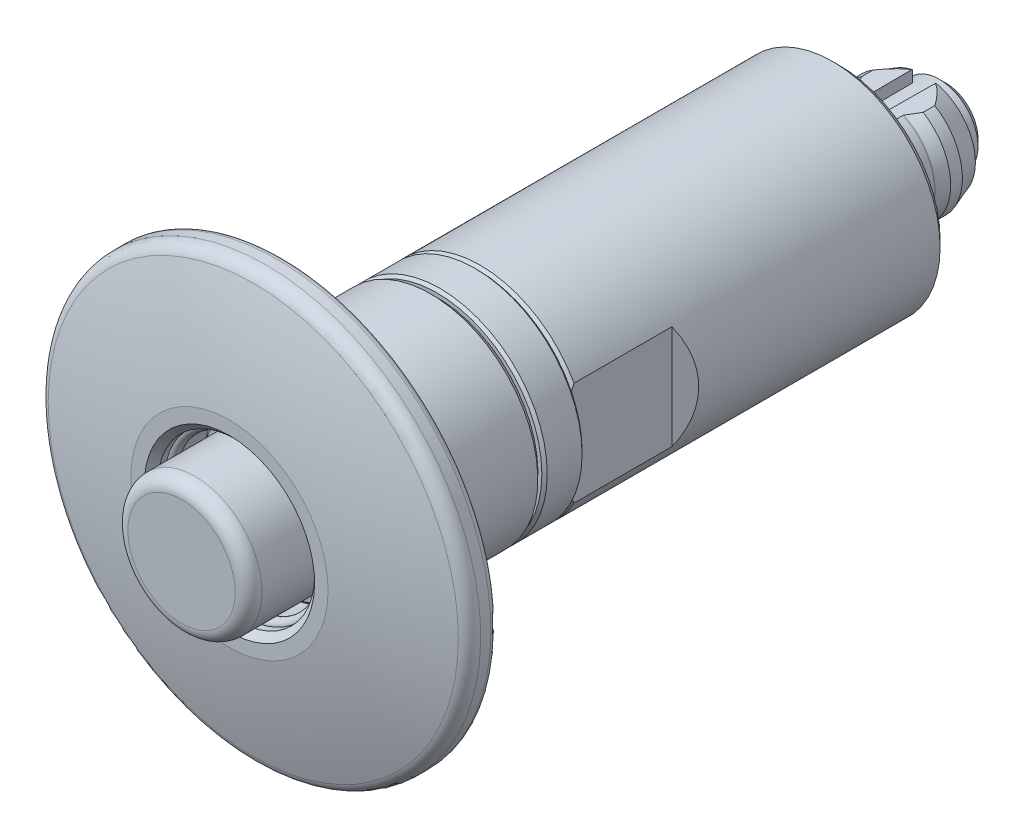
ISO-10303-21;
HEADER;
FILE_DESCRIPTION(('STEP AP214'),'2;1');
FILE_NAME('part.step','',(''),(''),'','','');
FILE_SCHEMA(('AUTOMOTIVE_DESIGN { 1 0 10303 214 1 1 1 1 }'));
ENDSEC;
DATA;
#1=APPLICATION_CONTEXT('core data for automotive mechanical design processes');
#2=APPLICATION_PROTOCOL_DEFINITION('international standard','automotive_design',2000,#1);
#3=PRODUCT_CONTEXT('',#1,'mechanical');
#4=PRODUCT('Part','Part','',(#3));
#5=PRODUCT_RELATED_PRODUCT_CATEGORY('part','',(#4));
#6=PRODUCT_DEFINITION_FORMATION('','',#4);
#7=PRODUCT_DEFINITION_CONTEXT('part definition',#1,'design');
#8=PRODUCT_DEFINITION('design','',#6,#7);
#9=PRODUCT_DEFINITION_SHAPE('','',#8);
#10=(LENGTH_UNIT() NAMED_UNIT(*) SI_UNIT(.MILLI.,.METRE.));
#11=(NAMED_UNIT(*) PLANE_ANGLE_UNIT() SI_UNIT($,.RADIAN.));
#12=(NAMED_UNIT(*) SI_UNIT($,.STERADIAN.) SOLID_ANGLE_UNIT());
#13=UNCERTAINTY_MEASURE_WITH_UNIT(LENGTH_MEASURE(1.E-05),#10,'distance_accuracy_value','');
#14=(GEOMETRIC_REPRESENTATION_CONTEXT(3) GLOBAL_UNCERTAINTY_ASSIGNED_CONTEXT((#13)) GLOBAL_UNIT_ASSIGNED_CONTEXT((#10,
#11,#12)) REPRESENTATION_CONTEXT('',''));
#15=CARTESIAN_POINT('',(0.,0.,0.));
#16=DIRECTION('',(0.,0.,1.));
#17=DIRECTION('',(1.,0.,0.));
#18=AXIS2_PLACEMENT_3D('',#15,#16,#17);
#19=CARTESIAN_POINT('',(0.,0.,49.0730839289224));
#20=DIRECTION('',(0.,0.,-1.));
#21=DIRECTION('',(0.,1.,0.));
#22=AXIS2_PLACEMENT_3D('',#19,#20,#21);
#23=PLANE('',#22);
#24=CARTESIAN_POINT('',(0.,0.,49.0730839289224));
#25=DIRECTION('',(0.,0.,-1.));
#26=DIRECTION('',(0.,1.,0.));
#27=AXIS2_PLACEMENT_3D('',#24,#25,#26);
#28=CIRCLE('',#27,4.);
#29=CARTESIAN_POINT('',(0.,4.,49.0730839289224));
#30=VERTEX_POINT('',#29);
#31=EDGE_CURVE('E345',#30,#30,#28,.F.);
#32=ORIENTED_EDGE('',*,*,#31,.T.);
#33=EDGE_LOOP('',(#32));
#34=FACE_BOUND('',#33,.T.);
#35=ADVANCED_FACE('F14',(#34),#23,.F.);
#36=CARTESIAN_POINT('',(0.,0.,48.0730839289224));
#37=DIRECTION('',(0.,0.,-1.));
#38=DIRECTION('',(0.,1.,0.));
#39=AXIS2_PLACEMENT_3D('',#36,#37,#38);
#40=TOROIDAL_SURFACE('',#39,4.,1.);
#41=CARTESIAN_POINT('',(0.,0.,48.0730839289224));
#42=DIRECTION('',(0.,0.,-1.));
#43=DIRECTION('',(0.,1.,0.));
#44=AXIS2_PLACEMENT_3D('',#41,#42,#43);
#45=CIRCLE('',#44,5.);
#46=CARTESIAN_POINT('',(0.,5.,48.0730839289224));
#47=VERTEX_POINT('',#46);
#48=EDGE_CURVE('E342',#47,#47,#45,.T.);
#49=ORIENTED_EDGE('',*,*,#48,.F.);
#50=EDGE_LOOP('',(#49));
#51=FACE_BOUND('',#50,.T.);
#52=ORIENTED_EDGE('',*,*,#31,.F.);
#53=EDGE_LOOP('',(#52));
#54=FACE_BOUND('',#53,.T.);
#55=ADVANCED_FACE('F247',(#51,#54),#40,.T.);
#56=CARTESIAN_POINT('',(0.,0.,49.0730839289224));
#57=DIRECTION('',(0.,0.,1.));
#58=DIRECTION('',(0.,-1.,0.));
#59=AXIS2_PLACEMENT_3D('',#56,#57,#58);
#60=CYLINDRICAL_SURFACE('',#59,5.);
#61=ORIENTED_EDGE('',*,*,#48,.T.);
#62=EDGE_LOOP('',(#61));
#63=FACE_BOUND('',#62,.T.);
#64=CARTESIAN_POINT('',(0.,0.,41.7730839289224));
#65=DIRECTION('',(0.,0.,-1.));
#66=DIRECTION('',(0.,1.,0.));
#67=AXIS2_PLACEMENT_3D('',#64,#65,#66);
#68=CIRCLE('',#67,5.);
#69=CARTESIAN_POINT('',(0.,5.,41.7730839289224));
#70=VERTEX_POINT('',#69);
#71=EDGE_CURVE('E339',#70,#70,#68,.T.);
#72=ORIENTED_EDGE('',*,*,#71,.F.);
#73=EDGE_LOOP('',(#72));
#74=FACE_BOUND('',#73,.T.);
#75=ADVANCED_FACE('F253',(#63,#74),#60,.T.);
#76=CARTESIAN_POINT('',(5.,0.,41.7730839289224));
#77=DIRECTION('',(0.,0.,-1.));
#78=DIRECTION('',(0.,1.,0.));
#79=AXIS2_PLACEMENT_3D('',#76,#77,#78);
#80=PLANE('',#79);
#81=CARTESIAN_POINT('',(0.,0.,41.7730839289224));
#82=DIRECTION('',(0.,0.,-1.));
#83=DIRECTION('',(0.,1.,0.));
#84=AXIS2_PLACEMENT_3D('',#81,#82,#83);
#85=CIRCLE('',#84,5.65);
#86=CARTESIAN_POINT('',(0.,5.65,41.7730839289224));
#87=VERTEX_POINT('',#86);
#88=EDGE_CURVE('E332',#87,#87,#85,.F.);
#89=ORIENTED_EDGE('',*,*,#88,.T.);
#90=EDGE_LOOP('',(#89));
#91=FACE_BOUND('',#90,.T.);
#92=ORIENTED_EDGE('',*,*,#71,.T.);
#93=EDGE_LOOP('',(#92));
#94=FACE_BOUND('',#93,.T.);
#95=ADVANCED_FACE('F390',(#91,#94),#80,.F.);
#96=CARTESIAN_POINT('',(-0.567155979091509,9.0514870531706,43.7));
#97=DIRECTION('',(-1.,0.,0.));
#98=DIRECTION('',(0.,-1.,0.));
#99=AXIS2_PLACEMENT_3D('',#96,#97,#98);
#100=PLANE('',#99);
#101=CARTESIAN_POINT('',(-0.567155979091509,6.1495096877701,43.8676653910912));
#102=CARTESIAN_POINT('',(-0.567155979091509,6.16256398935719,43.8858848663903));
#103=CARTESIAN_POINT('',(-0.567155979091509,6.17409255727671,43.9052171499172));
#104=CARTESIAN_POINT('',(-0.567155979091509,6.19375126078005,43.945558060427));
#105=CARTESIAN_POINT('',(-0.567155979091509,6.20187744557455,43.9665686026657));
#106=CARTESIAN_POINT('',(-0.567155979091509,6.21448095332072,44.0096508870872));
#107=CARTESIAN_POINT('',(-0.567155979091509,6.21895961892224,44.0317222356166));
#108=CARTESIAN_POINT('',(-0.567155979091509,6.22414019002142,44.0762979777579));
#109=CARTESIAN_POINT('',(-0.567155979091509,6.22484301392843,44.0988022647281));
#110=CARTESIAN_POINT('',(-0.567155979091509,6.22245608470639,44.143577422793));
#111=CARTESIAN_POINT('',(-0.567155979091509,6.21937159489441,44.1658485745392));
#112=CARTESIAN_POINT('',(-0.567155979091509,6.20950822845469,44.2095578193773));
#113=CARTESIAN_POINT('',(-0.567155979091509,6.20272922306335,44.230995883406));
#114=CARTESIAN_POINT('',(-0.567155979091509,6.18567057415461,44.2724378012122));
#115=CARTESIAN_POINT('',(-0.567155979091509,6.17538991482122,44.2924412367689));
#116=CARTESIAN_POINT('',(-0.567155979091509,6.15162473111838,44.3304442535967));
#117=CARTESIAN_POINT('',(-0.567155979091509,6.13814017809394,44.3484438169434));
#118=CARTESIAN_POINT('',(-0.567155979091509,6.1083134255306,44.3819810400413));
#119=CARTESIAN_POINT('',(-0.567155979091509,6.09196371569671,44.3975120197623));
#120=CARTESIAN_POINT('',(-0.567155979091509,6.05689816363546,44.425622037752));
#121=CARTESIAN_POINT('',(-0.567155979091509,6.03818227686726,44.4382010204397));
#122=CARTESIAN_POINT('',(-0.567155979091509,5.99883428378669,44.4601048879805));
#123=CARTESIAN_POINT('',(-0.567155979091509,5.97819468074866,44.4694163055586));
#124=CARTESIAN_POINT('',(-0.567155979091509,5.93564923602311,44.4844574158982));
#125=CARTESIAN_POINT('',(-0.567155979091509,5.91374336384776,44.4901870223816));
#126=CARTESIAN_POINT('',(-0.567155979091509,5.86919437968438,44.4979236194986));
#127=CARTESIAN_POINT('',(-0.567155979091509,5.84654869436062,44.4999157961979));
#128=CARTESIAN_POINT('',(-0.567155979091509,5.80124342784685,44.5000789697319));
#129=CARTESIAN_POINT('',(-0.567155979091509,5.77858384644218,44.4982499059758));
#130=CARTESIAN_POINT('',(-0.567155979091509,5.73384277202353,44.490813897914));
#131=CARTESIAN_POINT('',(-0.567155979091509,5.71176262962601,44.4851988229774));
#132=CARTESIAN_POINT('',(-0.567155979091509,5.66885938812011,44.4703386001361));
#133=CARTESIAN_POINT('',(-0.567155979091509,5.6480362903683,44.4610934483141));
#134=CARTESIAN_POINT('',(-0.567155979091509,5.60825895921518,44.4392394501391));
#135=CARTESIAN_POINT('',(-0.567155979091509,5.58930320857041,44.4266333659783));
#136=CARTESIAN_POINT('',(-0.567155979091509,5.55378727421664,44.3984065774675));
#137=CARTESIAN_POINT('',(-0.567155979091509,5.53722704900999,44.3827859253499));
#138=CARTESIAN_POINT('',(-0.567155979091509,5.50704071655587,44.3490342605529));
#139=CARTESIAN_POINT('',(-0.567155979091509,5.4934038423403,44.330912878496));
#140=CARTESIAN_POINT('',(-0.567155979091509,5.46938444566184,44.2926282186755));
#141=CARTESIAN_POINT('',(-0.567155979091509,5.45900182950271,44.2724649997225));
#142=CARTESIAN_POINT('',(-0.567155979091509,5.4418413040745,44.2307796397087));
#143=CARTESIAN_POINT('',(-0.567155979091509,5.43504523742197,44.2092649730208));
#144=CARTESIAN_POINT('',(-0.567155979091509,5.42517775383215,44.1653979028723));
#145=CARTESIAN_POINT('',(-0.567155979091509,5.42210624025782,44.1430455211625));
#146=CARTESIAN_POINT('',(-0.567155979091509,5.41978325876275,44.0982322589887));
#147=CARTESIAN_POINT('',(-0.567155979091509,5.4205167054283,44.0757721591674));
#148=CARTESIAN_POINT('',(-0.567155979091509,5.42574709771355,44.0312947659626));
#149=CARTESIAN_POINT('',(-0.567155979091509,5.43024401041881,44.0092774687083));
#150=CARTESIAN_POINT('',(-0.567155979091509,5.44286466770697,43.9663258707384));
#151=CARTESIAN_POINT('',(-0.567155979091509,5.45098578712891,43.9453907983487));
#152=CARTESIAN_POINT('',(-0.567155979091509,5.47061762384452,43.9051756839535));
#153=CARTESIAN_POINT('',(-0.567155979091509,5.48212837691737,43.8858956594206));
#154=CARTESIAN_POINT('',(-0.567155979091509,5.50824528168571,43.8494761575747));
#155=CARTESIAN_POINT('',(-0.567155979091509,5.5228602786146,43.8323430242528));
#156=CARTESIAN_POINT('',(-0.567155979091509,5.5547464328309,43.8007584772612));
#157=CARTESIAN_POINT('',(-0.567155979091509,5.57201766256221,43.7863071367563));
#158=CARTESIAN_POINT('',(-0.567155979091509,5.60881741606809,43.7604200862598));
#159=CARTESIAN_POINT('',(-0.567155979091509,5.62835669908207,43.7489996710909));
#160=CARTESIAN_POINT('',(-0.567155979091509,5.66906877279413,43.7295840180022));
#161=CARTESIAN_POINT('',(-0.567155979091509,5.69024160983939,43.7215888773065));
#162=CARTESIAN_POINT('',(-0.567155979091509,5.73372363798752,43.7092153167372));
#163=CARTESIAN_POINT('',(-0.567155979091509,5.75603756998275,43.7048535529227));
#164=CARTESIAN_POINT('',(-0.567155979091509,5.80108008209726,43.6999295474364));
#165=CARTESIAN_POINT('',(-0.567155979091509,5.82380865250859,43.6993672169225));
#166=CARTESIAN_POINT('',(-0.567155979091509,5.86908395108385,43.702061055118));
#167=CARTESIAN_POINT('',(-0.567155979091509,5.89163022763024,43.7053248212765));
#168=CARTESIAN_POINT('',(-0.567155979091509,5.93585987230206,43.7155963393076));
#169=CARTESIAN_POINT('',(-0.567155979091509,5.95754302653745,43.7226050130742));
#170=CARTESIAN_POINT('',(-0.567155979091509,5.99940722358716,43.7401659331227));
#171=CARTESIAN_POINT('',(-0.567155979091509,6.01958909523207,43.7507162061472));
#172=CARTESIAN_POINT('',(-0.567155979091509,6.05786806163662,43.775060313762));
#173=CARTESIAN_POINT('',(-0.567155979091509,6.07596766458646,43.7888501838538));
#174=CARTESIAN_POINT('',(-0.567155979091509,6.1033189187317,43.8136115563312));
#175=CARTESIAN_POINT('',(-0.567155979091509,6.11335937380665,43.8237265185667));
#176=CARTESIAN_POINT('',(-0.567155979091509,6.13230835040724,43.844966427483));
#177=CARTESIAN_POINT('',(-0.567155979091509,6.14121687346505,43.8560913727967));
#178=CARTESIAN_POINT('',(-0.567155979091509,6.1495096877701,43.8676653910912));
#179=B_SPLINE_CURVE_WITH_KNOTS('',3,(#101,#102,#103,#104,#105,#106,#107,#108,#109,#110,#111,
#112,#113,#114,#115,#116,#117,#118,#119,#120,#121,#122,#123,#124,#125,#126,#127,#128,#129,#130,
#131,#132,#133,#134,#135,#136,#137,#138,#139,#140,#141,#142,#143,#144,#145,#146,#147,#148,#149,
#150,#151,#152,#153,#154,#155,#156,#157,#158,#159,#160,#161,#162,#163,#164,#165,#166,#167,#168,
#169,#170,#171,#172,#173,#174,#175,#176,#177,#178),.UNSPECIFIED.,.T.,.F.,(4,2,2,2,2,2,2,2,2,2,2,
2,2,2,2,2,2,2,2,2,2,2,2,2,2,2,2,2,2,2,2,2,2,2,2,2,2,2,4),(0.,0.0671886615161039,
0.134455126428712,0.201696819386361,0.26892215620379,0.336054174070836,0.403188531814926,
0.470342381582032,0.537496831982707,0.604830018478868,0.672164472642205,0.739773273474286,
0.807383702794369,0.875261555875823,0.943140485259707,1.01116565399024,1.0791908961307,
1.14716040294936,1.21512873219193,1.28284225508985,1.35055382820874,1.41791923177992,
1.48528288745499,1.55237967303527,1.61947587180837,1.68652354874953,1.75357193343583,
1.82081399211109,1.88805788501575,1.95563491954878,2.02321387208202,2.09110094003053,
2.15898642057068,2.22700692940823,2.29504419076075,2.3630436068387,2.43096023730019,
2.47364224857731,2.51632420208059),.UNSPECIFIED.);
#180=CARTESIAN_POINT('',(-0.567155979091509,5.82244227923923,44.5));
#181=VERTEX_POINT('',#180);
#182=CARTESIAN_POINT('',(-0.567155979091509,5.82244227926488,43.7));
#183=VERTEX_POINT('',#182);
#184=EDGE_CURVE('E370',#181,#183,#179,.T.);
#185=ORIENTED_EDGE('',*,*,#184,.T.);
#186=DIRECTION('',(0.,0.,1.));
#187=VECTOR('',#186,1.);
#188=CARTESIAN_POINT('',(-0.567155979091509,5.8224422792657,41.5));
#189=LINE('',#188,#187);
#190=EDGE_CURVE('E367',#183,#181,#189,.T.);
#191=ORIENTED_EDGE('',*,*,#190,.T.);
#192=EDGE_LOOP('',(#185,#191));
#193=FACE_BOUND('',#192,.T.);
#194=ADVANCED_FACE('F387',(#193),#100,.F.);
#195=CARTESIAN_POINT('',(0.,0.,44.1));
#196=DIRECTION('',(0.,0.,-1.));
#197=DIRECTION('',(0.,1.,0.));
#198=AXIS2_PLACEMENT_3D('',#195,#196,#197);
#199=TOROIDAL_SURFACE('',#198,5.85,0.4);
#200=CARTESIAN_POINT('',(0.,0.,43.7));
#201=DIRECTION('',(0.,0.,1.));
#202=DIRECTION('',(0.,-1.,0.));
#203=AXIS2_PLACEMENT_3D('',#200,#201,#202);
#204=CIRCLE('',#203,5.85);
#205=CARTESIAN_POINT('',(0.567155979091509,5.8224422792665,43.7));
#206=VERTEX_POINT('',#205);
#207=EDGE_CURVE('E642',#183,#206,#204,.T.);
#208=ORIENTED_EDGE('',*,*,#207,.F.);
#209=ORIENTED_EDGE('',*,*,#184,.F.);
#210=CARTESIAN_POINT('',(0.,0.,44.5));
#211=DIRECTION('',(0.,0.,-1.));
#212=DIRECTION('',(0.,1.,0.));
#213=AXIS2_PLACEMENT_3D('',#210,#211,#212);
#214=CIRCLE('',#213,5.85);
#215=CARTESIAN_POINT('',(0.567155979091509,5.82244227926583,44.5));
#216=VERTEX_POINT('',#215);
#217=EDGE_CURVE('E641',#216,#181,#214,.T.);
#218=ORIENTED_EDGE('',*,*,#217,.F.);
#219=CARTESIAN_POINT('',(0.567155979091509,6.1495096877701,43.8676653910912));
#220=CARTESIAN_POINT('',(0.567155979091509,6.13638075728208,43.8493452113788));
#221=CARTESIAN_POINT('',(0.567155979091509,6.1216898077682,43.8321236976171));
#222=CARTESIAN_POINT('',(0.567155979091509,6.0896095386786,43.8003807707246));
#223=CARTESIAN_POINT('',(0.567155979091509,6.07221686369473,43.7858627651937));
#224=CARTESIAN_POINT('',(0.567155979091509,6.03525294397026,43.7599583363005));
#225=CARTESIAN_POINT('',(0.567155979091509,6.01568314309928,43.7485698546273));
#226=CARTESIAN_POINT('',(0.567155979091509,5.97491945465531,43.7292318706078));
#227=CARTESIAN_POINT('',(0.567155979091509,5.95372597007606,43.7212815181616));
#228=CARTESIAN_POINT('',(0.567155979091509,5.91024029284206,43.7090132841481));
#229=CARTESIAN_POINT('',(0.567155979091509,5.88794485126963,43.7047069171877));
#230=CARTESIAN_POINT('',(0.567155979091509,5.84294671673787,43.6998863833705));
#231=CARTESIAN_POINT('',(0.567155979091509,5.82024399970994,43.6993724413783));
#232=CARTESIAN_POINT('',(0.567155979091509,5.77500786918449,43.7021541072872));
#233=CARTESIAN_POINT('',(0.567155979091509,5.75247512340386,43.7054605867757));
#234=CARTESIAN_POINT('',(0.567155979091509,5.70828406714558,43.7158086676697));
#235=CARTESIAN_POINT('',(0.567155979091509,5.68662576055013,43.7228502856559));
#236=CARTESIAN_POINT('',(0.567155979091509,5.64479681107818,43.7404744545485));
#237=CARTESIAN_POINT('',(0.567155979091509,5.62462640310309,43.7510575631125));
#238=CARTESIAN_POINT('',(0.567155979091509,5.58635556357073,43.7754693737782));
#239=CARTESIAN_POINT('',(0.567155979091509,5.56825510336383,43.789298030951));
#240=CARTESIAN_POINT('',(0.567155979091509,5.53469750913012,43.819767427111));
#241=CARTESIAN_POINT('',(0.567155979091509,5.51923273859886,43.8363997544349));
#242=CARTESIAN_POINT('',(0.567155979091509,5.4913317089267,43.8720358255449));
#243=CARTESIAN_POINT('',(0.567155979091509,5.47889537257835,43.8910395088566));
#244=CARTESIAN_POINT('',(0.567155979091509,5.45747002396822,43.9307785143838));
#245=CARTESIAN_POINT('',(0.567155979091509,5.44846428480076,43.9515048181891));
#246=CARTESIAN_POINT('',(0.567155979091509,5.43407857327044,43.9941796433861));
#247=CARTESIAN_POINT('',(0.567155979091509,5.42869849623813,44.0161281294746));
#248=CARTESIAN_POINT('',(0.567155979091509,5.42173934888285,44.0605162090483));
#249=CARTESIAN_POINT('',(0.567155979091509,5.42014295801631,44.0829530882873));
#250=CARTESIAN_POINT('',(0.567155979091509,5.42074744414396,44.1277754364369));
#251=CARTESIAN_POINT('',(0.567155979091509,5.42294826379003,44.1501609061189));
#252=CARTESIAN_POINT('',(0.567155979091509,5.43107460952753,44.1942019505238));
#253=CARTESIAN_POINT('',(0.567155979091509,5.4369932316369,44.2158587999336));
#254=CARTESIAN_POINT('',(0.567155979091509,5.4523757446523,44.2578742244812));
#255=CARTESIAN_POINT('',(0.567155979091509,5.46183965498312,44.278232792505));
#256=CARTESIAN_POINT('',(0.567155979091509,5.4840590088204,44.3171167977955));
#257=CARTESIAN_POINT('',(0.567155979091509,5.49682056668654,44.3356387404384));
#258=CARTESIAN_POINT('',(0.567155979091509,5.52525894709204,44.3702897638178));
#259=CARTESIAN_POINT('',(0.567155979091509,5.54093583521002,44.3864187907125));
#260=CARTESIAN_POINT('',(0.567155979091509,5.57483566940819,44.4159057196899));
#261=CARTESIAN_POINT('',(0.567155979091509,5.59306992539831,44.4292506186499));
#262=CARTESIAN_POINT('',(0.567155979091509,5.6315110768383,44.4527075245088));
#263=CARTESIAN_POINT('',(0.567155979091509,5.65171802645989,44.4628194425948));
#264=CARTESIAN_POINT('',(0.567155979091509,5.69363822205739,44.4795740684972));
#265=CARTESIAN_POINT('',(0.567155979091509,5.71535840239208,44.4861994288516));
#266=CARTESIAN_POINT('',(0.567155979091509,5.75960131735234,44.4957218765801));
#267=CARTESIAN_POINT('',(0.567155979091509,5.78212406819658,44.4986188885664));
#268=CARTESIAN_POINT('',(0.567155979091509,5.82740466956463,44.5006068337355));
#269=CARTESIAN_POINT('',(0.567155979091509,5.85016302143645,44.4996863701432));
#270=CARTESIAN_POINT('',(0.567155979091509,5.89520233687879,44.4940375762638));
#271=CARTESIAN_POINT('',(0.567155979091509,5.91748329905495,44.4893092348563));
#272=CARTESIAN_POINT('',(0.567155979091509,5.96093162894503,44.4761750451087));
#273=CARTESIAN_POINT('',(0.567155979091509,5.98209910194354,44.4677695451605));
#274=CARTESIAN_POINT('',(0.567155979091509,6.02271676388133,44.4475142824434));
#275=CARTESIAN_POINT('',(0.567155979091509,6.04216697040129,44.4356645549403));
#276=CARTESIAN_POINT('',(0.567155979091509,6.07873734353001,44.4088912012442));
#277=CARTESIAN_POINT('',(0.567155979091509,6.0958639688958,44.3939763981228));
#278=CARTESIAN_POINT('',(0.567155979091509,6.12735712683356,44.361472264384));
#279=CARTESIAN_POINT('',(0.567155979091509,6.1417237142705,44.3438829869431));
#280=CARTESIAN_POINT('',(0.567155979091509,6.16722517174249,44.3066076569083));
#281=CARTESIAN_POINT('',(0.567155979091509,6.17837324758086,44.2869306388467));
#282=CARTESIAN_POINT('',(0.567155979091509,6.19719263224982,44.2459797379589));
#283=CARTESIAN_POINT('',(0.567155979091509,6.20486415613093,44.2247059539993));
#284=CARTESIAN_POINT('',(0.567155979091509,6.21648422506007,44.1812541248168));
#285=CARTESIAN_POINT('',(0.567155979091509,6.22044718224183,44.1590799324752));
#286=CARTESIAN_POINT('',(0.567155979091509,6.22458648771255,44.1143748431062));
#287=CARTESIAN_POINT('',(0.567155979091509,6.22476194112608,44.0918438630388));
#288=CARTESIAN_POINT('',(0.567155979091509,6.22132290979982,44.0471099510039));
#289=CARTESIAN_POINT('',(0.567155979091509,6.21771419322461,44.0249065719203));
#290=CARTESIAN_POINT('',(0.567155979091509,6.20682182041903,43.9814401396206));
#291=CARTESIAN_POINT('',(0.567155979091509,6.19954262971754,43.9601759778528));
#292=CARTESIAN_POINT('',(0.567155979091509,6.18497526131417,43.927010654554));
#293=CARTESIAN_POINT('',(0.567155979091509,6.17874939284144,43.9146316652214));
#294=CARTESIAN_POINT('',(0.567155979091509,6.16504868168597,43.8905854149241));
#295=CARTESIAN_POINT('',(0.567155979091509,6.15757384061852,43.8789181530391));
#296=CARTESIAN_POINT('',(0.567155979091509,6.1495096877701,43.8676653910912));
#297=B_SPLINE_CURVE_WITH_KNOTS('',3,(#219,#220,#221,#222,#223,#224,#225,#226,#227,#228,#229,
#230,#231,#232,#233,#234,#235,#236,#237,#238,#239,#240,#241,#242,#243,#244,#245,#246,#247,#248,
#249,#250,#251,#252,#253,#254,#255,#256,#257,#258,#259,#260,#261,#262,#263,#264,#265,#266,#267,
#268,#269,#270,#271,#272,#273,#274,#275,#276,#277,#278,#279,#280,#281,#282,#283,#284,#285,#286,
#287,#288,#289,#290,#291,#292,#293,#294,#295,#296),.UNSPECIFIED.,.T.,.F.,(4,2,2,2,2,2,2,2,2,2,2,
2,2,2,2,2,2,2,2,2,2,2,2,2,2,2,2,2,2,2,2,2,2,2,2,2,2,2,4),(0.,0.0675656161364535,
0.135215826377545,0.202821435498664,0.270410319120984,0.33821198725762,0.406017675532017,
0.47401679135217,0.542016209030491,0.610026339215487,0.678035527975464,0.745844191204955,
0.813651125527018,0.881123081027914,0.948593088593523,1.01575363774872,1.08291317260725,
1.14994835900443,1.21698391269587,1.28414466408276,1.3513069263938,1.41877617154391,
1.48624726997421,1.55405097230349,1.621856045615,1.68986369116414,1.75787153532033,
1.82587293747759,1.89387364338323,1.96168127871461,2.02948756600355,2.09701155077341,
2.16453135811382,2.23178766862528,2.29905986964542,2.36622967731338,2.43331796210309,
2.47481868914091,2.51631936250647),.UNSPECIFIED.);
#298=EDGE_CURVE('E378',#206,#216,#297,.T.);
#299=ORIENTED_EDGE('',*,*,#298,.F.);
#300=EDGE_LOOP('',(#208,#209,#218,#299));
#301=FACE_BOUND('',#300,.T.);
#302=ADVANCED_FACE('F384',(#301),#199,.T.);
#303=CARTESIAN_POINT('',(0.567155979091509,9.0514870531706,43.7));
#304=DIRECTION('',(1.,0.,0.));
#305=DIRECTION('',(0.,1.,0.));
#306=AXIS2_PLACEMENT_3D('',#303,#304,#305);
#307=PLANE('',#306);
#308=ORIENTED_EDGE('',*,*,#298,.T.);
#309=DIRECTION('',(0.,0.,1.));
#310=VECTOR('',#309,1.);
#311=CARTESIAN_POINT('',(0.567155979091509,5.8224422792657,41.5));
#312=LINE('',#311,#310);
#313=EDGE_CURVE('E369',#216,#206,#312,.F.);
#314=ORIENTED_EDGE('',*,*,#313,.T.);
#315=EDGE_LOOP('',(#308,#314));
#316=FACE_BOUND('',#315,.T.);
#317=ADVANCED_FACE('F262',(#316),#307,.F.);
#318=CARTESIAN_POINT('',(0.,0.,41.7730839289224));
#319=DIRECTION('',(0.,0.,-1.));
#320=DIRECTION('',(0.,1.,0.));
#321=AXIS2_PLACEMENT_3D('',#318,#319,#320);
#322=CONICAL_SURFACE('',#321,5.65,0.785398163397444);
#323=CARTESIAN_POINT('',(0.,0.,41.5730839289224));
#324=DIRECTION('',(0.,0.,-1.));
#325=DIRECTION('',(0.,1.,0.));
#326=AXIS2_PLACEMENT_3D('',#323,#324,#325);
#327=CIRCLE('',#326,5.85);
#328=CARTESIAN_POINT('',(0.,5.85,41.5730839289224));
#329=VERTEX_POINT('',#328);
#330=EDGE_CURVE('E336',#329,#329,#327,.T.);
#331=ORIENTED_EDGE('',*,*,#330,.F.);
#332=EDGE_LOOP('',(#331));
#333=FACE_BOUND('',#332,.T.);
#334=ORIENTED_EDGE('',*,*,#88,.F.);
#335=EDGE_LOOP('',(#334));
#336=FACE_BOUND('',#335,.T.);
#337=ADVANCED_FACE('F207',(#333,#336),#322,.T.);
#338=CARTESIAN_POINT('',(0.,0.,41.5));
#339=DIRECTION('',(0.,0.,1.));
#340=DIRECTION('',(0.,-1.,0.));
#341=AXIS2_PLACEMENT_3D('',#338,#339,#340);
#342=CYLINDRICAL_SURFACE('',#341,5.85);
#343=CARTESIAN_POINT('',(0.,0.,45.));
#344=DIRECTION('',(0.,0.,-1.));
#345=DIRECTION('',(0.,1.,0.));
#346=AXIS2_PLACEMENT_3D('',#343,#344,#345);
#347=CIRCLE('',#346,5.85);
#348=CARTESIAN_POINT('',(0.,5.85,45.));
#349=VERTEX_POINT('',#348);
#350=EDGE_CURVE('E674',#349,#349,#347,.F.);
#351=ORIENTED_EDGE('',*,*,#350,.T.);
#352=EDGE_LOOP('',(#351));
#353=FACE_BOUND('',#352,.T.);
#354=ORIENTED_EDGE('',*,*,#330,.T.);
#355=EDGE_LOOP('',(#354));
#356=FACE_BOUND('',#355,.T.);
#357=ORIENTED_EDGE('',*,*,#313,.F.);
#358=ORIENTED_EDGE('',*,*,#217,.T.);
#359=ORIENTED_EDGE('',*,*,#190,.F.);
#360=ORIENTED_EDGE('',*,*,#207,.T.);
#361=EDGE_LOOP('',(#357,#358,#359,#360));
#362=FACE_BOUND('',#361,.T.);
#363=ADVANCED_FACE('F202',(#353,#356,#362),#342,.F.);
#364=CARTESIAN_POINT('',(0.,0.,45.));
#365=DIRECTION('',(0.,0.,1.));
#366=DIRECTION('',(0.,-1.,0.));
#367=AXIS2_PLACEMENT_3D('',#364,#365,#366);
#368=CONICAL_SURFACE('',#367,5.85,0.78539816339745);
#369=CARTESIAN_POINT('',(0.,0.,45.5));
#370=DIRECTION('',(0.,0.,-1.));
#371=DIRECTION('',(0.,1.,0.));
#372=AXIS2_PLACEMENT_3D('',#369,#370,#371);
#373=CIRCLE('',#372,6.35);
#374=CARTESIAN_POINT('',(0.,6.35,45.5));
#375=VERTEX_POINT('',#374);
#376=EDGE_CURVE('E178',#375,#375,#373,.T.);
#377=ORIENTED_EDGE('',*,*,#376,.F.);
#378=EDGE_LOOP('',(#377));
#379=FACE_BOUND('',#378,.T.);
#380=ORIENTED_EDGE('',*,*,#350,.F.);
#381=EDGE_LOOP('',(#380));
#382=FACE_BOUND('',#381,.T.);
#383=ADVANCED_FACE('F206',(#379,#382),#368,.F.);
#384=CARTESIAN_POINT('',(0.,0.,45.5));
#385=DIRECTION('',(0.,0.,-1.));
#386=DIRECTION('',(0.,1.,0.));
#387=AXIS2_PLACEMENT_3D('',#384,#385,#386);
#388=PLANE('',#387);
#389=ORIENTED_EDGE('',*,*,#376,.T.);
#390=EDGE_LOOP('',(#389));
#391=FACE_BOUND('',#390,.T.);
#392=CARTESIAN_POINT('',(0.,0.,45.5));
#393=DIRECTION('',(0.,0.,1.));
#394=DIRECTION('',(0.,-1.,0.));
#395=AXIS2_PLACEMENT_3D('',#392,#393,#394);
#396=CIRCLE('',#395,7.35465362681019);
#397=CARTESIAN_POINT('',(7.35465362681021,0.,45.5));
#398=VERTEX_POINT('',#397);
#399=EDGE_CURVE('E653',#398,#398,#396,.T.);
#400=ORIENTED_EDGE('',*,*,#399,.T.);
#401=EDGE_LOOP('',(#400));
#402=FACE_BOUND('',#401,.T.);
#403=ADVANCED_FACE('F209',(#391,#402),#388,.F.);
#404=CARTESIAN_POINT('',(0.,0.,-5.97726750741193));
#405=DIRECTION('',(0.,0.,1.));
#406=DIRECTION('',(1.,0.,0.));
#407=AXIS2_PLACEMENT_3D('',#404,#405,#406);
#408=SPHERICAL_SURFACE('',#407,52.);
#409=CARTESIAN_POINT('',(0.,0.,43.7227321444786));
#410=DIRECTION('',(0.,0.,-1.));
#411=DIRECTION('',(0.,1.,0.));
#412=AXIS2_PLACEMENT_3D('',#409,#410,#411);
#413=CIRCLE('',#412,15.2941176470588);
#414=CARTESIAN_POINT('',(15.2941176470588,0.,43.7227321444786));
#415=VERTEX_POINT('',#414);
#416=EDGE_CURVE('E668',#415,#415,#413,.F.);
#417=CARTESIAN_POINT('',(15.2941176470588,0.,43.7227321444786));
#418=CARTESIAN_POINT('',(15.213033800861,0.,43.7476839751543));
#419=CARTESIAN_POINT('',(15.1318888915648,0.,43.7724373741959));
#420=CARTESIAN_POINT('',(14.9694788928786,0.,43.82154672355));
#421=CARTESIAN_POINT('',(14.8882138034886,0.,43.8459026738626));
#422=CARTESIAN_POINT('',(14.7255653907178,0.,43.8942165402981));
#423=CARTESIAN_POINT('',(14.644182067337,0.,43.918174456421));
#424=CARTESIAN_POINT('',(14.4812991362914,0.,43.9656916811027));
#425=CARTESIAN_POINT('',(14.3997995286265,0.,43.9892509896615));
#426=CARTESIAN_POINT('',(14.2366859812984,0.,44.0359704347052));
#427=CARTESIAN_POINT('',(14.1550720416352,0.,44.0591305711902));
#428=CARTESIAN_POINT('',(13.9917317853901,0.,44.1050511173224));
#429=CARTESIAN_POINT('',(13.9100054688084,0.,44.1278115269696));
#430=CARTESIAN_POINT('',(13.7464424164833,0.,44.1729320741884));
#431=CARTESIAN_POINT('',(13.6646056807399,0.,44.19529221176));
#432=CARTESIAN_POINT('',(13.5008237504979,0.,44.2396116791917));
#433=CARTESIAN_POINT('',(13.4188785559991,0.,44.2615710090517));
#434=CARTESIAN_POINT('',(13.2548816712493,0.,44.305088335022));
#435=CARTESIAN_POINT('',(13.1728299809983,0.,44.3266463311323));
#436=CARTESIAN_POINT('',(13.0086220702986,0.,44.3693604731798));
#437=CARTESIAN_POINT('',(12.9264658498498,0.,44.3905166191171));
#438=CARTESIAN_POINT('',(12.7620508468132,0.,44.4324265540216));
#439=CARTESIAN_POINT('',(12.6797920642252,0.,44.4531803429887));
#440=CARTESIAN_POINT('',(12.5151739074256,0.,44.4942850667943));
#441=CARTESIAN_POINT('',(12.4328145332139,0.,44.5146360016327));
#442=CARTESIAN_POINT('',(12.2679971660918,0.,44.5549345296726));
#443=CARTESIAN_POINT('',(12.1855391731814,0.,44.5748821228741));
#444=CARTESIAN_POINT('',(12.0205265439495,0.,44.614373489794));
#445=CARTESIAN_POINT('',(11.937971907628,0.,44.6339172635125));
#446=CARTESIAN_POINT('',(11.7727679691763,0.,44.6726005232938));
#447=CARTESIAN_POINT('',(11.6901186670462,0.,44.6917400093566));
#448=CARTESIAN_POINT('',(11.5247273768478,0.,44.7296142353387));
#449=CARTESIAN_POINT('',(11.4419853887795,0.,44.7483489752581));
#450=CARTESIAN_POINT('',(11.2764107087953,0.,44.7854132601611));
#451=CARTESIAN_POINT('',(11.1935780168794,0.,44.8037428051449));
#452=CARTESIAN_POINT('',(11.0278239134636,0.,44.8399962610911));
#453=CARTESIAN_POINT('',(10.9449025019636,0.,44.8579201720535));
#454=CARTESIAN_POINT('',(10.7789729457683,0.,44.8933619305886));
#455=CARTESIAN_POINT('',(10.6959648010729,0.,44.9108797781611));
#456=CARTESIAN_POINT('',(10.5298637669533,0.,44.9455089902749));
#457=CARTESIAN_POINT('',(10.446770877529,0.,44.9626203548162));
#458=CARTESIAN_POINT('',(10.280502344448,0.,44.9964361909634));
#459=CARTESIAN_POINT('',(10.1973267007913,0.,45.0131406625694));
#460=CARTESIAN_POINT('',(10.0308946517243,0.,45.046142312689));
#461=CARTESIAN_POINT('',(9.9476382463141,0.,45.0624394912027));
#462=CARTESIAN_POINT('',(9.78104666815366,0.,45.0946261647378));
#463=CARTESIAN_POINT('',(9.69771149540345,0.,45.1105156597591));
#464=CARTESIAN_POINT('',(9.53096437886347,0.,45.1418865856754));
#465=CARTESIAN_POINT('',(9.44755243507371,0.,45.1573680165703));
#466=CARTESIAN_POINT('',(9.28065377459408,0.,45.1879224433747));
#467=CARTESIAN_POINT('',(9.19716705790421,0.,45.2029954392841));
#468=CARTESIAN_POINT('',(9.03012085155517,0.,45.2327326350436));
#469=CARTESIAN_POINT('',(8.94656136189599,0.,45.2473968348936));
#470=CARTESIAN_POINT('',(8.77937161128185,0.,45.2763160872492));
#471=CARTESIAN_POINT('',(8.69574135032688,0.,45.2905711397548));
#472=CARTESIAN_POINT('',(8.52841206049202,0.,45.3186717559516));
#473=CARTESIAN_POINT('',(8.44471303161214,0.,45.3325173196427));
#474=CARTESIAN_POINT('',(8.27724821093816,0.,45.3597986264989));
#475=CARTESIAN_POINT('',(8.19348241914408,0.,45.3732343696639));
#476=CARTESIAN_POINT('',(8.0258860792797,0.,45.399695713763));
#477=CARTESIAN_POINT('',(7.94205553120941,0.,45.4127213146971));
#478=CARTESIAN_POINT('',(7.77433168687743,0.,45.4383620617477));
#479=CARTESIAN_POINT('',(7.69043839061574,0.,45.4509772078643));
#480=CARTESIAN_POINT('',(7.52259105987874,0.,45.4757967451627));
#481=CARTESIAN_POINT('',(7.43863702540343,0.,45.4880011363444));
#482=CARTESIAN_POINT('',(7.35465362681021,0.,45.5));
#483=B_SPLINE_CURVE_WITH_KNOTS('',3,(#417,#418,#419,#420,#421,#422,#423,#424,#425,#426,#427,
#428,#429,#430,#431,#432,#433,#434,#435,#436,#437,#438,#439,#440,#441,#442,#443,#444,#445,#446,
#447,#448,#449,#450,#451,#452,#453,#454,#455,#456,#457,#458,#459,#460,#461,#462,#463,#464,#465,
#466,#467,#468,#469,#470,#471,#472,#473,#474,#475,#476,#477,#478,#479,#480,#481,#482),
.UNSPECIFIED.,.F.,.F.,(4,2,2,2,2,2,2,2,2,2,2,2,2,2,2,2,2,2,2,2,2,2,2,2,2,2,2,2,2,2,2,2,4),(0.,
0.254508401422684,0.509016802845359,0.763525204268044,1.01803360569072,1.2725420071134,
1.52705040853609,1.78155880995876,2.03606721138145,2.29057561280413,2.54508401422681,
2.79959241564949,3.05410081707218,3.30860921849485,3.56311761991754,3.81762602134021,
4.07213442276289,4.32664282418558,4.58115122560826,4.83565962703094,5.09016802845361,
5.3446764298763,5.59918483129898,5.85369323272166,6.10820163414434,6.36271003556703,
6.6172184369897,6.87172683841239,7.12623523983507,7.38074364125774,7.63525204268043,
7.8897604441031,8.14426884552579),.UNSPECIFIED.);
#484=EDGE_CURVE('BSEAM212',#415,#398,#483,.T.);
#485=ORIENTED_EDGE('',*,*,#416,.T.);
#486=ORIENTED_EDGE('',*,*,#399,.F.);
#487=ORIENTED_EDGE('',*,*,#484,.T.);
#488=ORIENTED_EDGE('',*,*,#484,.F.);
#489=EDGE_LOOP('',(#485,#487,#486,#488));
#490=FACE_BOUND('',#489,.T.);
#491=ADVANCED_FACE('F212',(#490),#408,.T.);
#492=CARTESIAN_POINT('',(0.,0.,42.7669629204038));
#493=DIRECTION('',(0.,0.,-1.));
#494=DIRECTION('',(0.,1.,0.));
#495=AXIS2_PLACEMENT_3D('',#492,#493,#494);
#496=TOROIDAL_SURFACE('',#495,15.,1.);
#497=CARTESIAN_POINT('',(0.,0.,42.7669629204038));
#498=DIRECTION('',(0.,0.,-1.));
#499=DIRECTION('',(0.,1.,0.));
#500=AXIS2_PLACEMENT_3D('',#497,#498,#499);
#501=CIRCLE('',#500,16.);
#502=CARTESIAN_POINT('',(0.,16.,42.7669629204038));
#503=VERTEX_POINT('',#502);
#504=EDGE_CURVE('E671',#503,#503,#501,.T.);
#505=ORIENTED_EDGE('',*,*,#504,.F.);
#506=EDGE_LOOP('',(#505));
#507=FACE_BOUND('',#506,.T.);
#508=ORIENTED_EDGE('',*,*,#416,.F.);
#509=EDGE_LOOP('',(#508));
#510=FACE_BOUND('',#509,.T.);
#511=ADVANCED_FACE('F216',(#507,#510),#496,.T.);
#512=CARTESIAN_POINT('',(0.,0.,44.2941358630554));
#513=DIRECTION('',(0.,0.,1.));
#514=DIRECTION('',(0.,-1.,0.));
#515=AXIS2_PLACEMENT_3D('',#512,#513,#514);
#516=CYLINDRICAL_SURFACE('',#515,16.);
#517=ORIENTED_EDGE('',*,*,#504,.T.);
#518=EDGE_LOOP('',(#517));
#519=FACE_BOUND('',#518,.T.);
#520=CARTESIAN_POINT('',(0.,0.,42.));
#521=DIRECTION('',(0.,0.,1.));
#522=DIRECTION('',(0.,-1.,0.));
#523=AXIS2_PLACEMENT_3D('',#520,#521,#522);
#524=CIRCLE('',#523,16.);
#525=CARTESIAN_POINT('',(0.,-16.,42.));
#526=VERTEX_POINT('',#525);
#527=EDGE_CURVE('E662',#526,#526,#524,.T.);
#528=ORIENTED_EDGE('',*,*,#527,.T.);
#529=EDGE_LOOP('',(#528));
#530=FACE_BOUND('',#529,.T.);
#531=ADVANCED_FACE('F218',(#519,#530),#516,.T.);
#532=CARTESIAN_POINT('',(0.,0.,42.));
#533=DIRECTION('',(0.,0.,1.));
#534=DIRECTION('',(0.,-1.,0.));
#535=AXIS2_PLACEMENT_3D('',#532,#533,#534);
#536=TOROIDAL_SURFACE('',#535,15.5,0.5);
#537=CARTESIAN_POINT('',(0.,0.,41.5));
#538=DIRECTION('',(0.,0.,1.));
#539=DIRECTION('',(0.,-1.,0.));
#540=AXIS2_PLACEMENT_3D('',#537,#538,#539);
#541=CIRCLE('',#540,15.5);
#542=CARTESIAN_POINT('',(0.,-15.5,41.5));
#543=VERTEX_POINT('',#542);
#544=EDGE_CURVE('E665',#543,#543,#541,.F.);
#545=ORIENTED_EDGE('',*,*,#544,.F.);
#546=EDGE_LOOP('',(#545));
#547=FACE_BOUND('',#546,.T.);
#548=ORIENTED_EDGE('',*,*,#527,.F.);
#549=EDGE_LOOP('',(#548));
#550=FACE_BOUND('',#549,.T.);
#551=ADVANCED_FACE('F221',(#547,#550),#536,.T.);
#552=CARTESIAN_POINT('',(8.,0.,41.5));
#553=DIRECTION('',(0.,0.,1.));
#554=DIRECTION('',(0.,-1.,0.));
#555=AXIS2_PLACEMENT_3D('',#552,#553,#554);
#556=PLANE('',#555);
#557=ORIENTED_EDGE('',*,*,#544,.T.);
#558=EDGE_LOOP('',(#557));
#559=FACE_BOUND('',#558,.T.);
#560=CARTESIAN_POINT('',(0.,0.,41.5));
#561=DIRECTION('',(0.,0.,1.));
#562=DIRECTION('',(0.,-1.,0.));
#563=AXIS2_PLACEMENT_3D('',#560,#561,#562);
#564=CIRCLE('',#563,11.);
#565=CARTESIAN_POINT('',(0.,-11.,41.5));
#566=VERTEX_POINT('',#565);
#567=EDGE_CURVE('E656',#566,#566,#564,.T.);
#568=ORIENTED_EDGE('',*,*,#567,.T.);
#569=EDGE_LOOP('',(#568));
#570=FACE_BOUND('',#569,.T.);
#571=ADVANCED_FACE('F223',(#559,#570),#556,.F.);
#572=CARTESIAN_POINT('',(0.,0.,38.5));
#573=DIRECTION('',(0.,0.,1.));
#574=DIRECTION('',(0.,-1.,0.));
#575=AXIS2_PLACEMENT_3D('',#572,#573,#574);
#576=TOROIDAL_SURFACE('',#575,11.,3.);
#577=CARTESIAN_POINT('',(0.,0.,38.5));
#578=DIRECTION('',(0.,0.,1.));
#579=DIRECTION('',(0.,-1.,0.));
#580=AXIS2_PLACEMENT_3D('',#577,#578,#579);
#581=CIRCLE('',#580,8.);
#582=CARTESIAN_POINT('',(0.,-8.,38.5));
#583=VERTEX_POINT('',#582);
#584=EDGE_CURVE('E659',#583,#583,#581,.F.);
#585=ORIENTED_EDGE('',*,*,#584,.F.);
#586=EDGE_LOOP('',(#585));
#587=FACE_BOUND('',#586,.T.);
#588=ORIENTED_EDGE('',*,*,#567,.F.);
#589=EDGE_LOOP('',(#588));
#590=FACE_BOUND('',#589,.T.);
#591=ADVANCED_FACE('F226',(#587,#590),#576,.F.);
#592=CARTESIAN_POINT('',(-16.,-8.,34.5));
#593=DIRECTION('',(0.,0.70710678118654,0.707106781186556));
#594=DIRECTION('',(0.,-0.707106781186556,0.70710678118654));
#595=AXIS2_PLACEMENT_3D('',#592,#593,#594);
#596=PLANE('',#595);
#597=CARTESIAN_POINT('',(0.,0.,26.5));
#598=DIRECTION('',(0.,0.70710678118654,0.707106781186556));
#599=DIRECTION('',(0.,-0.707106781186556,0.70710678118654));
#600=AXIS2_PLACEMENT_3D('',#597,#598,#599);
#601=ELLIPSE('',#600,11.3137084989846,8.);
#602=CARTESIAN_POINT('',(-3.87298334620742,-7.,33.5));
#603=VERTEX_POINT('',#602);
#604=CARTESIAN_POINT('',(3.87298334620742,-7.,33.5));
#605=VERTEX_POINT('',#604);
#606=EDGE_CURVE('E177',#603,#605,#601,.T.);
#607=ORIENTED_EDGE('',*,*,#606,.F.);
#608=DIRECTION('',(1.,0.,0.));
#609=VECTOR('',#608,1.);
#610=CARTESIAN_POINT('',(-16.,-7.,33.5));
#611=LINE('',#610,#609);
#612=EDGE_CURVE('E651',#603,#605,#611,.T.);
#613=ORIENTED_EDGE('',*,*,#612,.T.);
#614=EDGE_LOOP('',(#607,#613));
#615=FACE_BOUND('',#614,.T.);
#616=ADVANCED_FACE('F200',(#615),#596,.F.);
#617=CARTESIAN_POINT('',(0.,0.,44.2941358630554));
#618=DIRECTION('',(0.,0.,1.));
#619=DIRECTION('',(0.,-1.,0.));
#620=AXIS2_PLACEMENT_3D('',#617,#618,#619);
#621=CYLINDRICAL_SURFACE('',#620,8.);
#622=ORIENTED_EDGE('',*,*,#584,.T.);
#623=EDGE_LOOP('',(#622));
#624=FACE_BOUND('',#623,.T.);
#625=DIRECTION('',(0.,0.,1.));
#626=VECTOR('',#625,1.);
#627=CARTESIAN_POINT('',(3.87298334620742,-7.,44.2941358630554));
#628=LINE('',#627,#626);
#629=CARTESIAN_POINT('',(3.87298334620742,-7.,30.5));
#630=VERTEX_POINT('',#629);
#631=EDGE_CURVE('E161',#605,#630,#628,.F.);
#632=ORIENTED_EDGE('',*,*,#631,.T.);
#633=CARTESIAN_POINT('',(0.,0.,30.5));
#634=DIRECTION('',(0.,0.,1.));
#635=DIRECTION('',(0.,-1.,0.));
#636=AXIS2_PLACEMENT_3D('',#633,#634,#635);
#637=CIRCLE('',#636,8.);
#638=CARTESIAN_POINT('',(-3.87298334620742,-7.,30.5));
#639=VERTEX_POINT('',#638);
#640=EDGE_CURVE('E170',#630,#639,#637,.T.);
#641=ORIENTED_EDGE('',*,*,#640,.T.);
#642=DIRECTION('',(0.,0.,1.));
#643=VECTOR('',#642,1.);
#644=CARTESIAN_POINT('',(-3.87298334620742,-7.,44.2941358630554));
#645=LINE('',#644,#643);
#646=EDGE_CURVE('E180',#639,#603,#645,.T.);
#647=ORIENTED_EDGE('',*,*,#646,.T.);
#648=ORIENTED_EDGE('',*,*,#606,.T.);
#649=EDGE_LOOP('',(#632,#641,#647,#648));
#650=FACE_BOUND('',#649,.T.);
#651=ADVANCED_FACE('F175',(#624,#650),#621,.T.);
#652=CARTESIAN_POINT('',(0.,0.,30.5));
#653=DIRECTION('',(0.,0.,1.));
#654=DIRECTION('',(0.,-1.,0.));
#655=AXIS2_PLACEMENT_3D('',#652,#653,#654);
#656=CONICAL_SURFACE('',#655,8.,0.785398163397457);
#657=CARTESIAN_POINT('',(2.69258240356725,-7.,30.));
#658=CARTESIAN_POINT('',(2.79321704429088,-7.,30.0361304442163));
#659=CARTESIAN_POINT('',(2.89328440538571,-7.,30.0738186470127));
#660=CARTESIAN_POINT('',(3.09222676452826,-7.,30.1520259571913));
#661=CARTESIAN_POINT('',(3.19110255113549,-7.,30.1925430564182));
#662=CARTESIAN_POINT('',(3.38773807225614,-7.,30.2761719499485));
#663=CARTESIAN_POINT('',(3.48549788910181,-7.,30.3192835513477));
#664=CARTESIAN_POINT('',(3.68000814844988,-7.,30.4079055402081));
#665=CARTESIAN_POINT('',(3.77675783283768,-7.,30.4534175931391));
#666=CARTESIAN_POINT('',(3.87298334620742,-7.,30.5));
#667=B_SPLINE_CURVE_WITH_KNOTS('',3,(#657,#658,#659,#660,#661,#662,#663,#664,#665,#666),
.UNSPECIFIED.,.F.,.F.,(4,2,2,2,4),(0.,0.320748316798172,0.641271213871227,0.961770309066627,
1.28249477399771),.UNSPECIFIED.);
#668=CARTESIAN_POINT('',(2.69258240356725,-7.,30.));
#669=VERTEX_POINT('',#668);
#670=EDGE_CURVE('E156',#669,#630,#667,.T.);
#671=ORIENTED_EDGE('',*,*,#670,.F.);
#672=CARTESIAN_POINT('',(0.,0.,30.));
#673=DIRECTION('',(0.,0.,1.));
#674=DIRECTION('',(0.,-1.,0.));
#675=AXIS2_PLACEMENT_3D('',#672,#673,#674);
#676=CIRCLE('',#675,7.5);
#677=CARTESIAN_POINT('',(-2.69258240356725,-7.,30.));
#678=VERTEX_POINT('',#677);
#679=EDGE_CURVE('E351',#678,#669,#676,.F.);
#680=ORIENTED_EDGE('',*,*,#679,.F.);
#681=CARTESIAN_POINT('',(-3.87298334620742,-7.,30.5));
#682=CARTESIAN_POINT('',(-3.77675783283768,-7.,30.4534175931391));
#683=CARTESIAN_POINT('',(-3.68000814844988,-7.,30.4079055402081));
#684=CARTESIAN_POINT('',(-3.48549788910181,-7.,30.3192835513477));
#685=CARTESIAN_POINT('',(-3.38773807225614,-7.,30.2761719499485));
#686=CARTESIAN_POINT('',(-3.19110255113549,-7.,30.1925430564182));
#687=CARTESIAN_POINT('',(-3.09222676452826,-7.,30.1520259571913));
#688=CARTESIAN_POINT('',(-2.89328440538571,-7.,30.0738186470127));
#689=CARTESIAN_POINT('',(-2.79321704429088,-7.,30.0361304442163));
#690=CARTESIAN_POINT('',(-2.69258240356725,-7.,30.));
#691=B_SPLINE_CURVE_WITH_KNOTS('',3,(#681,#682,#683,#684,#685,#686,#687,#688,#689,#690),
.UNSPECIFIED.,.F.,.F.,(4,2,2,2,4),(0.,0.320724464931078,0.641223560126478,0.961746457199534,
1.28249477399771),.UNSPECIFIED.);
#692=EDGE_CURVE('E169',#639,#678,#691,.T.);
#693=ORIENTED_EDGE('',*,*,#692,.F.);
#694=ORIENTED_EDGE('',*,*,#640,.F.);
#695=EDGE_LOOP('',(#671,#680,#693,#694));
#696=FACE_BOUND('',#695,.T.);
#697=ADVANCED_FACE('F16',(#696),#656,.T.);
#698=CARTESIAN_POINT('',(-16.,-7.,33.5));
#699=DIRECTION('',(0.,1.,0.));
#700=DIRECTION('',(-1.,0.,0.));
#701=AXIS2_PLACEMENT_3D('',#698,#699,#700);
#702=PLANE('',#701);
#703=ORIENTED_EDGE('',*,*,#646,.F.);
#704=ORIENTED_EDGE('',*,*,#692,.T.);
#705=DIRECTION('',(1.,0.,0.));
#706=VECTOR('',#705,1.);
#707=CARTESIAN_POINT('',(-16.,-7.,30.));
#708=LINE('',#707,#706);
#709=EDGE_CURVE('E164',#678,#669,#708,.T.);
#710=ORIENTED_EDGE('',*,*,#709,.T.);
#711=ORIENTED_EDGE('',*,*,#670,.T.);
#712=ORIENTED_EDGE('',*,*,#631,.F.);
#713=ORIENTED_EDGE('',*,*,#612,.F.);
#714=EDGE_LOOP('',(#703,#704,#710,#711,#712,#713));
#715=FACE_BOUND('',#714,.T.);
#716=ADVANCED_FACE('F159',(#715),#702,.F.);
#717=CARTESIAN_POINT('',(8.,0.,30.));
#718=DIRECTION('',(0.,0.,-1.));
#719=DIRECTION('',(1.,0.,0.));
#720=AXIS2_PLACEMENT_3D('',#717,#718,#719);
#721=PLANE('',#720);
#722=ORIENTED_EDGE('',*,*,#709,.F.);
#723=ORIENTED_EDGE('',*,*,#679,.T.);
#724=EDGE_LOOP('',(#722,#723));
#725=FACE_BOUND('',#724,.T.);
#726=CARTESIAN_POINT('',(0.,0.,30.));
#727=DIRECTION('',(0.,0.,-1.));
#728=DIRECTION('',(1.,0.,0.));
#729=AXIS2_PLACEMENT_3D('',#726,#727,#728);
#730=CIRCLE('',#729,7.8);
#731=CARTESIAN_POINT('',(7.8,0.,30.));
#732=VERTEX_POINT('',#731);
#733=EDGE_CURVE('E354',#732,#732,#730,.F.);
#734=ORIENTED_EDGE('',*,*,#733,.T.);
#735=EDGE_LOOP('',(#734));
#736=FACE_BOUND('',#735,.T.);
#737=ADVANCED_FACE('F199',(#725,#736),#721,.F.);
#738=CARTESIAN_POINT('',(0.,0.,30.));
#739=DIRECTION('',(0.,0.,-1.));
#740=DIRECTION('',(1.,0.,0.));
#741=AXIS2_PLACEMENT_3D('',#738,#739,#740);
#742=CONICAL_SURFACE('',#741,7.8,0.785398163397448);
#743=CARTESIAN_POINT('',(0.,0.,29.8));
#744=DIRECTION('',(0.,0.,-1.));
#745=DIRECTION('',(1.,0.,0.));
#746=AXIS2_PLACEMENT_3D('',#743,#744,#745);
#747=CIRCLE('',#746,8.);
#748=CARTESIAN_POINT('',(8.,0.,29.8));
#749=VERTEX_POINT('',#748);
#750=EDGE_CURVE('E335',#749,#749,#747,.T.);
#751=ORIENTED_EDGE('',*,*,#750,.F.);
#752=EDGE_LOOP('',(#751));
#753=FACE_BOUND('',#752,.T.);
#754=ORIENTED_EDGE('',*,*,#733,.F.);
#755=EDGE_LOOP('',(#754));
#756=FACE_BOUND('',#755,.T.);
#757=ADVANCED_FACE('F795',(#753,#756),#742,.T.);
#758=CARTESIAN_POINT('',(0.,0.,30.));
#759=DIRECTION('',(0.,0.,1.));
#760=DIRECTION('',(-1.,0.,0.));
#761=AXIS2_PLACEMENT_3D('',#758,#759,#760);
#762=CYLINDRICAL_SURFACE('',#761,8.);
#763=CARTESIAN_POINT('',(0.,0.,27.2));
#764=DIRECTION('',(0.,0.,1.));
#765=DIRECTION('',(-1.,0.,0.));
#766=AXIS2_PLACEMENT_3D('',#763,#764,#765);
#767=CIRCLE('',#766,8.);
#768=CARTESIAN_POINT('',(-8.,0.,27.2));
#769=VERTEX_POINT('',#768);
#770=EDGE_CURVE('E362',#769,#769,#767,.T.);
#771=ORIENTED_EDGE('',*,*,#770,.T.);
#772=EDGE_LOOP('',(#771));
#773=FACE_BOUND('',#772,.T.);
#774=ORIENTED_EDGE('',*,*,#750,.T.);
#775=EDGE_LOOP('',(#774));
#776=FACE_BOUND('',#775,.T.);
#777=ADVANCED_FACE('F804',(#773,#776),#762,.T.);
#778=CARTESIAN_POINT('',(6.,0.,27.));
#779=DIRECTION('',(0.,0.,1.));
#780=DIRECTION('',(-1.,0.,0.));
#781=AXIS2_PLACEMENT_3D('',#778,#779,#780);
#782=PLANE('',#781);
#783=DIRECTION('',(0.,-1.,0.));
#784=VECTOR('',#783,1.);
#785=CARTESIAN_POINT('',(7.,0.,27.));
#786=LINE('',#785,#784);
#787=CARTESIAN_POINT('',(7.,3.44093010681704,27.));
#788=VERTEX_POINT('',#787);
#789=CARTESIAN_POINT('',(7.,-3.44093010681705,27.));
#790=VERTEX_POINT('',#789);
#791=EDGE_CURVE('E352',#788,#790,#786,.T.);
#792=ORIENTED_EDGE('',*,*,#791,.F.);
#793=CARTESIAN_POINT('',(0.,0.,27.));
#794=DIRECTION('',(0.,0.,1.));
#795=DIRECTION('',(-1.,0.,0.));
#796=AXIS2_PLACEMENT_3D('',#793,#794,#795);
#797=CIRCLE('',#796,7.8);
#798=EDGE_CURVE('E360',#788,#790,#797,.F.);
#799=ORIENTED_EDGE('',*,*,#798,.T.);
#800=EDGE_LOOP('',(#792,#799));
#801=FACE_BOUND('',#800,.T.);
#802=ADVANCED_FACE('F814',(#801),#782,.F.);
#803=CARTESIAN_POINT('',(0.,0.,27.2));
#804=DIRECTION('',(0.,0.,1.));
#805=DIRECTION('',(-1.,0.,0.));
#806=AXIS2_PLACEMENT_3D('',#803,#804,#805);
#807=CONICAL_SURFACE('',#806,8.,0.785398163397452);
#808=CARTESIAN_POINT('',(-7.,3.44093010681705,27.));
#809=VERTEX_POINT('',#808);
#810=EDGE_CURVE('E357',#809,#788,#797,.F.);
#811=ORIENTED_EDGE('',*,*,#810,.F.);
#812=CARTESIAN_POINT('',(-7.,-3.44093010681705,27.));
#813=VERTEX_POINT('',#812);
#814=EDGE_CURVE('E361',#813,#809,#797,.F.);
#815=ORIENTED_EDGE('',*,*,#814,.F.);
#816=EDGE_CURVE('E1175',#790,#813,#797,.F.);
#817=ORIENTED_EDGE('',*,*,#816,.F.);
#818=ORIENTED_EDGE('',*,*,#798,.F.);
#819=EDGE_LOOP('',(#811,#815,#817,#818));
#820=FACE_BOUND('',#819,.T.);
#821=ORIENTED_EDGE('',*,*,#770,.F.);
#822=EDGE_LOOP('',(#821));
#823=FACE_BOUND('',#822,.T.);
#824=ADVANCED_FACE('F824',(#820,#823),#807,.T.);
#825=DIRECTION('',(0.,1.,0.));
#826=VECTOR('',#825,1.);
#827=CARTESIAN_POINT('',(-7.,0.,27.));
#828=LINE('',#827,#826);
#829=EDGE_CURVE('E348',#813,#809,#828,.T.);
#830=ORIENTED_EDGE('',*,*,#829,.F.);
#831=ORIENTED_EDGE('',*,*,#814,.T.);
#832=EDGE_LOOP('',(#830,#831));
#833=FACE_BOUND('',#832,.T.);
#834=ADVANCED_FACE('F826',(#833),#782,.F.);
#835=CARTESIAN_POINT('',(0.,0.,27.));
#836=DIRECTION('',(0.,0.,-1.));
#837=DIRECTION('',(-1.,0.,0.));
#838=AXIS2_PLACEMENT_3D('',#835,#836,#837);
#839=CONICAL_SURFACE('',#838,7.8,0.785398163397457);
#840=CARTESIAN_POINT('',(-7.,-16.1491002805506,17.1990500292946));
#841=CARTESIAN_POINT('',(-7.,-15.910664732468,17.4178136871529));
#842=CARTESIAN_POINT('',(-7.,-15.6718519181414,17.6361660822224));
#843=CARTESIAN_POINT('',(-7.,-15.1933621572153,18.0719257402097));
#844=CARTESIAN_POINT('',(-7.,-14.9536852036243,18.2893329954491));
#845=CARTESIAN_POINT('',(-7.,-14.2330890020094,18.9400476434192));
#846=CARTESIAN_POINT('',(-7.,-13.7507140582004,19.3717471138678));
#847=CARTESIAN_POINT('',(-7.,-12.7777912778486,20.2322266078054));
#848=CARTESIAN_POINT('',(-7.,-12.2872107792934,20.6609697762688));
#849=CARTESIAN_POINT('',(-7.,-11.299301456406,21.5105129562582));
#850=CARTESIAN_POINT('',(-7.,-10.8019734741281,21.9313139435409));
#851=CARTESIAN_POINT('',(-7.,-9.88466573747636,22.6900013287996));
#852=CARTESIAN_POINT('',(-7.,-9.4661579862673,23.0296584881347));
#853=CARTESIAN_POINT('',(-7.,-8.83196826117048,23.5311476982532));
#854=CARTESIAN_POINT('',(-7.,-8.61946769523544,23.6970025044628));
#855=CARTESIAN_POINT('',(-7.,-8.19199476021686,24.0254914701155));
#856=CARTESIAN_POINT('',(-7.,-7.97702245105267,24.1881257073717));
#857=CARTESIAN_POINT('',(-7.,-7.54444306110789,24.5093411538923));
#858=CARTESIAN_POINT('',(-7.,-7.32683924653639,24.6679267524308));
#859=CARTESIAN_POINT('',(-7.,-6.88828405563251,24.9803883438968));
#860=CARTESIAN_POINT('',(-7.,-6.66733285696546,25.1342645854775));
#861=CARTESIAN_POINT('',(-7.,-6.22159117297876,25.436169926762));
#862=CARTESIAN_POINT('',(-7.,-5.99680232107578,25.5842014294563));
#863=CARTESIAN_POINT('',(-7.,-5.54265672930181,25.873055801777));
#864=CARTESIAN_POINT('',(-7.,-5.31330055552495,26.0138795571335));
#865=CARTESIAN_POINT('',(-7.,-4.85210415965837,26.2848069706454));
#866=CARTESIAN_POINT('',(-7.,-4.62032934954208,26.4150213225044));
#867=CARTESIAN_POINT('',(-7.,-4.15078506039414,26.6643113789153));
#868=CARTESIAN_POINT('',(-7.,-3.91301496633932,26.7833859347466));
#869=CARTESIAN_POINT('',(-7.,-3.43111528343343,27.0072418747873));
#870=CARTESIAN_POINT('',(-7.,-3.18699350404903,27.1120399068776));
#871=CARTESIAN_POINT('',(-7.,-2.69178793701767,27.3037554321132));
#872=CARTESIAN_POINT('',(-7.,-2.44070617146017,27.390678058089));
#873=CARTESIAN_POINT('',(-7.,-1.98425724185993,27.5267542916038));
#874=CARTESIAN_POINT('',(-7.,-1.78011684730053,27.5799992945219));
#875=CARTESIAN_POINT('',(-7.,-1.36827090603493,27.6703545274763));
#876=CARTESIAN_POINT('',(-7.,-1.16056585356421,27.707466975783));
#877=CARTESIAN_POINT('',(-7.,-0.743261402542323,27.7636775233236));
#878=CARTESIAN_POINT('',(-7.,-0.533668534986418,27.7828234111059));
#879=CARTESIAN_POINT('',(-7.,-0.113600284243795,27.8022218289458));
#880=CARTESIAN_POINT('',(-7.,0.0968750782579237,27.8024747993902));
#881=CARTESIAN_POINT('',(-7.,0.516997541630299,27.7840731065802));
#882=CARTESIAN_POINT('',(-7.,0.726644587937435,27.765417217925));
#883=CARTESIAN_POINT('',(-7.,1.14355176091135,27.7102196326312));
#884=CARTESIAN_POINT('',(-7.,1.3508116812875,27.6736764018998));
#885=CARTESIAN_POINT('',(-7.,1.76239710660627,27.584354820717));
#886=CARTESIAN_POINT('',(-7.,1.96671214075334,27.5315288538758));
#887=CARTESIAN_POINT('',(-7.,2.37113295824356,27.4118378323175));
#888=CARTESIAN_POINT('',(-7.,2.57123876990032,27.3449728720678));
#889=CARTESIAN_POINT('',(-7.,3.01233559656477,27.1827175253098));
#890=CARTESIAN_POINT('',(-7.,3.25220684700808,27.0843008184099));
#891=CARTESIAN_POINT('',(-7.,3.7256075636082,26.8731324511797));
#892=CARTESIAN_POINT('',(-7.,3.95913387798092,26.760373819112));
#893=CARTESIAN_POINT('',(-7.,4.42075343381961,26.5232996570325));
#894=CARTESIAN_POINT('',(-7.,4.64883566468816,26.3989628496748));
#895=CARTESIAN_POINT('',(-7.,5.09977176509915,26.1412790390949));
#896=CARTESIAN_POINT('',(-7.,5.32262642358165,26.0079334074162));
#897=CARTESIAN_POINT('',(-7.,5.76638893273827,25.7324401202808));
#898=CARTESIAN_POINT('',(-7.,5.9872443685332,25.5902084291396));
#899=CARTESIAN_POINT('',(-7.,6.42500287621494,25.2997974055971));
#900=CARTESIAN_POINT('',(-7.,6.64190583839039,25.1516179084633));
#901=CARTESIAN_POINT('',(-7.,7.07208180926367,24.8505899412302));
#902=CARTESIAN_POINT('',(-7.,7.28535855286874,24.6977467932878));
#903=CARTESIAN_POINT('',(-7.,7.7090102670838,24.3880850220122));
#904=CARTESIAN_POINT('',(-7.,7.91938513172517,24.2312662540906));
#905=CARTESIAN_POINT('',(-7.,8.48693321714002,23.8012199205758));
#906=CARTESIAN_POINT('',(-7.,8.84169261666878,23.5248077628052));
#907=CARTESIAN_POINT('',(-7.,9.5455128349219,22.9648195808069));
#908=CARTESIAN_POINT('',(-7.,9.89457333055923,22.6812431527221));
#909=CARTESIAN_POINT('',(-7.,10.5883827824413,22.1084466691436));
#910=CARTESIAN_POINT('',(-7.,10.9331289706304,21.819223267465));
#911=CARTESIAN_POINT('',(-7.,11.6189940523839,21.2365070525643));
#912=CARTESIAN_POINT('',(-7.,11.9601128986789,20.9430141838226));
#913=CARTESIAN_POINT('',(-7.,12.6250404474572,20.3651192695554));
#914=CARTESIAN_POINT('',(-7.,12.9489712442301,20.080857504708));
#915=CARTESIAN_POINT('',(-7.,13.5945927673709,19.5097974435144));
#916=CARTESIAN_POINT('',(-7.,13.9162834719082,19.2229991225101));
#917=CARTESIAN_POINT('',(-7.,14.5574026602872,18.6476642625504));
#918=CARTESIAN_POINT('',(-7.,14.8768334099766,18.3591302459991));
#919=CARTESIAN_POINT('',(-7.,15.5140949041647,17.7803179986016));
#920=CARTESIAN_POINT('',(-7.,15.8319256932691,17.4900398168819));
#921=CARTESIAN_POINT('',(-7.,16.1491002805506,17.1990500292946));
#922=B_SPLINE_CURVE_WITH_KNOTS('',3,(#840,#841,#842,#843,#844,#845,#846,#847,#848,#849,#850,
#851,#852,#853,#854,#855,#856,#857,#858,#859,#860,#861,#862,#863,#864,#865,#866,#867,#868,#869,
#870,#871,#872,#873,#874,#875,#876,#877,#878,#879,#880,#881,#882,#883,#884,#885,#886,#887,#888,
#889,#890,#891,#892,#893,#894,#895,#896,#897,#898,#899,#900,#901,#902,#903,#904,#905,#906,#907,
#908,#909,#910,#911,#912,#913,#914,#915,#916,#917,#918,#919,#920,#921),.UNSPECIFIED.,.F.,.F.,(4,
2,2,2,2,2,2,2,2,2,2,2,2,2,2,2,2,2,2,2,2,2,2,2,2,2,2,2,2,2,2,2,2,2,2,2,2,2,2,2,4),(0.,
0.970762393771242,1.94153265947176,3.88352000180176,5.83804798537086,7.79233425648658,
9.40917550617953,10.2178408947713,11.0264867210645,11.8342150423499,12.6419006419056,
13.4492506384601,14.2565011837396,15.0538067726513,15.8511944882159,16.647644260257,
17.4438650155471,18.076215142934,18.7084782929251,19.3390549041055,19.9696168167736,
20.6002195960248,21.2308764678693,21.8633953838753,22.4959100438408,23.2731299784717,
24.0507291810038,24.8297867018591,25.6087258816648,26.3966837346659,27.184663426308,
27.9717752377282,28.7589157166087,30.1079698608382,31.4571002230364,32.8070558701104,
34.1570290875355,35.4499260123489,36.7428355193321,38.034180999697,39.3254902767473),.UNSPECIFIED.);
#923=CARTESIAN_POINT('',(-7.,-3.87298334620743,26.8));
#924=VERTEX_POINT('',#923);
#925=EDGE_CURVE('E287',#924,#813,#922,.T.);
#926=ORIENTED_EDGE('',*,*,#925,.F.);
#927=CARTESIAN_POINT('',(0.,0.,26.8));
#928=DIRECTION('',(0.,0.,1.));
#929=DIRECTION('',(1.,0.,0.));
#930=AXIS2_PLACEMENT_3D('',#927,#928,#929);
#931=CIRCLE('',#930,8.);
#932=CARTESIAN_POINT('',(7.,-3.87298334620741,26.8));
#933=VERTEX_POINT('',#932);
#934=EDGE_CURVE('E309',#933,#924,#931,.F.);
#935=ORIENTED_EDGE('',*,*,#934,.F.);
#936=CARTESIAN_POINT('',(7.,16.1491002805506,17.1990500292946));
#937=CARTESIAN_POINT('',(7.,15.910664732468,17.4178136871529));
#938=CARTESIAN_POINT('',(7.,15.6718519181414,17.6361660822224));
#939=CARTESIAN_POINT('',(7.,15.1933621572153,18.0719257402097));
#940=CARTESIAN_POINT('',(7.,14.9536852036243,18.2893329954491));
#941=CARTESIAN_POINT('',(7.,14.2330890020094,18.9400476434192));
#942=CARTESIAN_POINT('',(7.,13.7507140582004,19.3717471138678));
#943=CARTESIAN_POINT('',(7.,12.7777912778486,20.2322266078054));
#944=CARTESIAN_POINT('',(7.,12.2872107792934,20.6609697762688));
#945=CARTESIAN_POINT('',(7.,11.299301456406,21.5105129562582));
#946=CARTESIAN_POINT('',(7.,10.8019734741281,21.9313139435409));
#947=CARTESIAN_POINT('',(7.,9.88466573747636,22.6900013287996));
#948=CARTESIAN_POINT('',(7.,9.46615798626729,23.0296584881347));
#949=CARTESIAN_POINT('',(7.,8.83196826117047,23.5311476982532));
#950=CARTESIAN_POINT('',(7.,8.61946769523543,23.6970025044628));
#951=CARTESIAN_POINT('',(7.,8.19199476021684,24.0254914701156));
#952=CARTESIAN_POINT('',(7.,7.97702245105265,24.1881257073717));
#953=CARTESIAN_POINT('',(7.,7.54444306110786,24.5093411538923));
#954=CARTESIAN_POINT('',(7.,7.32683924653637,24.6679267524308));
#955=CARTESIAN_POINT('',(7.,6.88828405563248,24.9803883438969));
#956=CARTESIAN_POINT('',(7.,6.66733285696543,25.1342645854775));
#957=CARTESIAN_POINT('',(7.,6.22159117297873,25.436169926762));
#958=CARTESIAN_POINT('',(7.,5.99680232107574,25.5842014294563));
#959=CARTESIAN_POINT('',(7.,5.54265672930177,25.873055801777));
#960=CARTESIAN_POINT('',(7.,5.31330055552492,26.0138795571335));
#961=CARTESIAN_POINT('',(7.,4.85210415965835,26.2848069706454));
#962=CARTESIAN_POINT('',(7.,4.62032934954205,26.4150213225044));
#963=CARTESIAN_POINT('',(7.,4.1507850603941,26.6643113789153));
#964=CARTESIAN_POINT('',(7.,3.91301496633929,26.7833859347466));
#965=CARTESIAN_POINT('',(7.,3.43111528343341,27.0072418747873));
#966=CARTESIAN_POINT('',(7.,3.18699350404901,27.1120399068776));
#967=CARTESIAN_POINT('',(7.,2.69178793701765,27.3037554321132));
#968=CARTESIAN_POINT('',(7.,2.44070617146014,27.390678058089));
#969=CARTESIAN_POINT('',(7.,1.98425724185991,27.5267542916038));
#970=CARTESIAN_POINT('',(7.,1.78011684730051,27.5799992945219));
#971=CARTESIAN_POINT('',(7.,1.36827090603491,27.6703545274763));
#972=CARTESIAN_POINT('',(7.,1.16056585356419,27.707466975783));
#973=CARTESIAN_POINT('',(7.,0.743261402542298,27.7636775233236));
#974=CARTESIAN_POINT('',(7.,0.533668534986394,27.7828234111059));
#975=CARTESIAN_POINT('',(7.,0.113600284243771,27.8022218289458));
#976=CARTESIAN_POINT('',(7.,-0.0968750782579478,27.8024747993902));
#977=CARTESIAN_POINT('',(7.,-0.516997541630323,27.7840731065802));
#978=CARTESIAN_POINT('',(7.,-0.726644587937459,27.765417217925));
#979=CARTESIAN_POINT('',(7.,-1.14355176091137,27.7102196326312));
#980=CARTESIAN_POINT('',(7.,-1.35081168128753,27.6736764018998));
#981=CARTESIAN_POINT('',(7.,-1.76239710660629,27.584354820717));
#982=CARTESIAN_POINT('',(7.,-1.96671214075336,27.5315288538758));
#983=CARTESIAN_POINT('',(7.,-2.37113295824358,27.4118378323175));
#984=CARTESIAN_POINT('',(7.,-2.57123876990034,27.3449728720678));
#985=CARTESIAN_POINT('',(7.,-3.01233559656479,27.1827175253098));
#986=CARTESIAN_POINT('',(7.,-3.2522068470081,27.0843008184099));
#987=CARTESIAN_POINT('',(7.,-3.72560756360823,26.8731324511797));
#988=CARTESIAN_POINT('',(7.,-3.95913387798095,26.760373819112));
#989=CARTESIAN_POINT('',(7.,-4.42075343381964,26.5232996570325));
#990=CARTESIAN_POINT('',(7.,-4.64883566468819,26.3989628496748));
#991=CARTESIAN_POINT('',(7.,-5.09977176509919,26.1412790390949));
#992=CARTESIAN_POINT('',(7.,-5.32262642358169,26.0079334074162));
#993=CARTESIAN_POINT('',(7.,-5.76638893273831,25.7324401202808));
#994=CARTESIAN_POINT('',(7.,-5.98724436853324,25.5902084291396));
#995=CARTESIAN_POINT('',(7.,-6.42500287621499,25.2997974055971));
#996=CARTESIAN_POINT('',(7.,-6.64190583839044,25.1516179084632));
#997=CARTESIAN_POINT('',(7.,-7.07208180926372,24.8505899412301));
#998=CARTESIAN_POINT('',(7.,-7.2853585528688,24.6977467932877));
#999=CARTESIAN_POINT('',(7.,-7.70901026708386,24.3880850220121));
#1000=CARTESIAN_POINT('',(7.,-7.91938513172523,24.2312662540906));
#1001=CARTESIAN_POINT('',(7.,-8.48693321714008,23.8012199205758));
#1002=CARTESIAN_POINT('',(7.,-8.84169261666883,23.5248077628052));
#1003=CARTESIAN_POINT('',(7.,-9.54551283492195,22.9648195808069));
#1004=CARTESIAN_POINT('',(7.,-9.89457333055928,22.6812431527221));
#1005=CARTESIAN_POINT('',(7.,-10.5883827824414,22.1084466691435));
#1006=CARTESIAN_POINT('',(7.,-10.9331289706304,21.819223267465));
#1007=CARTESIAN_POINT('',(7.,-11.618994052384,21.2365070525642));
#1008=CARTESIAN_POINT('',(7.,-11.960112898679,20.9430141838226));
#1009=CARTESIAN_POINT('',(7.,-12.6250404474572,20.3651192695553));
#1010=CARTESIAN_POINT('',(7.,-12.9489712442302,20.080857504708));
#1011=CARTESIAN_POINT('',(7.,-13.5945927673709,19.5097974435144));
#1012=CARTESIAN_POINT('',(7.,-13.9162834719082,19.2229991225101));
#1013=CARTESIAN_POINT('',(7.,-14.5574026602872,18.6476642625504));
#1014=CARTESIAN_POINT('',(7.,-14.8768334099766,18.3591302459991));
#1015=CARTESIAN_POINT('',(7.,-15.5140949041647,17.7803179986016));
#1016=CARTESIAN_POINT('',(7.,-15.8319256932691,17.4900398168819));
#1017=CARTESIAN_POINT('',(7.,-16.1491002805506,17.1990500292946));
#1018=B_SPLINE_CURVE_WITH_KNOTS('',3,(#936,#937,#938,#939,#940,#941,#942,#943,#944,#945,#946,
#947,#948,#949,#950,#951,#952,#953,#954,#955,#956,#957,#958,#959,#960,#961,#962,#963,#964,#965,
#966,#967,#968,#969,#970,#971,#972,#973,#974,#975,#976,#977,#978,#979,#980,#981,#982,#983,#984,
#985,#986,#987,#988,#989,#990,#991,#992,#993,#994,#995,#996,#997,#998,#999,#1000,#1001,#1002,
#1003,#1004,#1005,#1006,#1007,#1008,#1009,#1010,#1011,#1012,#1013,#1014,#1015,#1016,#1017),
.UNSPECIFIED.,.F.,.F.,(4,2,2,2,2,2,2,2,2,2,2,2,2,2,2,2,2,2,2,2,2,2,2,2,2,2,2,2,2,2,2,2,2,2,2,2,
2,2,2,2,4),(0.,0.970762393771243,1.94153265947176,3.88352000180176,5.83804798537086,
7.79233425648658,9.40917550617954,10.2178408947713,11.0264867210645,11.83421504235,
12.6419006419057,13.4492506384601,14.2565011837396,15.0538067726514,15.8511944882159,
16.647644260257,17.4438650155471,18.076215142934,18.7084782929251,19.3390549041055,
19.9696168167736,20.6002195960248,21.2308764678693,21.8633953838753,22.4959100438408,
23.2731299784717,24.0507291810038,24.8297867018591,25.6087258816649,26.396683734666,
27.184663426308,27.9717752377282,28.7589157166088,30.1079698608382,31.4571002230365,
32.8070558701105,34.1570290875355,35.4499260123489,36.7428355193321,38.034180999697,
39.3254902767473),.UNSPECIFIED.);
#1019=EDGE_CURVE('E302',#790,#933,#1018,.T.);
#1020=ORIENTED_EDGE('',*,*,#1019,.F.);
#1021=ORIENTED_EDGE('',*,*,#816,.T.);
#1022=EDGE_LOOP('',(#926,#935,#1020,#1021));
#1023=FACE_BOUND('',#1022,.T.);
#1024=ADVANCED_FACE('F297',(#1023),#839,.T.);
#1025=CARTESIAN_POINT('',(7.,-8.,19.5));
#1026=DIRECTION('',(-0.707106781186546,0.,-0.70710678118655));
#1027=DIRECTION('',(-0.707106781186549,0.,0.707106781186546));
#1028=AXIS2_PLACEMENT_3D('',#1025,#1026,#1027);
#1029=PLANE('',#1028);
#1030=CARTESIAN_POINT('',(0.,0.,26.5));
#1031=DIRECTION('',(-0.707106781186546,0.,-0.70710678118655));
#1032=DIRECTION('',(0.707106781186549,0.,-0.707106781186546));
#1033=AXIS2_PLACEMENT_3D('',#1030,#1031,#1032);
#1034=ELLIPSE('',#1033,11.3137084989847,8.);
#1035=CARTESIAN_POINT('',(7.,3.8729833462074,19.5));
#1036=VERTEX_POINT('',#1035);
#1037=CARTESIAN_POINT('',(7.,-3.87298334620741,19.5));
#1038=VERTEX_POINT('',#1037);
#1039=EDGE_CURVE('E288',#1036,#1038,#1034,.T.);
#1040=ORIENTED_EDGE('',*,*,#1039,.F.);
#1041=DIRECTION('',(0.,1.,0.));
#1042=VECTOR('',#1041,1.);
#1043=CARTESIAN_POINT('',(7.,-8.,19.5));
#1044=LINE('',#1043,#1042);
#1045=EDGE_CURVE('E319',#1038,#1036,#1044,.T.);
#1046=ORIENTED_EDGE('',*,*,#1045,.F.);
#1047=EDGE_LOOP('',(#1040,#1046));
#1048=FACE_BOUND('',#1047,.T.);
#1049=ADVANCED_FACE('F851',(#1048),#1029,.F.);
#1050=CARTESIAN_POINT('',(7.,-8.,27.));
#1051=DIRECTION('',(-1.,0.,0.));
#1052=DIRECTION('',(0.,0.,1.));
#1053=AXIS2_PLACEMENT_3D('',#1050,#1051,#1052);
#1054=PLANE('',#1053);
#1055=CARTESIAN_POINT('',(7.,3.87298334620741,26.8));
#1056=VERTEX_POINT('',#1055);
#1057=EDGE_CURVE('E308',#1056,#788,#1018,.T.);
#1058=ORIENTED_EDGE('',*,*,#1057,.T.);
#1059=ORIENTED_EDGE('',*,*,#791,.T.);
#1060=ORIENTED_EDGE('',*,*,#1019,.T.);
#1061=DIRECTION('',(0.,0.,-1.));
#1062=VECTOR('',#1061,1.);
#1063=CARTESIAN_POINT('',(7.,-3.87298334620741,27.));
#1064=LINE('',#1063,#1062);
#1065=EDGE_CURVE('E316',#1038,#933,#1064,.F.);
#1066=ORIENTED_EDGE('',*,*,#1065,.F.);
#1067=ORIENTED_EDGE('',*,*,#1045,.T.);
#1068=DIRECTION('',(0.,0.,-1.));
#1069=VECTOR('',#1068,1.);
#1070=CARTESIAN_POINT('',(7.,3.87298334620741,27.));
#1071=LINE('',#1070,#1069);
#1072=EDGE_CURVE('E313',#1056,#1036,#1071,.T.);
#1073=ORIENTED_EDGE('',*,*,#1072,.F.);
#1074=EDGE_LOOP('',(#1058,#1059,#1060,#1066,#1067,#1073));
#1075=FACE_BOUND('',#1074,.T.);
#1076=ADVANCED_FACE('F275',(#1075),#1054,.F.);
#1077=CARTESIAN_POINT('',(-7.,3.87298334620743,26.8));
#1078=VERTEX_POINT('',#1077);
#1079=EDGE_CURVE('E279',#809,#1078,#922,.T.);
#1080=ORIENTED_EDGE('',*,*,#1079,.F.);
#1081=ORIENTED_EDGE('',*,*,#810,.T.);
#1082=ORIENTED_EDGE('',*,*,#1057,.F.);
#1083=EDGE_CURVE('E312',#1078,#1056,#931,.F.);
#1084=ORIENTED_EDGE('',*,*,#1083,.F.);
#1085=EDGE_LOOP('',(#1080,#1081,#1082,#1084));
#1086=FACE_BOUND('',#1085,.T.);
#1087=ADVANCED_FACE('F268',(#1086),#839,.T.);
#1088=CARTESIAN_POINT('',(-7.,-8.,19.5));
#1089=DIRECTION('',(0.707106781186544,0.,-0.707106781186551));
#1090=DIRECTION('',(-0.707106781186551,0.,-0.707106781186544));
#1091=AXIS2_PLACEMENT_3D('',#1088,#1089,#1090);
#1092=PLANE('',#1091);
#1093=CARTESIAN_POINT('',(0.,0.,26.5));
#1094=DIRECTION('',(0.707106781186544,0.,-0.707106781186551));
#1095=DIRECTION('',(-0.707106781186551,0.,-0.707106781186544));
#1096=AXIS2_PLACEMENT_3D('',#1093,#1094,#1095);
#1097=ELLIPSE('',#1096,11.3137084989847,8.);
#1098=CARTESIAN_POINT('',(-7.,-3.87298334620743,19.5));
#1099=VERTEX_POINT('',#1098);
#1100=CARTESIAN_POINT('',(-7.,3.87298334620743,19.5));
#1101=VERTEX_POINT('',#1100);
#1102=EDGE_CURVE('E290',#1099,#1101,#1097,.T.);
#1103=ORIENTED_EDGE('',*,*,#1102,.F.);
#1104=DIRECTION('',(0.,1.,0.));
#1105=VECTOR('',#1104,1.);
#1106=CARTESIAN_POINT('',(-7.,-8.,19.5));
#1107=LINE('',#1106,#1105);
#1108=EDGE_CURVE('E328',#1099,#1101,#1107,.T.);
#1109=ORIENTED_EDGE('',*,*,#1108,.T.);
#1110=EDGE_LOOP('',(#1103,#1109));
#1111=FACE_BOUND('',#1110,.T.);
#1112=ADVANCED_FACE('F264',(#1111),#1092,.F.);
#1113=CARTESIAN_POINT('',(-7.,-8.,27.));
#1114=DIRECTION('',(1.,0.,0.));
#1115=DIRECTION('',(0.,0.,-1.));
#1116=AXIS2_PLACEMENT_3D('',#1113,#1114,#1115);
#1117=PLANE('',#1116);
#1118=ORIENTED_EDGE('',*,*,#925,.T.);
#1119=ORIENTED_EDGE('',*,*,#829,.T.);
#1120=ORIENTED_EDGE('',*,*,#1079,.T.);
#1121=DIRECTION('',(0.,0.,-1.));
#1122=VECTOR('',#1121,1.);
#1123=CARTESIAN_POINT('',(-7.,3.87298334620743,27.));
#1124=LINE('',#1123,#1122);
#1125=EDGE_CURVE('E325',#1101,#1078,#1124,.F.);
#1126=ORIENTED_EDGE('',*,*,#1125,.F.);
#1127=ORIENTED_EDGE('',*,*,#1108,.F.);
#1128=DIRECTION('',(0.,0.,-1.));
#1129=VECTOR('',#1128,1.);
#1130=CARTESIAN_POINT('',(-7.,-3.87298334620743,27.));
#1131=LINE('',#1130,#1129);
#1132=EDGE_CURVE('E322',#924,#1099,#1131,.T.);
#1133=ORIENTED_EDGE('',*,*,#1132,.F.);
#1134=EDGE_LOOP('',(#1118,#1119,#1120,#1126,#1127,#1133));
#1135=FACE_BOUND('',#1134,.T.);
#1136=ADVANCED_FACE('F267',(#1135),#1117,.F.);
#1137=CARTESIAN_POINT('',(0.,0.,27.));
#1138=DIRECTION('',(0.,0.,-1.));
#1139=DIRECTION('',(-1.,0.,0.));
#1140=AXIS2_PLACEMENT_3D('',#1137,#1138,#1139);
#1141=CYLINDRICAL_SURFACE('',#1140,8.);
#1142=CARTESIAN_POINT('',(0.,0.,0.5));
#1143=DIRECTION('',(0.,0.,1.));
#1144=DIRECTION('',(1.,0.,0.));
#1145=AXIS2_PLACEMENT_3D('',#1142,#1143,#1144);
#1146=CIRCLE('',#1145,8.);
#1147=CARTESIAN_POINT('',(8.,0.,0.5));
#1148=VERTEX_POINT('',#1147);
#1149=EDGE_CURVE('E1159',#1148,#1148,#1146,.T.);
#1150=ORIENTED_EDGE('',*,*,#1149,.T.);
#1151=EDGE_LOOP('',(#1150));
#1152=FACE_BOUND('',#1151,.T.);
#1153=ORIENTED_EDGE('',*,*,#1132,.T.);
#1154=ORIENTED_EDGE('',*,*,#1102,.T.);
#1155=ORIENTED_EDGE('',*,*,#1125,.T.);
#1156=ORIENTED_EDGE('',*,*,#1083,.T.);
#1157=ORIENTED_EDGE('',*,*,#1072,.T.);
#1158=ORIENTED_EDGE('',*,*,#1039,.T.);
#1159=ORIENTED_EDGE('',*,*,#1065,.T.);
#1160=ORIENTED_EDGE('',*,*,#934,.T.);
#1161=EDGE_LOOP('',(#1153,#1154,#1155,#1156,#1157,#1158,#1159,#1160));
#1162=FACE_BOUND('',#1161,.T.);
#1163=ADVANCED_FACE('F273',(#1152,#1162),#1141,.T.);
#1164=CARTESIAN_POINT('',(0.,0.,0.5));
#1165=DIRECTION('',(0.,0.,1.));
#1166=DIRECTION('',(1.,0.,0.));
#1167=AXIS2_PLACEMENT_3D('',#1164,#1165,#1166);
#1168=CONICAL_SURFACE('',#1167,8.,0.785398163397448);
#1169=CARTESIAN_POINT('',(0.,0.,0.));
#1170=DIRECTION('',(0.,0.,1.));
#1171=DIRECTION('',(1.,0.,0.));
#1172=AXIS2_PLACEMENT_3D('',#1169,#1170,#1171);
#1173=CIRCLE('',#1172,7.5);
#1174=CARTESIAN_POINT('',(7.5,0.,0.));
#1175=VERTEX_POINT('',#1174);
#1176=EDGE_CURVE('E347',#1175,#1175,#1173,.F.);
#1177=ORIENTED_EDGE('',*,*,#1176,.F.);
#1178=EDGE_LOOP('',(#1177));
#1179=FACE_BOUND('',#1178,.T.);
#1180=ORIENTED_EDGE('',*,*,#1149,.F.);
#1181=EDGE_LOOP('',(#1180));
#1182=FACE_BOUND('',#1181,.T.);
#1183=ADVANCED_FACE('F299',(#1179,#1182),#1168,.T.);
#1184=CARTESIAN_POINT('',(0.,0.,0.));
#1185=DIRECTION('',(0.,0.,1.));
#1186=DIRECTION('',(1.,0.,0.));
#1187=AXIS2_PLACEMENT_3D('',#1184,#1185,#1186);
#1188=PLANE('',#1187);
#1189=ORIENTED_EDGE('',*,*,#1176,.T.);
#1190=EDGE_LOOP('',(#1189));
#1191=FACE_BOUND('',#1190,.T.);
#1192=CARTESIAN_POINT('',(0.,0.,0.));
#1193=DIRECTION('',(0.,0.,-1.));
#1194=DIRECTION('',(0.,1.,0.));
#1195=AXIS2_PLACEMENT_3D('',#1192,#1193,#1194);
#1196=CIRCLE('',#1195,2.9);
#1197=CARTESIAN_POINT('',(0.835169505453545,-2.77713735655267,0.));
#1198=VERTEX_POINT('',#1197);
#1199=CARTESIAN_POINT('',(-0.835169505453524,-2.77713735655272,0.));
#1200=VERTEX_POINT('',#1199);
#1201=EDGE_CURVE('E9',#1198,#1200,#1196,.T.);
#1202=ORIENTED_EDGE('',*,*,#1201,.F.);
#1203=DIRECTION('',(0.,1.,0.));
#1204=VECTOR('',#1203,1.);
#1205=CARTESIAN_POINT('',(0.83516950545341,16.,0.));
#1206=LINE('',#1205,#1204);
#1207=CARTESIAN_POINT('',(0.835169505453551,-3.65,0.));
#1208=VERTEX_POINT('',#1207);
#1209=EDGE_CURVE('E1144',#1208,#1198,#1206,.T.);
#1210=ORIENTED_EDGE('',*,*,#1209,.F.);
#1211=DIRECTION('',(-1.,0.,0.));
#1212=VECTOR('',#1211,1.);
#1213=CARTESIAN_POINT('',(-16.0033848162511,-3.65000000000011,0.));
#1214=LINE('',#1213,#1212);
#1215=CARTESIAN_POINT('',(1.72150444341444,-3.65,0.));
#1216=VERTEX_POINT('',#1215);
#1217=EDGE_CURVE('E1136',#1216,#1208,#1214,.T.);
#1218=ORIENTED_EDGE('',*,*,#1217,.F.);
#1219=CARTESIAN_POINT('',(0.0851457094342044,0.,0.));
#1220=DIRECTION('',(0.,0.,-1.));
#1221=DIRECTION('',(-1.,0.,0.));
#1222=AXIS2_PLACEMENT_3D('',#1219,#1220,#1221);
#1223=ELLIPSE('',#1222,4.00012691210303,4.);
#1224=CARTESIAN_POINT('',(1.72150444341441,3.65,0.));
#1225=VERTEX_POINT('',#1224);
#1226=EDGE_CURVE('E1117',#1225,#1216,#1223,.T.);
#1227=ORIENTED_EDGE('',*,*,#1226,.F.);
#1228=DIRECTION('',(1.,0.,0.));
#1229=VECTOR('',#1228,1.);
#1230=CARTESIAN_POINT('',(-16.0033848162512,3.64999999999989,0.));
#1231=LINE('',#1230,#1229);
#1232=CARTESIAN_POINT('',(0.835169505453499,3.65,0.));
#1233=VERTEX_POINT('',#1232);
#1234=EDGE_CURVE('E1082',#1233,#1225,#1231,.T.);
#1235=ORIENTED_EDGE('',*,*,#1234,.F.);
#1236=DIRECTION('',(0.,1.,0.));
#1237=VECTOR('',#1236,1.);
#1238=CARTESIAN_POINT('',(0.83516950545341,16.,0.));
#1239=LINE('',#1238,#1237);
#1240=CARTESIAN_POINT('',(0.835169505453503,2.77713735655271,0.));
#1241=VERTEX_POINT('',#1240);
#1242=EDGE_CURVE('E30',#1241,#1233,#1239,.T.);
#1243=ORIENTED_EDGE('',*,*,#1242,.F.);
#1244=CARTESIAN_POINT('',(-0.835169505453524,2.7771373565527,0.));
#1245=VERTEX_POINT('',#1244);
#1246=EDGE_CURVE('E19',#1245,#1241,#1196,.T.);
#1247=ORIENTED_EDGE('',*,*,#1246,.F.);
#1248=DIRECTION('',(0.,-1.,0.));
#1249=VECTOR('',#1248,1.);
#1250=CARTESIAN_POINT('',(-0.835169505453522,-16.,0.));
#1251=LINE('',#1250,#1249);
#1252=CARTESIAN_POINT('',(-0.835169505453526,3.65,0.));
#1253=VERTEX_POINT('',#1252);
#1254=EDGE_CURVE('E1131',#1253,#1245,#1251,.T.);
#1255=ORIENTED_EDGE('',*,*,#1254,.F.);
#1256=DIRECTION('',(1.,0.,0.));
#1257=VECTOR('',#1256,1.);
#1258=CARTESIAN_POINT('',(16.0033848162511,3.65,0.));
#1259=LINE('',#1258,#1257);
#1260=CARTESIAN_POINT('',(-1.72150444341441,3.65,0.));
#1261=VERTEX_POINT('',#1260);
#1262=EDGE_CURVE('E1138',#1261,#1253,#1259,.T.);
#1263=ORIENTED_EDGE('',*,*,#1262,.F.);
#1264=CARTESIAN_POINT('',(-0.0851457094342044,0.,0.));
#1265=DIRECTION('',(0.,0.,-1.));
#1266=DIRECTION('',(1.,0.,0.));
#1267=AXIS2_PLACEMENT_3D('',#1264,#1265,#1266);
#1268=ELLIPSE('',#1267,4.00012691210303,4.);
#1269=CARTESIAN_POINT('',(-1.72150444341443,-3.65,0.));
#1270=VERTEX_POINT('',#1269);
#1271=EDGE_CURVE('E1141',#1270,#1261,#1268,.T.);
#1272=ORIENTED_EDGE('',*,*,#1271,.F.);
#1273=DIRECTION('',(-1.,0.,0.));
#1274=VECTOR('',#1273,1.);
#1275=CARTESIAN_POINT('',(16.0033848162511,-3.65,0.));
#1276=LINE('',#1275,#1274);
#1277=CARTESIAN_POINT('',(-0.835169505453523,-3.65,0.));
#1278=VERTEX_POINT('',#1277);
#1279=EDGE_CURVE('E1146',#1278,#1270,#1276,.T.);
#1280=ORIENTED_EDGE('',*,*,#1279,.F.);
#1281=DIRECTION('',(0.,-1.,0.));
#1282=VECTOR('',#1281,1.);
#1283=CARTESIAN_POINT('',(-0.835169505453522,-16.,0.));
#1284=LINE('',#1283,#1282);
#1285=EDGE_CURVE('E597',#1200,#1278,#1284,.T.);
#1286=ORIENTED_EDGE('',*,*,#1285,.F.);
#1287=EDGE_LOOP('',(#1202,#1210,#1218,#1227,#1235,#1243,#1247,#1255,#1263,#1272,#1280,#1286));
#1288=FACE_BOUND('',#1287,.T.);
#1289=ADVANCED_FACE('F902',(#1191,#1288),#1188,.F.);
#1290=CARTESIAN_POINT('',(2.9,0.,-7.92691607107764));
#1291=DIRECTION('',(0.,0.,1.));
#1292=DIRECTION('',(0.,-1.,0.));
#1293=AXIS2_PLACEMENT_3D('',#1290,#1291,#1292);
#1294=PLANE('',#1293);
#1295=CARTESIAN_POINT('',(0.,0.,-7.92691607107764));
#1296=DIRECTION('',(0.,0.,1.));
#1297=DIRECTION('',(0.,-1.,0.));
#1298=AXIS2_PLACEMENT_3D('',#1295,#1296,#1297);
#1299=CIRCLE('',#1298,2.4);
#1300=CARTESIAN_POINT('',(0.,-2.4,-7.92691607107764));
#1301=VERTEX_POINT('',#1300);
#1302=EDGE_CURVE('E331',#1301,#1301,#1299,.F.);
#1303=ORIENTED_EDGE('',*,*,#1302,.T.);
#1304=EDGE_LOOP('',(#1303));
#1305=FACE_BOUND('',#1304,.T.);
#1306=ADVANCED_FACE('F576',(#1305),#1294,.F.);
#1307=CARTESIAN_POINT('',(-0.135508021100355,0.,-6.32216300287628));
#1308=DIRECTION('',(0.00796574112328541,0.,0.999968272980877));
#1309=DIRECTION('',(0.,1.,0.));
#1310=AXIS2_PLACEMENT_3D('',#1307,#1308,#1309);
#1311=CONICAL_SURFACE('',#1310,3.70404464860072,0.34906585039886);
#1312=CARTESIAN_POINT('',(-0.924588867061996,-1.76449782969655,-11.2251356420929));
#1313=CARTESIAN_POINT('',(-0.922824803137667,-1.85203234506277,-11.0036863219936));
#1314=CARTESIAN_POINT('',(-0.92105831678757,-1.93879056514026,-10.7819329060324));
#1315=CARTESIAN_POINT('',(-0.91752173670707,-2.11113419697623,-10.3379732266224));
#1316=CARTESIAN_POINT('',(-0.915751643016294,-2.19671962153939,-10.1157669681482));
#1317=CARTESIAN_POINT('',(-0.91220908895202,-2.3670973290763,-9.67105735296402));
#1318=CARTESIAN_POINT('',(-0.910436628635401,-2.45188963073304,-9.4485540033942));
#1319=CARTESIAN_POINT('',(-0.906889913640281,-2.62088266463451,-9.00332205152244));
#1320=CARTESIAN_POINT('',(-0.90511565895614,-2.70508339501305,-8.78059344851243));
#1321=CARTESIAN_POINT('',(-0.899686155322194,-2.96198554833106,-8.09900823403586));
#1322=CARTESIAN_POINT('',(-0.896028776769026,-3.13397727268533,-7.63988428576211));
#1323=CARTESIAN_POINT('',(-0.888710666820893,-3.47684885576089,-6.72121549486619));
#1324=CARTESIAN_POINT('',(-0.885049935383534,-3.64772870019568,-6.26167064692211));
#1325=CARTESIAN_POINT('',(-0.877778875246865,-3.98630585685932,-5.34890818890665));
#1326=CARTESIAN_POINT('',(-0.874168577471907,-4.15401363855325,-4.89569446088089));
#1327=CARTESIAN_POINT('',(-0.866946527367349,-4.48893499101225,-3.98908440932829));
#1328=CARTESIAN_POINT('',(-0.863334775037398,-4.6561485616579,-3.53568808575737));
#1329=CARTESIAN_POINT('',(-0.85611034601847,-4.99021444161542,-2.62877940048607));
#1330=CARTESIAN_POINT('',(-0.852497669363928,-5.15706676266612,-2.17526704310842));
#1331=CARTESIAN_POINT('',(-0.8452715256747,-5.49050036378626,-1.26814310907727));
#1332=CARTESIAN_POINT('',(-0.841658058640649,-5.65708164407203,-0.814531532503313));
#1333=CARTESIAN_POINT('',(-0.838044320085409,-5.82356987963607,-0.360885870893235));
#1334=B_SPLINE_CURVE_WITH_KNOTS('',3,(#1312,#1313,#1314,#1315,#1316,#1317,#1318,#1319,#1320,
#1321,#1322,#1323,#1324,#1325,#1326,#1327,#1328,#1329,#1330,#1331,#1332,#1333),.UNSPECIFIED.,
.F.,.F.,(4,2,2,2,2,2,2,2,2,2,4),(0.,0.714380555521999,1.42875330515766,2.14310918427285,
2.85746731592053,4.32834989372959,5.79925133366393,7.24903520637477,8.6988194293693,
10.1485558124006,11.5982910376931),.UNSPECIFIED.);
#1335=CARTESIAN_POINT('',(-0.885484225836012,-3.62731950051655,-6.31618869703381));
#1336=VERTEX_POINT('',#1335);
#1337=CARTESIAN_POINT('',(-0.884998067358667,-3.65,-6.25515946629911));
#1338=VERTEX_POINT('',#1337);
#1339=EDGE_CURVE('E568',#1336,#1338,#1334,.T.);
#1340=ORIENTED_EDGE('',*,*,#1339,.T.);
#1341=CARTESIAN_POINT('',(1.40496844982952,-3.65,-5.63225049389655));
#1342=CARTESIAN_POINT('',(1.35715404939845,-3.65000000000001,-5.68233704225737));
#1343=CARTESIAN_POINT('',(1.30836704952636,-3.65000000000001,-5.73153409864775));
#1344=CARTESIAN_POINT('',(1.20843087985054,-3.65000000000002,-5.82769936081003));
#1345=CARTESIAN_POINT('',(1.15727646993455,-3.65000000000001,-5.87466210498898));
#1346=CARTESIAN_POINT('',(1.05133269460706,-3.65000000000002,-5.96660383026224));
#1347=CARTESIAN_POINT('',(0.996490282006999,-3.65000000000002,-6.01152233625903));
#1348=CARTESIAN_POINT('',(0.883859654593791,-3.65000000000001,-6.09740827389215));
#1349=CARTESIAN_POINT('',(0.826074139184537,-3.65,-6.13837922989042));
#1350=CARTESIAN_POINT('',(0.686014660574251,-3.65,-6.22901191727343));
#1351=CARTESIAN_POINT('',(0.602345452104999,-3.65000000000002,-6.2765761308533));
#1352=CARTESIAN_POINT('',(0.429154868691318,-3.65000000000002,-6.35839309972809));
#1353=CARTESIAN_POINT('',(0.339673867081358,-3.65,-6.39272816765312));
#1354=CARTESIAN_POINT('',(0.173266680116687,-3.65,-6.43912357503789));
#1355=CARTESIAN_POINT('',(0.0971934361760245,-3.65000000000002,-6.45418008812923));
#1356=CARTESIAN_POINT('',(-0.0564663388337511,-3.65000000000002,-6.47106886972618));
#1357=CARTESIAN_POINT('',(-0.134052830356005,-3.65,-6.47290148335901));
#1358=CARTESIAN_POINT('',(-0.288276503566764,-3.65,-6.46302473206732));
#1359=CARTESIAN_POINT('',(-0.364914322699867,-3.65000000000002,-6.45132502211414));
#1360=CARTESIAN_POINT('',(-0.515295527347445,-3.65000000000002,-6.41582074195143));
#1361=CARTESIAN_POINT('',(-0.589036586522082,-3.65,-6.39200664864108));
#1362=CARTESIAN_POINT('',(-0.769429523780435,-3.65,-6.31980054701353));
#1363=CARTESIAN_POINT('',(-0.873505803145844,-3.65000000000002,-6.26506705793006));
#1364=CARTESIAN_POINT('',(-1.07234849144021,-3.65000000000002,-6.14064676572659));
#1365=CARTESIAN_POINT('',(-1.16707977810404,-3.65,-6.07090646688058));
#1366=CARTESIAN_POINT('',(-1.31872936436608,-3.65,-5.94616804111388));
#1367=CARTESIAN_POINT('',(-1.37787789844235,-3.65000000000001,-5.89381299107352));
#1368=CARTESIAN_POINT('',(-1.4930001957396,-3.65000000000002,-5.78570626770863));
#1369=CARTESIAN_POINT('',(-1.5489731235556,-3.65000000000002,-5.72995370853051));
#1370=CARTESIAN_POINT('',(-1.7129920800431,-3.65000000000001,-5.55860588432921));
#1371=CARTESIAN_POINT('',(-1.81693524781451,-3.65000000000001,-5.43909574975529));
#1372=CARTESIAN_POINT('',(-2.01742853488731,-3.65000000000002,-5.19263037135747));
#1373=CARTESIAN_POINT('',(-2.11391492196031,-3.65000000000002,-5.06562448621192));
#1374=CARTESIAN_POINT('',(-2.30064242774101,-3.65000000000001,-4.80706455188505));
#1375=CARTESIAN_POINT('',(-2.39088131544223,-3.65,-4.67550890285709));
#1376=CARTESIAN_POINT('',(-2.58766003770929,-3.65,-4.37709189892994));
#1377=CARTESIAN_POINT('',(-2.69288243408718,-3.65000000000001,-4.20936771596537));
#1378=CARTESIAN_POINT('',(-2.89770947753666,-3.65000000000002,-3.87043936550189));
#1379=CARTESIAN_POINT('',(-2.99731134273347,-3.65000000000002,-3.69923353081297));
#1380=CARTESIAN_POINT('',(-3.18942295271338,-3.65000000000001,-3.35910207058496));
#1381=CARTESIAN_POINT('',(-3.28205252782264,-3.65000000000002,-3.19024375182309));
#1382=CARTESIAN_POINT('',(-3.46384266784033,-3.65000000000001,-2.85086683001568));
#1383=CARTESIAN_POINT('',(-3.55300635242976,-3.65000000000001,-2.68034990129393));
#1384=CARTESIAN_POINT('',(-3.64087024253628,-3.65,-2.5091872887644));
#1385=B_SPLINE_CURVE_WITH_KNOTS('',3,(#1341,#1342,#1343,#1344,#1345,#1346,#1347,#1348,#1349,
#1350,#1351,#1352,#1353,#1354,#1355,#1356,#1357,#1358,#1359,#1360,#1361,#1362,#1363,#1364,#1365,
#1366,#1367,#1368,#1369,#1370,#1371,#1372,#1373,#1374,#1375,#1376,#1377,#1378,#1379,#1380,#1381,
#1382,#1383,#1384),.UNSPECIFIED.,.F.,.F.,(4,2,2,2,2,2,2,2,2,2,2,2,2,2,2,2,2,2,2,2,2,4),(0.,
0.20776401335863,0.416012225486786,0.628533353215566,0.840862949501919,1.12877087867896,
1.41485732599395,1.64647957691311,1.87809578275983,2.10954683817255,2.34118011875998,
2.69192508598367,3.04394172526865,3.2807747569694,3.51766980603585,3.99226070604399,
4.47053985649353,4.94898893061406,5.54282865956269,6.13695977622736,6.71470756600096,
7.29192267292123),.UNSPECIFIED.);
#1386=CARTESIAN_POINT('',(-2.30064444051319,-3.65,-4.8048679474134));
#1387=VERTEX_POINT('',#1386);
#1388=EDGE_CURVE('E561',#1338,#1387,#1385,.T.);
#1389=ORIENTED_EDGE('',*,*,#1388,.T.);
#1390=CARTESIAN_POINT('',(-0.123559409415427,0.,-4.82221059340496));
#1391=DIRECTION('',(0.00796574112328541,0.,0.999968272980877));
#1392=DIRECTION('',(0.,1.,0.));
#1393=AXIS2_PLACEMENT_3D('',#1390,#1391,#1392);
#1394=CIRCLE('',#1393,4.25);
#1395=CARTESIAN_POINT('',(-2.30064444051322,3.65,-4.8048679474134));
#1396=VERTEX_POINT('',#1395);
#1397=EDGE_CURVE('E1251',#1396,#1387,#1394,.T.);
#1398=ORIENTED_EDGE('',*,*,#1397,.F.);
#1399=CARTESIAN_POINT('',(-3.64087024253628,3.65,-2.50918728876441));
#1400=CARTESIAN_POINT('',(-3.57439114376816,3.64999999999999,-2.63874026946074));
#1401=CARTESIAN_POINT('',(-3.50714765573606,3.64999999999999,-2.76790684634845));
#1402=CARTESIAN_POINT('',(-3.37080755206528,3.64999999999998,-3.02530162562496));
#1403=CARTESIAN_POINT('',(-3.30171044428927,3.64999999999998,-3.1535295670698));
#1404=CARTESIAN_POINT('',(-3.16051961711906,3.64999999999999,-3.41036613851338));
#1405=CARTESIAN_POINT('',(-3.08839965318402,3.64999999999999,-3.53896038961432));
#1406=CARTESIAN_POINT('',(-2.94154932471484,3.64999999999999,-3.79462752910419));
#1407=CARTESIAN_POINT('',(-2.86681934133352,3.64999999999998,-3.92170063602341));
#1408=CARTESIAN_POINT('',(-2.70137724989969,3.64999999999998,-4.19512835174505));
#1409=CARTESIAN_POINT('',(-2.61008890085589,3.64999999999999,-4.34113682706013));
#1410=CARTESIAN_POINT('',(-2.42203355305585,3.64999999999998,-4.62956193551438));
#1411=CARTESIAN_POINT('',(-2.32526755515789,3.64999999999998,-4.77197921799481));
#1412=CARTESIAN_POINT('',(-2.12507652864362,3.64999999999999,-5.05099478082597));
#1413=CARTESIAN_POINT('',(-2.02168986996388,3.64999999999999,-5.1876201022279));
#1414=CARTESIAN_POINT('',(-1.85949305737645,3.64999999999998,-5.38666043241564));
#1415=CARTESIAN_POINT('',(-1.80426908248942,3.64999999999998,-5.45199479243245));
#1416=CARTESIAN_POINT('',(-1.69101331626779,3.64999999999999,-5.58017384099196));
#1417=CARTESIAN_POINT('',(-1.6329821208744,3.65,-5.6430190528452));
#1418=CARTESIAN_POINT('',(-1.50945565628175,3.65,-5.76977603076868));
#1419=CARTESIAN_POINT('',(-1.44372200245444,3.64999999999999,-5.83345756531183));
#1420=CARTESIAN_POINT('',(-1.3076900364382,3.64999999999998,-5.95594235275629));
#1421=CARTESIAN_POINT('',(-1.23738746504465,3.64999999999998,-6.01474093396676));
#1422=CARTESIAN_POINT('',(-1.09305664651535,3.64999999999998,-6.12432780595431));
#1423=CARTESIAN_POINT('',(-1.01913889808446,3.64999999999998,-6.17525942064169));
#1424=CARTESIAN_POINT('',(-0.865819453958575,3.64999999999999,-6.26792252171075));
#1425=CARTESIAN_POINT('',(-0.786429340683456,3.65,-6.30967270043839));
#1426=CARTESIAN_POINT('',(-0.628838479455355,3.65,-6.37778745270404));
#1427=CARTESIAN_POINT('',(-0.551071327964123,3.64999999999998,-6.40513096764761));
#1428=CARTESIAN_POINT('',(-0.391995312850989,3.64999999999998,-6.4464276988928));
#1429=CARTESIAN_POINT('',(-0.310688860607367,3.65,-6.46038988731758));
#1430=CARTESIAN_POINT('',(-0.146448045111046,3.65,-6.4730785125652));
#1431=CARTESIAN_POINT('',(-0.0635076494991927,3.64999999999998,-6.47172981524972));
#1432=CARTESIAN_POINT('',(0.100728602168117,3.64999999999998,-6.45390248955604));
#1433=CARTESIAN_POINT('',(0.182022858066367,3.65,-6.43740979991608));
#1434=CARTESIAN_POINT('',(0.360196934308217,3.65,-6.3859451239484));
#1435=CARTESIAN_POINT('',(0.456030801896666,3.64999999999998,-6.34744225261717));
#1436=CARTESIAN_POINT('',(0.640886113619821,3.64999999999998,-6.25584127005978));
#1437=CARTESIAN_POINT('',(0.72986107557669,3.65,-6.20265315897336));
#1438=CARTESIAN_POINT('',(0.869816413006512,3.65,-6.10748065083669));
#1439=CARTESIAN_POINT('',(0.922862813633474,3.64999999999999,-6.0684397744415));
#1440=CARTESIAN_POINT('',(1.02646072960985,3.64999999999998,-5.98712021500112));
#1441=CARTESIAN_POINT('',(1.07701078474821,3.64999999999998,-5.94483967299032));
#1442=CARTESIAN_POINT('',(1.1749064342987,3.64999999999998,-5.85856193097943));
#1443=CARTESIAN_POINT('',(1.22229468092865,3.64999999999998,-5.81461265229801));
#1444=CARTESIAN_POINT('',(1.31505750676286,3.64999999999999,-5.72478307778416));
#1445=CARTESIAN_POINT('',(1.36043528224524,3.64999999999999,-5.67890609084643));
#1446=CARTESIAN_POINT('',(1.40496844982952,3.65,-5.63225049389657));
#1447=B_SPLINE_CURVE_WITH_KNOTS('',3,(#1399,#1400,#1401,#1402,#1403,#1404,#1405,#1406,#1407,
#1408,#1409,#1410,#1411,#1412,#1413,#1414,#1415,#1416,#1417,#1418,#1419,#1420,#1421,#1422,#1423,
#1424,#1425,#1426,#1427,#1428,#1429,#1430,#1431,#1432,#1433,#1434,#1435,#1436,#1437,#1438,#1439,
#1440,#1441,#1442,#1443,#1444,#1445,#1446),.UNSPECIFIED.,.F.,.F.,(4,2,2,2,2,2,2,2,2,2,2,2,2,2,2,
2,2,2,2,2,2,2,2,4),(0.,0.436847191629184,0.873811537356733,1.31609695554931,1.7583180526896,
2.27481178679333,2.79121145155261,3.30485009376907,3.56142710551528,3.81794988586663,
4.09232770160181,4.36696507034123,4.63578350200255,4.90404947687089,5.15037883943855,
5.39654292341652,5.64391551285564,5.89151802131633,6.19962687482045,6.50966760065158,
6.7071417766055,6.90473012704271,7.09856182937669,7.29207342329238),.UNSPECIFIED.);
#1448=CARTESIAN_POINT('',(-0.884998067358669,3.65,-6.25515946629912));
#1449=VERTEX_POINT('',#1448);
#1450=EDGE_CURVE('E533',#1396,#1449,#1447,.T.);
#1451=ORIENTED_EDGE('',*,*,#1450,.T.);
#1452=CARTESIAN_POINT('',(-0.838044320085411,5.82356987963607,-0.360885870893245));
#1453=CARTESIAN_POINT('',(-0.841658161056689,5.65707692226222,-0.814544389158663));
#1454=CARTESIAN_POINT('',(-0.845271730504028,5.49049091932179,-1.26816882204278));
#1455=CARTESIAN_POINT('',(-0.852498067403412,5.15704838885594,-2.17531701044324));
#1456=CARTESIAN_POINT('',(-0.856110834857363,4.99019186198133,-2.62884076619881));
#1457=CARTESIAN_POINT('',(-0.863335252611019,4.65612645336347,-3.5357480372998));
#1458=CARTESIAN_POINT('',(-0.86694690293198,4.48891757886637,-3.98913155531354));
#1459=CARTESIAN_POINT('',(-0.874168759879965,4.15400517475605,-4.89571735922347));
#1460=CARTESIAN_POINT('',(-0.87777896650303,3.98630164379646,-5.34891964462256));
#1461=CARTESIAN_POINT('',(-0.884997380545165,3.65017588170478,-6.25507324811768));
#1462=CARTESIAN_POINT('',(-0.888605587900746,3.48175362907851,-6.7080245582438));
#1463=CARTESIAN_POINT('',(-0.895818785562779,3.14383379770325,-7.61352333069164));
#1464=CARTESIAN_POINT('',(-0.899423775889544,2.97433622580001,-8.06607079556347));
#1465=CARTESIAN_POINT('',(-0.904827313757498,2.71875436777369,-8.74439643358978));
#1466=CARTESIAN_POINT('',(-0.906627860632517,2.63333661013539,-8.97042559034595));
#1467=CARTESIAN_POINT('',(-0.910227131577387,2.46189996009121,-9.42225508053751));
#1468=CARTESIAN_POINT('',(-0.912025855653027,2.37588106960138,-9.64805541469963));
#1469=CARTESIAN_POINT('',(-0.915620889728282,2.20303514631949,-10.0993530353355));
#1470=CARTESIAN_POINT('',(-0.917417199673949,2.11620809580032,-10.324850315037));
#1471=CARTESIAN_POINT('',(-0.92100612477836,1.94135246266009,-10.7753810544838));
#1472=CARTESIAN_POINT('',(-0.922798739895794,1.85332386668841,-11.0004145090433));
#1473=CARTESIAN_POINT('',(-0.924588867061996,1.76449782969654,-11.2251356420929));
#1474=B_SPLINE_CURVE_WITH_KNOTS('',3,(#1452,#1453,#1454,#1455,#1456,#1457,#1458,#1459,#1460,
#1461,#1462,#1463,#1464,#1465,#1466,#1467,#1468,#1469,#1470,#1471,#1472,#1473),.UNSPECIFIED.,
.F.,.F.,(4,2,2,2,2,2,2,2,2,2,4),(0.,1.4497763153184,2.89954914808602,4.34929245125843,
5.79903970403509,7.2488306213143,8.69861231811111,9.42352374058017,10.1484328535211,
10.8733579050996,11.5982910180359),.UNSPECIFIED.);
#1475=CARTESIAN_POINT('',(-0.885484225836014,3.62731950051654,-6.31618869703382));
#1476=VERTEX_POINT('',#1475);
#1477=EDGE_CURVE('E583',#1449,#1476,#1474,.T.);
#1478=ORIENTED_EDGE('',*,*,#1477,.T.);
#1479=CARTESIAN_POINT('',(-0.135508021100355,0.,-6.32216300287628));
#1480=DIRECTION('',(0.00796574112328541,0.,0.999968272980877));
#1481=DIRECTION('',(0.,1.,0.));
#1482=AXIS2_PLACEMENT_3D('',#1479,#1480,#1481);
#1483=CIRCLE('',#1482,3.70404464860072);
#1484=EDGE_CURVE('E1249',#1476,#1336,#1483,.T.);
#1485=ORIENTED_EDGE('',*,*,#1484,.T.);
#1486=EDGE_LOOP('',(#1340,#1389,#1398,#1451,#1478,#1485));
#1487=FACE_BOUND('',#1486,.T.);
#1488=ADVANCED_FACE('F571',(#1487),#1311,.T.);
#1489=CARTESIAN_POINT('',(0.267511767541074,0.,44.270367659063));
#1490=DIRECTION('',(0.00796574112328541,0.,0.999968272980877));
#1491=DIRECTION('',(0.,1.,0.));
#1492=AXIS2_PLACEMENT_3D('',#1489,#1490,#1491);
#1493=CYLINDRICAL_SURFACE('',#1492,4.25);
#1494=ORIENTED_EDGE('',*,*,#1397,.T.);
#1495=DIRECTION('',(0.00796574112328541,0.,0.999968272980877));
#1496=VECTOR('',#1495,1.);
#1497=CARTESIAN_POINT('',(-1.90957326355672,-3.65,44.2877103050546));
#1498=LINE('',#1497,#1496);
#1499=CARTESIAN_POINT('',(-2.29373824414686,-3.65,-3.93790815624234));
#1500=VERTEX_POINT('',#1499);
#1501=EDGE_CURVE('E1253',#1387,#1500,#1498,.T.);
#1502=ORIENTED_EDGE('',*,*,#1501,.T.);
#1503=CARTESIAN_POINT('',(-0.116653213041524,0.,-3.95525080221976));
#1504=DIRECTION('',(0.00796574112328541,0.,0.999968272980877));
#1505=DIRECTION('',(0.,1.,0.));
#1506=AXIS2_PLACEMENT_3D('',#1503,#1504,#1505);
#1507=CIRCLE('',#1506,4.25);
#1508=CARTESIAN_POINT('',(-2.29373824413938,3.65,-3.93790815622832));
#1509=VERTEX_POINT('',#1508);
#1510=EDGE_CURVE('E493',#1509,#1500,#1507,.T.);
#1511=ORIENTED_EDGE('',*,*,#1510,.F.);
#1512=DIRECTION('',(0.00796574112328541,0.,0.999968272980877));
#1513=VECTOR('',#1512,1.);
#1514=CARTESIAN_POINT('',(-1.90957326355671,3.65,44.2877103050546));
#1515=LINE('',#1514,#1513);
#1516=EDGE_CURVE('E1257',#1509,#1396,#1515,.F.);
#1517=ORIENTED_EDGE('',*,*,#1516,.T.);
#1518=EDGE_LOOP('',(#1494,#1502,#1511,#1517));
#1519=FACE_BOUND('',#1518,.T.);
#1520=ADVANCED_FACE('F575',(#1519),#1493,.T.);
#1521=CARTESIAN_POINT('',(-0.116653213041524,0.,-3.95525080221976));
#1522=DIRECTION('',(-0.00796574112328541,0.,-0.999968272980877));
#1523=DIRECTION('',(0.,-1.,0.));
#1524=AXIS2_PLACEMENT_3D('',#1521,#1522,#1523);
#1525=CONICAL_SURFACE('',#1524,4.25,0.261799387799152);
#1526=ORIENTED_EDGE('',*,*,#1510,.T.);
#1527=CARTESIAN_POINT('',(-3.29919691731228,-3.65,-6.09962185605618));
#1528=CARTESIAN_POINT('',(-3.25597998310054,-3.65000000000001,-5.99631296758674));
#1529=CARTESIAN_POINT('',(-3.21235251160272,-3.65000000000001,-5.89317614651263));
#1530=CARTESIAN_POINT('',(-3.12416771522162,-3.65000000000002,-5.6872962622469));
#1531=CARTESIAN_POINT('',(-3.07961035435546,-3.65000000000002,-5.58455321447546));
#1532=CARTESIAN_POINT('',(-2.94429634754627,-3.65000000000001,-5.27679880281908));
#1533=CARTESIAN_POINT('',(-2.85198266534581,-3.65000000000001,-5.07246632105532));
#1534=CARTESIAN_POINT('',(-2.66222928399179,-3.65000000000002,-4.66672909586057));
#1535=CARTESIAN_POINT('',(-2.56480121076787,-3.65000000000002,-4.46531893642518));
#1536=CARTESIAN_POINT('',(-2.36292574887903,-3.65000000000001,-4.06611066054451));
#1537=CARTESIAN_POINT('',(-2.25848150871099,-3.65,-3.86831097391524));
#1538=CARTESIAN_POINT('',(-2.0637372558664,-3.65,-3.52104008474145));
#1539=CARTESIAN_POINT('',(-1.97536584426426,-3.65000000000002,-3.37049216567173));
#1540=CARTESIAN_POINT('',(-1.79014484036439,-3.65000000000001,-3.07385735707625));
#1541=CARTESIAN_POINT('',(-1.69326697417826,-3.65,-2.92778770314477));
#1542=CARTESIAN_POINT('',(-1.53869483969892,-3.65,-2.71428647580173));
#1543=CARTESIAN_POINT('',(-1.4853427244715,-3.65000000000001,-2.64372039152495));
#1544=CARTESIAN_POINT('',(-1.37499369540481,-3.65000000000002,-2.50551425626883));
#1545=CARTESIAN_POINT('',(-1.31799826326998,-3.65000000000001,-2.43787303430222));
#1546=CARTESIAN_POINT('',(-1.19976305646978,-3.65000000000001,-2.30689645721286));
#1547=CARTESIAN_POINT('',(-1.13854274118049,-3.65000000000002,-2.24354371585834));
#1548=CARTESIAN_POINT('',(-1.01065700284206,-3.65000000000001,-2.12266319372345));
#1549=CARTESIAN_POINT('',(-0.944000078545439,-3.65,-2.06512662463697));
#1550=CARTESIAN_POINT('',(-0.818443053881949,-3.65,-1.96966202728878));
#1551=CARTESIAN_POINT('',(-0.760775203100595,-3.65000000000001,-1.93013657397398));
#1552=CARTESIAN_POINT('',(-0.64076148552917,-3.65000000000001,-1.85872736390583));
#1553=CARTESIAN_POINT('',(-0.578414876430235,-3.65,-1.82684482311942));
#1554=CARTESIAN_POINT('',(-0.448200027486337,-3.65,-1.77326819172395));
#1555=CARTESIAN_POINT('',(-0.380261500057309,-3.65000000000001,-1.75173869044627));
#1556=CARTESIAN_POINT('',(-0.241467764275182,-3.65000000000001,-1.72292758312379));
#1557=CARTESIAN_POINT('',(-0.170621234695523,-3.65,-1.71560633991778));
#1558=CARTESIAN_POINT('',(-0.03945307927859,-3.65,-1.7164910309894));
#1559=CARTESIAN_POINT('',(0.0208904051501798,-3.65000000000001,-1.72258000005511));
#1560=CARTESIAN_POINT('',(0.139543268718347,-3.65000000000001,-1.74525961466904));
#1561=CARTESIAN_POINT('',(0.197851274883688,-3.65,-1.76185720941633));
#1562=CARTESIAN_POINT('',(0.329960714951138,-3.65,-1.81061682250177));
#1563=CARTESIAN_POINT('',(0.402508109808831,-3.65000000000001,-1.84611104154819));
#1564=CARTESIAN_POINT('',(0.541695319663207,-3.65000000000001,-1.92799003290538));
#1565=CARTESIAN_POINT('',(0.608281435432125,-3.65,-1.97446227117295));
#1566=CARTESIAN_POINT('',(0.735243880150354,-3.65,-2.07429204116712));
#1567=CARTESIAN_POINT('',(0.795657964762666,-3.65000000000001,-2.12760256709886));
#1568=CARTESIAN_POINT('',(0.911820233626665,-3.65000000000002,-2.23923532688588));
#1569=CARTESIAN_POINT('',(0.967558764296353,-3.65000000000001,-2.2975674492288));
#1570=CARTESIAN_POINT('',(1.0733022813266,-3.65000000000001,-2.41569804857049));
#1571=CARTESIAN_POINT('',(1.12343668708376,-3.65000000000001,-2.47538221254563));
#1572=CARTESIAN_POINT('',(1.22040437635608,-3.65000000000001,-2.59692704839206));
#1573=CARTESIAN_POINT('',(1.26725203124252,-3.65000000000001,-2.65877620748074));
#1574=CARTESIAN_POINT('',(1.31287455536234,-3.65,-2.72145786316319));
#1575=B_SPLINE_CURVE_WITH_KNOTS('',3,(#1527,#1528,#1529,#1530,#1531,#1532,#1533,#1534,#1535,
#1536,#1537,#1538,#1539,#1540,#1541,#1542,#1543,#1544,#1545,#1546,#1547,#1548,#1549,#1550,#1551,
#1552,#1553,#1554,#1555,#1556,#1557,#1558,#1559,#1560,#1561,#1562,#1563,#1564,#1565,#1566,#1567,
#1568,#1569,#1570,#1571,#1572,#1573,#1574),.UNSPECIFIED.,.F.,.F.,(4,2,2,2,2,2,2,2,2,2,2,2,2,2,2,
2,2,2,2,2,2,2,2,4),(0.,0.335950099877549,0.671913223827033,1.34450265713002,2.01562432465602,
2.68644681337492,3.21000029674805,3.73536509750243,4.00066936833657,4.26586642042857,
4.52991445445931,4.79355734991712,5.00286971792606,5.21221536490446,5.42478729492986,
5.63676534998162,5.81769869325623,5.99875181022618,6.23968709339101,6.48261090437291,
6.72394637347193,6.96576845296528,7.19950178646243,7.43213958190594),.UNSPECIFIED.);
#1576=CARTESIAN_POINT('',(-1.76226720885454,-3.65,-3.03453366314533));
#1577=VERTEX_POINT('',#1576);
#1578=EDGE_CURVE('E555',#1500,#1577,#1575,.T.);
#1579=ORIENTED_EDGE('',*,*,#1578,.T.);
#1580=CARTESIAN_POINT('',(-0.109423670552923,0.,-3.04770020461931));
#1581=DIRECTION('',(-0.00796574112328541,0.,-0.999968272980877));
#1582=DIRECTION('',(0.,-1.,0.));
#1583=AXIS2_PLACEMENT_3D('',#1580,#1581,#1582);
#1584=CIRCLE('',#1583,4.00681483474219);
#1585=CARTESIAN_POINT('',(-1.76226720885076,3.65,-3.03453366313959));
#1586=VERTEX_POINT('',#1585);
#1587=EDGE_CURVE('E1243',#1577,#1586,#1584,.T.);
#1588=ORIENTED_EDGE('',*,*,#1587,.T.);
#1589=CARTESIAN_POINT('',(1.31287455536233,3.65,-2.72145786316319));
#1590=CARTESIAN_POINT('',(1.277836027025,3.64999999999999,-2.67328226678));
#1591=CARTESIAN_POINT('',(1.2420635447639,3.64999999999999,-2.62562369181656));
#1592=CARTESIAN_POINT('',(1.1687507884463,3.64999999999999,-2.53158840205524));
#1593=CARTESIAN_POINT('',(1.13120825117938,3.64999999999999,-2.48521345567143));
#1594=CARTESIAN_POINT('',(1.05334654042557,3.64999999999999,-2.39317618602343));
#1595=CARTESIAN_POINT('',(1.01298590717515,3.64999999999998,-2.34754863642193));
#1596=CARTESIAN_POINT('',(0.929895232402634,3.64999999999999,-2.25854130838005));
#1597=CARTESIAN_POINT('',(0.887166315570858,3.65,-2.21516048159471));
#1598=CARTESIAN_POINT('',(0.772818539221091,3.65,-2.10640191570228));
#1599=CARTESIAN_POINT('',(0.699072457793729,3.64999999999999,-2.04320633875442));
#1600=CARTESIAN_POINT('',(0.543327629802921,3.64999999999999,-1.92855852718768));
#1601=CARTESIAN_POINT('',(0.4613881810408,3.65,-1.87702963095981));
#1602=CARTESIAN_POINT('',(0.320595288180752,3.65,-1.80789684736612));
#1603=CARTESIAN_POINT('',(0.264478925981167,3.64999999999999,-1.78480200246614));
#1604=CARTESIAN_POINT('',(0.149256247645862,3.64999999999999,-1.74787344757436));
#1605=CARTESIAN_POINT('',(0.0901536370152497,3.65,-1.73402854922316));
#1606=CARTESIAN_POINT('',(-0.0300630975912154,3.65,-1.71719987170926));
#1607=CARTESIAN_POINT('',(-0.0911885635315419,3.64999999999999,-1.71429427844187));
#1608=CARTESIAN_POINT('',(-0.212924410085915,3.64999999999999,-1.71993734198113));
#1609=CARTESIAN_POINT('',(-0.273534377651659,3.65,-1.72849444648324));
#1610=CARTESIAN_POINT('',(-0.401078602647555,3.65,-1.7578563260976));
#1611=CARTESIAN_POINT('',(-0.467630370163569,3.64999999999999,-1.78027866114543));
#1612=CARTESIAN_POINT('',(-0.596248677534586,3.64999999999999,-1.83549736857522));
#1613=CARTESIAN_POINT('',(-0.658306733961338,3.65,-1.86831276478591));
#1614=CARTESIAN_POINT('',(-0.769408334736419,3.65,-1.93627696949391));
#1615=CARTESIAN_POINT('',(-0.819058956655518,3.64999999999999,-1.97045958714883));
#1616=CARTESIAN_POINT('',(-0.91525390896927,3.64999999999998,-2.04298402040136));
#1617=CARTESIAN_POINT('',(-0.961795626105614,3.64999999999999,-2.08132926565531));
#1618=CARTESIAN_POINT('',(-1.05224294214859,3.64999999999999,-2.16126102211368));
#1619=CARTESIAN_POINT('',(-1.09613963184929,3.64999999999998,-2.20285750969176));
#1620=CARTESIAN_POINT('',(-1.18148205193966,3.64999999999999,-2.2884357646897));
#1621=CARTESIAN_POINT('',(-1.22292888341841,3.65,-2.33241644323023));
#1622=CARTESIAN_POINT('',(-1.34656856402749,3.65000000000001,-2.46984269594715));
#1623=CARTESIAN_POINT('',(-1.42539336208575,3.64999999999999,-2.56631442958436));
#1624=CARTESIAN_POINT('',(-1.57649532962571,3.64999999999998,-2.76429489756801));
#1625=CARTESIAN_POINT('',(-1.64876572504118,3.64999999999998,-2.86580867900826));
#1626=CARTESIAN_POINT('',(-1.78843575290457,3.64999999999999,-3.07254912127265));
#1627=CARTESIAN_POINT('',(-1.85582036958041,3.64999999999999,-3.17778586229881));
#1628=CARTESIAN_POINT('',(-1.98658448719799,3.64999999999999,-3.39073099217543));
#1629=CARTESIAN_POINT('',(-2.04996308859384,3.64999999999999,-3.49843992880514));
#1630=CARTESIAN_POINT('',(-2.17389829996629,3.64999999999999,-3.71641538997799));
#1631=CARTESIAN_POINT('',(-2.23443320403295,3.64999999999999,-3.8266942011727));
#1632=CARTESIAN_POINT('',(-2.35281285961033,3.64999999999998,-4.04869000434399));
#1633=CARTESIAN_POINT('',(-2.41065741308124,3.64999999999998,-4.16040710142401));
#1634=CARTESIAN_POINT('',(-2.58064775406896,3.64999999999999,-4.49684968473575));
#1635=CARTESIAN_POINT('',(-2.68946667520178,3.65,-4.72325572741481));
#1636=CARTESIAN_POINT('',(-2.88342615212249,3.65,-5.14181822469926));
#1637=CARTESIAN_POINT('',(-2.9695324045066,3.64999999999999,-5.33353304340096));
#1638=CARTESIAN_POINT('',(-3.09556368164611,3.64999999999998,-5.62129128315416));
#1639=CARTESIAN_POINT('',(-3.13684502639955,3.64999999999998,-5.71674239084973));
#1640=CARTESIAN_POINT('',(-3.21860096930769,3.64999999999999,-5.90795389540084));
#1641=CARTESIAN_POINT('',(-3.25907581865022,3.64999999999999,-6.00371418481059));
#1642=CARTESIAN_POINT('',(-3.29919691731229,3.65,-6.09962185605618));
#1643=B_SPLINE_CURVE_WITH_KNOTS('',3,(#1589,#1590,#1591,#1592,#1593,#1594,#1595,#1596,#1597,
#1598,#1599,#1600,#1601,#1602,#1603,#1604,#1605,#1606,#1607,#1608,#1609,#1610,#1611,#1612,#1613,
#1614,#1615,#1616,#1617,#1618,#1619,#1620,#1621,#1622,#1623,#1624,#1625,#1626,#1627,#1628,#1629,
#1630,#1631,#1632,#1633,#1634,#1635,#1636,#1637,#1638,#1639,#1640,#1641,#1642),.UNSPECIFIED.,
.F.,.F.,(4,2,2,2,2,2,2,2,2,2,2,2,2,2,2,2,2,2,2,2,2,2,2,2,2,2,4),(0.,0.178722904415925,
0.357680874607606,0.540353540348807,0.722940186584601,1.01362382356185,1.30233804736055,
1.48375763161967,1.66495737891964,1.84744977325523,2.03007673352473,2.2395885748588,
2.44948615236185,2.6300649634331,2.81079370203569,2.9921005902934,3.17332536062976,
3.54660672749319,3.92026959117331,4.29503603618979,4.66988633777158,5.0472433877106,
5.42462817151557,6.17806263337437,6.80851729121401,7.1205003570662,7.43238468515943),.UNSPECIFIED.);
#1644=EDGE_CURVE('E517',#1586,#1509,#1643,.T.);
#1645=ORIENTED_EDGE('',*,*,#1644,.T.);
#1646=EDGE_LOOP('',(#1526,#1579,#1588,#1645));
#1647=FACE_BOUND('',#1646,.T.);
#1648=ADVANCED_FACE('F543',(#1647),#1525,.T.);
#1649=CARTESIAN_POINT('',(-0.10901133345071,0.,-2.99593803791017));
#1650=DIRECTION('',(0.00796574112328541,0.,0.999968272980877));
#1651=DIRECTION('',(0.,1.,0.));
#1652=AXIS2_PLACEMENT_3D('',#1649,#1650,#1651);
#1653=TOROIDAL_SURFACE('',#1652,4.2,0.2);
#1654=ORIENTED_EDGE('',*,*,#1587,.F.);
#1655=CARTESIAN_POINT('',(-1.74533820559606,-3.65,-2.97875830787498));
#1656=CARTESIAN_POINT('',(-1.74556402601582,-3.65,-2.97348529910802));
#1657=CARTESIAN_POINT('',(-1.74630341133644,-3.65000000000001,-2.96823082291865));
#1658=CARTESIAN_POINT('',(-1.74871419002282,-3.65000000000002,-2.95793907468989));
#1659=CARTESIAN_POINT('',(-1.75038747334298,-3.65,-2.95290226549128));
#1660=CARTESIAN_POINT('',(-1.75509769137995,-3.65,-2.94171655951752));
#1661=CARTESIAN_POINT('',(-1.75839114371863,-3.65000000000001,-2.93567722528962));
#1662=CARTESIAN_POINT('',(-1.76588085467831,-3.65000000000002,-2.92419209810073));
#1663=CARTESIAN_POINT('',(-1.77007911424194,-3.65,-2.91874766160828));
#1664=CARTESIAN_POINT('',(-1.78244450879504,-3.64999999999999,-2.90456672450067));
#1665=CARTESIAN_POINT('',(-1.79124376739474,-3.65000000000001,-2.89638792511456));
#1666=CARTESIAN_POINT('',(-1.80988511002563,-3.65000000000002,-2.88134120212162));
#1667=CARTESIAN_POINT('',(-1.81973003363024,-3.65,-2.87447699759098));
#1668=CARTESIAN_POINT('',(-1.85148803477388,-3.64999999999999,-2.85460276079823));
#1669=CARTESIAN_POINT('',(-1.87450638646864,-3.65000000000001,-2.84337670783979));
#1670=CARTESIAN_POINT('',(-1.92180267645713,-3.65000000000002,-2.82402124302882));
#1671=CARTESIAN_POINT('',(-1.94608481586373,-3.65,-2.81590302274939));
#1672=CARTESIAN_POINT('',(-1.99302440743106,-3.65,-2.80285355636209));
#1673=CARTESIAN_POINT('',(-2.01561864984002,-3.65000000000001,-2.79769369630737));
#1674=CARTESIAN_POINT('',(-2.06117206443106,-3.65000000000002,-2.78926751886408));
#1675=CARTESIAN_POINT('',(-2.08413153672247,-3.65000000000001,-2.78600285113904));
#1676=CARTESIAN_POINT('',(-2.13019796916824,-3.65000000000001,-2.78134145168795));
#1677=CARTESIAN_POINT('',(-2.1533045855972,-3.65000000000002,-2.77994133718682));
#1678=CARTESIAN_POINT('',(-2.19955320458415,-3.65000000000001,-2.77907810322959));
#1679=CARTESIAN_POINT('',(-2.2226951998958,-3.65,-2.77961462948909));
#1680=CARTESIAN_POINT('',(-2.27076559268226,-3.65,-2.78295001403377));
#1681=CARTESIAN_POINT('',(-2.29568187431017,-3.65000000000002,-2.78593396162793));
#1682=CARTESIAN_POINT('',(-2.34499584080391,-3.65000000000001,-2.79483340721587));
#1683=CARTESIAN_POINT('',(-2.36939406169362,-3.65,-2.80074570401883));
#1684=CARTESIAN_POINT('',(-2.40985103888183,-3.65,-2.81391069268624));
#1685=CARTESIAN_POINT('',(-2.42621215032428,-3.65000000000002,-2.82022633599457));
#1686=CARTESIAN_POINT('',(-2.45792179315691,-3.65000000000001,-2.83505039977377));
#1687=CARTESIAN_POINT('',(-2.4732723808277,-3.64999999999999,-2.84355418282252));
#1688=CARTESIAN_POINT('',(-2.49620072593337,-3.65,-2.85922465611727));
#1689=CARTESIAN_POINT('',(-2.50438107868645,-3.65000000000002,-2.86550558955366));
#1690=CARTESIAN_POINT('',(-2.51980715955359,-3.65000000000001,-2.87913777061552));
#1691=CARTESIAN_POINT('',(-2.52705396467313,-3.65,-2.88648776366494));
#1692=CARTESIAN_POINT('',(-2.53867292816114,-3.65,-2.90051966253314));
#1693=CARTESIAN_POINT('',(-2.54332334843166,-3.65000000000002,-2.90696910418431));
#1694=CARTESIAN_POINT('',(-2.55153526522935,-3.65000000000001,-2.92053082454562));
#1695=CARTESIAN_POINT('',(-2.55509840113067,-3.65,-2.92764208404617));
#1696=CARTESIAN_POINT('',(-2.56033611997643,-3.65,-2.94111033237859));
#1697=CARTESIAN_POINT('',(-2.56223248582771,-3.65000000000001,-2.94738042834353));
#1698=CARTESIAN_POINT('',(-2.56494222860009,-3.65000000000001,-2.96015106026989));
#1699=CARTESIAN_POINT('',(-2.56575635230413,-3.65,-2.96665143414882));
#1700=CARTESIAN_POINT('',(-2.56623368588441,-3.65,-2.97970727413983));
#1701=CARTESIAN_POINT('',(-2.56589469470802,-3.65000000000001,-2.9862628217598));
#1702=CARTESIAN_POINT('',(-2.5640951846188,-3.65000000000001,-2.99921784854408));
#1703=CARTESIAN_POINT('',(-2.56263414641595,-3.65,-3.0056172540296));
#1704=CARTESIAN_POINT('',(-2.55874524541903,-3.65,-3.01799524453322));
#1705=CARTESIAN_POINT('',(-2.55633344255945,-3.65000000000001,-3.02397897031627));
#1706=CARTESIAN_POINT('',(-2.55070014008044,-3.65000000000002,-3.03554741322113));
#1707=CARTESIAN_POINT('',(-2.54747834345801,-3.65,-3.04113198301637));
#1708=CARTESIAN_POINT('',(-2.53814656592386,-3.65,-3.05524217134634));
#1709=CARTESIAN_POINT('',(-2.5314943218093,-3.65000000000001,-3.06340917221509));
#1710=CARTESIAN_POINT('',(-2.51699908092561,-3.65000000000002,-3.07861002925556));
#1711=CARTESIAN_POINT('',(-2.50915249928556,-3.65,-3.08564033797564));
#1712=CARTESIAN_POINT('',(-2.48733293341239,-3.64999999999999,-3.10287769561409));
#1713=CARTESIAN_POINT('',(-2.47267267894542,-3.65000000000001,-3.112209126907));
#1714=CARTESIAN_POINT('',(-2.44216548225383,-3.65000000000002,-3.12861383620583));
#1715=CARTESIAN_POINT('',(-2.42631631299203,-3.65,-3.13568273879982));
#1716=CARTESIAN_POINT('',(-2.38105527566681,-3.64999999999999,-3.15287587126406));
#1717=CARTESIAN_POINT('',(-2.35087493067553,-3.65000000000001,-3.16096361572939));
#1718=CARTESIAN_POINT('',(-2.28963440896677,-3.65000000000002,-3.17270867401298));
#1719=CARTESIAN_POINT('',(-2.25857122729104,-3.65,-3.17634835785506));
#1720=CARTESIAN_POINT('',(-2.20398152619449,-3.65,-3.17945565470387));
#1721=CARTESIAN_POINT('',(-2.1804963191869,-3.65000000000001,-3.17973405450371));
#1722=CARTESIAN_POINT('',(-2.13358432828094,-3.65000000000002,-3.17833438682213));
#1723=CARTESIAN_POINT('',(-2.11015754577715,-3.65000000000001,-3.17665627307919));
#1724=CARTESIAN_POINT('',(-2.0636058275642,-3.65000000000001,-3.17139637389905));
#1725=CARTESIAN_POINT('',(-2.04048010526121,-3.65000000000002,-3.16782151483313));
#1726=CARTESIAN_POINT('',(-1.99463817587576,-3.65000000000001,-3.15869108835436));
#1727=CARTESIAN_POINT('',(-1.97192154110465,-3.64999999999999,-3.15313773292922));
#1728=CARTESIAN_POINT('',(-1.93623105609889,-3.65,-3.14248048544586));
#1729=CARTESIAN_POINT('',(-1.92303822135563,-3.65000000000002,-3.13810579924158));
#1730=CARTESIAN_POINT('',(-1.89696122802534,-3.65000000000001,-3.12843124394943));
#1731=CARTESIAN_POINT('',(-1.88407771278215,-3.65,-3.1231296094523));
#1732=CARTESIAN_POINT('',(-1.85672543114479,-3.65,-3.11047098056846));
#1733=CARTESIAN_POINT('',(-1.84234584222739,-3.65000000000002,-3.10291918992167));
#1734=CARTESIAN_POINT('',(-1.81477748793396,-3.65000000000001,-3.0858906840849));
#1735=CARTESIAN_POINT('',(-1.80158350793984,-3.64999999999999,-3.07642306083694));
#1736=CARTESIAN_POINT('',(-1.78471909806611,-3.65,-3.06121130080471));
#1737=CARTESIAN_POINT('',(-1.78004303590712,-3.65000000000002,-3.05659109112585));
#1738=CARTESIAN_POINT('',(-1.771251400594,-3.65000000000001,-3.04682592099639));
#1739=CARTESIAN_POINT('',(-1.76713642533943,-3.65,-3.04168041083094));
#1740=CARTESIAN_POINT('',(-1.75965544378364,-3.65,-3.03074506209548));
#1741=CARTESIAN_POINT('',(-1.75630147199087,-3.65000000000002,-3.02494678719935));
#1742=CARTESIAN_POINT('',(-1.7507804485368,-3.65000000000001,-3.0128141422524));
#1743=CARTESIAN_POINT('',(-1.74860827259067,-3.64999999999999,-3.00648222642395));
#1744=CARTESIAN_POINT('',(-1.74643285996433,-3.65,-2.99650923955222));
#1745=CARTESIAN_POINT('',(-1.74589093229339,-3.65000000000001,-2.99298210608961));
#1746=CARTESIAN_POINT('',(-1.74526737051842,-3.65000000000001,-2.98588660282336));
#1747=CARTESIAN_POINT('',(-1.74518574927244,-3.65,-2.98231823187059));
#1748=CARTESIAN_POINT('',(-1.74533820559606,-3.65,-2.97875830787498));
#1749=B_SPLINE_CURVE_WITH_KNOTS('',3,(#1655,#1656,#1657,#1658,#1659,#1660,#1661,#1662,#1663,
#1664,#1665,#1666,#1667,#1668,#1669,#1670,#1671,#1672,#1673,#1674,#1675,#1676,#1677,#1678,#1679,
#1680,#1681,#1682,#1683,#1684,#1685,#1686,#1687,#1688,#1689,#1690,#1691,#1692,#1693,#1694,#1695,
#1696,#1697,#1698,#1699,#1700,#1701,#1702,#1703,#1704,#1705,#1706,#1707,#1708,#1709,#1710,#1711,
#1712,#1713,#1714,#1715,#1716,#1717,#1718,#1719,#1720,#1721,#1722,#1723,#1724,#1725,#1726,#1727,
#1728,#1729,#1730,#1731,#1732,#1733,#1734,#1735,#1736,#1737,#1738,#1739,#1740,#1741,#1742,#1743,
#1744,#1745,#1746,#1747,#1748),.UNSPECIFIED.,.T.,.F.,(4,2,2,2,2,2,2,2,2,2,2,2,2,2,2,2,2,2,2,2,2,
2,2,2,2,2,2,2,2,2,2,2,2,2,2,2,2,2,2,2,2,2,2,2,2,2,4),(0.,0.0158176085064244,0.0316673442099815,
0.0521867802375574,0.0727520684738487,0.108589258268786,0.144526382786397,0.220933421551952,
0.297613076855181,0.367049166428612,0.436545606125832,0.505915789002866,0.57527328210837,
0.650419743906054,0.725484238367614,0.777986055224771,0.830377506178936,0.861246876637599,
0.892080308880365,0.915852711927,0.939589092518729,0.959156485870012,0.978710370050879,
0.998301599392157,1.01790190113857,1.03718440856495,1.05647399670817,1.08789225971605,
1.11940675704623,1.1712472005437,1.22318729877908,1.31640547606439,1.4099919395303,
1.48037021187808,1.55075014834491,1.62087482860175,1.69092135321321,1.73259299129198,
1.7743448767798,1.82298567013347,1.8714008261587,1.89108855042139,1.91079709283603,
1.93079841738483,1.95071231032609,1.96139082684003,1.97206964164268),.UNSPECIFIED.);
#1750=CARTESIAN_POINT('',(-1.74526623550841,-3.65,-2.98290364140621));
#1751=VERTEX_POINT('',#1750);
#1752=EDGE_CURVE('E532',#1577,#1751,#1749,.T.);
#1753=ORIENTED_EDGE('',*,*,#1752,.T.);
#1754=CARTESIAN_POINT('',(-0.10901133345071,0.,-2.99593803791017));
#1755=DIRECTION('',(0.00796574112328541,0.,0.999968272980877));
#1756=DIRECTION('',(0.,1.,0.));
#1757=AXIS2_PLACEMENT_3D('',#1754,#1755,#1756);
#1758=CIRCLE('',#1757,4.);
#1759=CARTESIAN_POINT('',(-1.74526623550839,3.65,-2.98290364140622));
#1760=VERTEX_POINT('',#1759);
#1761=EDGE_CURVE('E1240',#1760,#1751,#1758,.T.);
#1762=ORIENTED_EDGE('',*,*,#1761,.F.);
#1763=CARTESIAN_POINT('',(-1.74533820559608,3.65,-2.97875830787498));
#1764=CARTESIAN_POINT('',(-1.74512857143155,3.65000000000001,-2.98368856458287));
#1765=CARTESIAN_POINT('',(-1.74536720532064,3.64999999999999,-2.9886440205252));
#1766=CARTESIAN_POINT('',(-1.74671978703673,3.64999999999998,-2.99843588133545));
#1767=CARTESIAN_POINT('',(-1.74783523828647,3.65,-3.00327206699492));
#1768=CARTESIAN_POINT('',(-1.75115061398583,3.65,-3.01371250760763));
#1769=CARTESIAN_POINT('',(-1.75353208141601,3.64999999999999,-3.01925846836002));
#1770=CARTESIAN_POINT('',(-1.75915683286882,3.64999999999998,-3.02989110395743));
#1771=CARTESIAN_POINT('',(-1.7624017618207,3.65,-3.03497687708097));
#1772=CARTESIAN_POINT('',(-1.77168471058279,3.65000000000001,-3.04764681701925));
#1773=CARTESIAN_POINT('',(-1.77821922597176,3.64999999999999,-3.05486305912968));
#1774=CARTESIAN_POINT('',(-1.79225682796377,3.64999999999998,-3.06827222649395));
#1775=CARTESIAN_POINT('',(-1.79976262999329,3.65,-3.07446216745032));
#1776=CARTESIAN_POINT('',(-1.82340324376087,3.65000000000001,-3.09196128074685));
#1777=CARTESIAN_POINT('',(-1.84047510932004,3.64999999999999,-3.10198985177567));
#1778=CARTESIAN_POINT('',(-1.87576069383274,3.64999999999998,-3.11971878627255));
#1779=CARTESIAN_POINT('',(-1.89397739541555,3.65,-3.12741273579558));
#1780=CARTESIAN_POINT('',(-1.93167526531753,3.65,-3.14120576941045));
#1781=CARTESIAN_POINT('',(-1.95117829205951,3.64999999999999,-3.1472447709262));
#1782=CARTESIAN_POINT('',(-1.99062447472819,3.64999999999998,-3.15768793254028));
#1783=CARTESIAN_POINT('',(-2.0105680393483,3.64999999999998,-3.16209050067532));
#1784=CARTESIAN_POINT('',(-2.07091104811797,3.64999999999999,-3.17309307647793));
#1785=CARTESIAN_POINT('',(-2.11172860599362,3.65,-3.17745597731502));
#1786=CARTESIAN_POINT('',(-2.19653090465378,3.65,-3.18043123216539));
#1787=CARTESIAN_POINT('',(-2.24053469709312,3.64999999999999,-3.17861316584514));
#1788=CARTESIAN_POINT('',(-2.30563873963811,3.64999999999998,-3.16981518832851));
#1789=CARTESIAN_POINT('',(-2.32715913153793,3.64999999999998,-3.16588083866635));
#1790=CARTESIAN_POINT('',(-2.36960979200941,3.64999999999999,-3.1556265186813));
#1791=CARTESIAN_POINT('',(-2.39054115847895,3.65,-3.14931135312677));
#1792=CARTESIAN_POINT('',(-2.42823356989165,3.65,-3.13492014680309));
#1793=CARTESIAN_POINT('',(-2.44514829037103,3.64999999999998,-3.12725191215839));
#1794=CARTESIAN_POINT('',(-2.47750386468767,3.64999999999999,-3.10930367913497));
#1795=CARTESIAN_POINT('',(-2.49295252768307,3.65000000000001,-3.09903872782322));
#1796=CARTESIAN_POINT('',(-2.51364508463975,3.65,-3.08157347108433));
#1797=CARTESIAN_POINT('',(-2.51995382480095,3.64999999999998,-3.07563758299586));
#1798=CARTESIAN_POINT('',(-2.53174986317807,3.64999999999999,-3.06297615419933));
#1799=CARTESIAN_POINT('',(-2.5372365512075,3.65,-3.05625003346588));
#1800=CARTESIAN_POINT('',(-2.54713865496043,3.65,-3.04190344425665));
#1801=CARTESIAN_POINT('',(-2.55153906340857,3.64999999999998,-3.03427239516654));
#1802=CARTESIAN_POINT('',(-2.55876175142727,3.64999999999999,-3.01829843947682));
#1803=CARTESIAN_POINT('',(-2.56158865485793,3.65,-3.0099577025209));
#1804=CARTESIAN_POINT('',(-2.56480559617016,3.65,-2.99518422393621));
#1805=CARTESIAN_POINT('',(-2.56564919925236,3.64999999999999,-2.9888492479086));
#1806=CARTESIAN_POINT('',(-2.56624436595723,3.64999999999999,-2.97612789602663));
#1807=CARTESIAN_POINT('',(-2.56599633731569,3.65,-2.96974154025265));
#1808=CARTESIAN_POINT('',(-2.56442758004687,3.65,-2.95711560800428));
#1809=CARTESIAN_POINT('',(-2.56310867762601,3.64999999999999,-2.95087580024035));
#1810=CARTESIAN_POINT('',(-2.55950385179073,3.64999999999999,-2.93868356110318));
#1811=CARTESIAN_POINT('',(-2.55721725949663,3.65,-2.93273133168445));
#1812=CARTESIAN_POINT('',(-2.55085345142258,3.65,-2.91914508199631));
#1813=CARTESIAN_POINT('',(-2.54642808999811,3.64999999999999,-2.91167460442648));
#1814=CARTESIAN_POINT('',(-2.53643847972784,3.64999999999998,-2.89754104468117));
#1815=CARTESIAN_POINT('',(-2.53087183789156,3.65,-2.89087970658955));
#1816=CARTESIAN_POINT('',(-2.515752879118,3.65000000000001,-2.87503828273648));
#1817=CARTESIAN_POINT('',(-2.50564911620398,3.64999999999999,-2.86638799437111));
#1818=CARTESIAN_POINT('',(-2.4842626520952,3.64999999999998,-2.85071030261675));
#1819=CARTESIAN_POINT('',(-2.47297714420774,3.65,-2.84368689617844));
#1820=CARTESIAN_POINT('',(-2.44095237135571,3.65000000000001,-2.82626915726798));
#1821=CARTESIAN_POINT('',(-2.41945361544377,3.64999999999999,-2.81728072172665));
#1822=CARTESIAN_POINT('',(-2.37542398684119,3.64999999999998,-2.80250577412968));
#1823=CARTESIAN_POINT('',(-2.3528914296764,3.65,-2.79672470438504));
#1824=CARTESIAN_POINT('',(-2.29039595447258,3.65000000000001,-2.78439011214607));
#1825=CARTESIAN_POINT('',(-2.2499186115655,3.64999999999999,-2.7804527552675));
#1826=CARTESIAN_POINT('',(-2.16866741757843,3.64999999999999,-2.77866539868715));
#1827=CARTESIAN_POINT('',(-2.12789324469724,3.65,-2.78085206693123));
#1828=CARTESIAN_POINT('',(-2.06603440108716,3.65,-2.78857133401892));
#1829=CARTESIAN_POINT('',(-2.04467917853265,3.64999999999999,-2.79205513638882));
#1830=CARTESIAN_POINT('',(-2.00231496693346,3.64999999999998,-2.80070213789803));
#1831=CARTESIAN_POINT('',(-1.98130579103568,3.64999999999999,-2.80586439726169));
#1832=CARTESIAN_POINT('',(-1.94001209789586,3.64999999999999,-2.81799472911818));
#1833=CARTESIAN_POINT('',(-1.91972285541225,3.64999999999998,-2.82494664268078));
#1834=CARTESIAN_POINT('',(-1.88005021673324,3.64999999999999,-2.84103888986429));
#1835=CARTESIAN_POINT('',(-1.86066435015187,3.65000000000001,-2.85017277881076));
#1836=CARTESIAN_POINT('',(-1.83402791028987,3.65,-2.86544035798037));
#1837=CARTESIAN_POINT('',(-1.82608816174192,3.64999999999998,-2.87036929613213));
#1838=CARTESIAN_POINT('',(-1.81065759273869,3.64999999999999,-2.88093057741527));
#1839=CARTESIAN_POINT('',(-1.80316772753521,3.65,-2.8865643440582));
#1840=CARTESIAN_POINT('',(-1.7888080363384,3.65,-2.89873847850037));
#1841=CARTESIAN_POINT('',(-1.78194605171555,3.64999999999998,-2.90528825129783));
#1842=CARTESIAN_POINT('',(-1.76937819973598,3.64999999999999,-2.91942633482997));
#1843=CARTESIAN_POINT('',(-1.76366811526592,3.65000000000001,-2.92701068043));
#1844=CARTESIAN_POINT('',(-1.75621279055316,3.65,-2.93976649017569));
#1845=CARTESIAN_POINT('',(-1.75382203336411,3.64999999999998,-2.94455786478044));
#1846=CARTESIAN_POINT('',(-1.74983930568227,3.64999999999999,-2.95445701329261));
#1847=CARTESIAN_POINT('',(-1.74824478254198,3.65000000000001,-2.95956371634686));
#1848=CARTESIAN_POINT('',(-1.74663905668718,3.65,-2.96707031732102));
#1849=CARTESIAN_POINT('',(-1.74624081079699,3.64999999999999,-2.9693909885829));
#1850=CARTESIAN_POINT('',(-1.74564035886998,3.64999999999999,-2.97405862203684));
#1851=CARTESIAN_POINT('',(-1.74543824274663,3.65,-2.97640559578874));
#1852=CARTESIAN_POINT('',(-1.74533820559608,3.65,-2.97875830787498));
#1853=B_SPLINE_CURVE_WITH_KNOTS('',3,(#1763,#1764,#1765,#1766,#1767,#1768,#1769,#1770,#1771,
#1772,#1773,#1774,#1775,#1776,#1777,#1778,#1779,#1780,#1781,#1782,#1783,#1784,#1785,#1786,#1787,
#1788,#1789,#1790,#1791,#1792,#1793,#1794,#1795,#1796,#1797,#1798,#1799,#1800,#1801,#1802,#1803,
#1804,#1805,#1806,#1807,#1808,#1809,#1810,#1811,#1812,#1813,#1814,#1815,#1816,#1817,#1818,#1819,
#1820,#1821,#1822,#1823,#1824,#1825,#1826,#1827,#1828,#1829,#1830,#1831,#1832,#1833,#1834,#1835,
#1836,#1837,#1838,#1839,#1840,#1841,#1842,#1843,#1844,#1845,#1846,#1847,#1848,#1849,#1850,#1851,
#1852),.UNSPECIFIED.,.T.,.F.,(4,2,2,2,2,2,2,2,2,2,2,2,2,2,2,2,2,2,2,2,2,2,2,2,2,2,2,2,2,2,2,2,2,
2,2,2,2,2,2,2,2,2,2,2,4),(0.,0.0147942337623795,0.0296138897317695,0.0476183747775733,
0.0656574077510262,0.0946979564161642,0.123821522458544,0.182890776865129,0.242120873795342,
0.303279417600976,0.364497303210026,0.487228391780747,0.618676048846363,0.684209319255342,
0.749611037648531,0.805174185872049,0.860422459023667,0.886352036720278,0.912300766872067,
0.938590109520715,0.964801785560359,0.983887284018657,1.00296565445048,1.02201155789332,
1.04107064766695,1.06697324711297,1.09293072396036,1.13260880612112,1.17238335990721,
1.24189659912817,1.31152743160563,1.43288207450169,1.55496488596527,1.61982313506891,
1.68464513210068,1.74890120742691,1.81296979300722,1.84097916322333,1.86904604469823,
1.89742575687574,1.92569960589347,1.94171126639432,1.95767126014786,1.96472781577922,
1.97178760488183),.UNSPECIFIED.);
#1854=EDGE_CURVE('E526',#1760,#1586,#1853,.T.);
#1855=ORIENTED_EDGE('',*,*,#1854,.T.);
#1856=EDGE_LOOP('',(#1654,#1753,#1762,#1855));
#1857=FACE_BOUND('',#1856,.T.);
#1858=ADVANCED_FACE('F540',(#1857),#1653,.F.);
#1859=CARTESIAN_POINT('',(-0.267511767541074,0.,44.270367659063));
#1860=DIRECTION('',(-0.00796574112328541,0.,0.999968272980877));
#1861=DIRECTION('',(0.,-1.,0.));
#1862=AXIS2_PLACEMENT_3D('',#1859,#1860,#1861);
#1863=CYLINDRICAL_SURFACE('',#1862,4.25);
#1864=CARTESIAN_POINT('',(0.123559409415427,0.,-4.82221059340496));
#1865=DIRECTION('',(-0.00796574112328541,0.,0.999968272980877));
#1866=DIRECTION('',(0.,-1.,0.));
#1867=AXIS2_PLACEMENT_3D('',#1864,#1865,#1866);
#1868=CIRCLE('',#1867,4.25);
#1869=CARTESIAN_POINT('',(2.30064444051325,-3.65,-4.8048679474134));
#1870=VERTEX_POINT('',#1869);
#1871=CARTESIAN_POINT('',(2.30064444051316,3.65,-4.8048679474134));
#1872=VERTEX_POINT('',#1871);
#1873=EDGE_CURVE('E1097',#1870,#1872,#1868,.T.);
#1874=ORIENTED_EDGE('',*,*,#1873,.T.);
#1875=DIRECTION('',(-0.00796574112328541,0.,0.999968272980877));
#1876=VECTOR('',#1875,1.);
#1877=CARTESIAN_POINT('',(1.9095732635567,3.65,44.2877103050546));
#1878=LINE('',#1877,#1876);
#1879=CARTESIAN_POINT('',(2.29373824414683,3.65,-3.93790815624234));
#1880=VERTEX_POINT('',#1879);
#1881=EDGE_CURVE('E1099',#1872,#1880,#1878,.T.);
#1882=ORIENTED_EDGE('',*,*,#1881,.T.);
#1883=CARTESIAN_POINT('',(0.116653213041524,0.,-3.95525080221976));
#1884=DIRECTION('',(-0.00796574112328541,0.,0.999968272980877));
#1885=DIRECTION('',(0.,-1.,0.));
#1886=AXIS2_PLACEMENT_3D('',#1883,#1884,#1885);
#1887=CIRCLE('',#1886,4.25);
#1888=CARTESIAN_POINT('',(2.2937382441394,-3.65,-3.93790815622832));
#1889=VERTEX_POINT('',#1888);
#1890=EDGE_CURVE('E1100',#1889,#1880,#1887,.T.);
#1891=ORIENTED_EDGE('',*,*,#1890,.F.);
#1892=DIRECTION('',(-0.00796574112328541,0.,0.999968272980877));
#1893=VECTOR('',#1892,1.);
#1894=CARTESIAN_POINT('',(1.90957326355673,-3.65,44.2877103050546));
#1895=LINE('',#1894,#1893);
#1896=EDGE_CURVE('E1102',#1889,#1870,#1895,.F.);
#1897=ORIENTED_EDGE('',*,*,#1896,.T.);
#1898=EDGE_LOOP('',(#1874,#1882,#1891,#1897));
#1899=FACE_BOUND('',#1898,.T.);
#1900=ADVANCED_FACE('F475',(#1899),#1863,.T.);
#1901=CARTESIAN_POINT('',(0.116653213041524,0.,-3.95525080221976));
#1902=DIRECTION('',(0.00796574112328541,0.,-0.999968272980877));
#1903=DIRECTION('',(0.,1.,0.));
#1904=AXIS2_PLACEMENT_3D('',#1901,#1902,#1903);
#1905=CONICAL_SURFACE('',#1904,4.25,0.261799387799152);
#1906=ORIENTED_EDGE('',*,*,#1890,.T.);
#1907=CARTESIAN_POINT('',(3.29919691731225,3.65,-6.09962185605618));
#1908=CARTESIAN_POINT('',(3.25597998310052,3.65000000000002,-5.99631296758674));
#1909=CARTESIAN_POINT('',(3.2123525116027,3.65000000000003,-5.89317614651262));
#1910=CARTESIAN_POINT('',(3.1241677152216,3.65000000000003,-5.6872962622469));
#1911=CARTESIAN_POINT('',(3.07961035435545,3.65000000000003,-5.58455321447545));
#1912=CARTESIAN_POINT('',(2.94429634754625,3.65000000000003,-5.27679880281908));
#1913=CARTESIAN_POINT('',(2.85198266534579,3.65000000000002,-5.07246632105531));
#1914=CARTESIAN_POINT('',(2.66222928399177,3.65000000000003,-4.66672909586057));
#1915=CARTESIAN_POINT('',(2.56480121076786,3.65000000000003,-4.46531893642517));
#1916=CARTESIAN_POINT('',(2.36292574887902,3.65000000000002,-4.0661106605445));
#1917=CARTESIAN_POINT('',(2.25848150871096,3.65,-3.86831097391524));
#1918=CARTESIAN_POINT('',(2.06373725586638,3.65,-3.52104008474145));
#1919=CARTESIAN_POINT('',(1.97536584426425,3.65000000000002,-3.37049216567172));
#1920=CARTESIAN_POINT('',(1.79014484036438,3.65000000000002,-3.07385735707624));
#1921=CARTESIAN_POINT('',(1.69326697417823,3.65,-2.92778770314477));
#1922=CARTESIAN_POINT('',(1.5386948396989,3.65,-2.71428647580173));
#1923=CARTESIAN_POINT('',(1.48534272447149,3.65000000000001,-2.64372039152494));
#1924=CARTESIAN_POINT('',(1.3749936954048,3.65000000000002,-2.50551425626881));
#1925=CARTESIAN_POINT('',(1.31799826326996,3.65000000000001,-2.43787303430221));
#1926=CARTESIAN_POINT('',(1.19976305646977,3.65000000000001,-2.30689645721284));
#1927=CARTESIAN_POINT('',(1.13854274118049,3.65000000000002,-2.24354371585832));
#1928=CARTESIAN_POINT('',(1.01065700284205,3.65000000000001,-2.12266319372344));
#1929=CARTESIAN_POINT('',(0.944000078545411,3.65,-2.06512662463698));
#1930=CARTESIAN_POINT('',(0.818443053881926,3.65,-1.96966202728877));
#1931=CARTESIAN_POINT('',(0.760775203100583,3.65000000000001,-1.93013657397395));
#1932=CARTESIAN_POINT('',(0.640761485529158,3.65000000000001,-1.85872736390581));
#1933=CARTESIAN_POINT('',(0.578414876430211,3.65,-1.82684482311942));
#1934=CARTESIAN_POINT('',(0.448200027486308,3.65,-1.77326819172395));
#1935=CARTESIAN_POINT('',(0.380261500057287,3.65000000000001,-1.75173869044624));
#1936=CARTESIAN_POINT('',(0.241467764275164,3.65000000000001,-1.72292758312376));
#1937=CARTESIAN_POINT('',(0.170621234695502,3.65,-1.71560633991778));
#1938=CARTESIAN_POINT('',(0.0394530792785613,3.65,-1.7164910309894));
#1939=CARTESIAN_POINT('',(-0.0208904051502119,3.65,-1.72258000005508));
#1940=CARTESIAN_POINT('',(-0.139543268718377,3.65,-1.74525961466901));
#1941=CARTESIAN_POINT('',(-0.197851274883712,3.65,-1.76185720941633));
#1942=CARTESIAN_POINT('',(-0.329960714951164,3.65,-1.81061682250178));
#1943=CARTESIAN_POINT('',(-0.40250810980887,3.65,-1.84611104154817));
#1944=CARTESIAN_POINT('',(-0.541695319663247,3.65,-1.92799003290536));
#1945=CARTESIAN_POINT('',(-0.608281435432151,3.65,-1.97446227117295));
#1946=CARTESIAN_POINT('',(-0.735243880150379,3.65,-2.07429204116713));
#1947=CARTESIAN_POINT('',(-0.795657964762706,3.65,-2.12760256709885));
#1948=CARTESIAN_POINT('',(-0.911820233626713,3.65,-2.23923532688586));
#1949=CARTESIAN_POINT('',(-0.967558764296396,3.65,-2.29756744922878));
#1950=CARTESIAN_POINT('',(-1.07330228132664,3.65,-2.41569804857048));
#1951=CARTESIAN_POINT('',(-1.1234366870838,3.65,-2.47538221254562));
#1952=CARTESIAN_POINT('',(-1.22040437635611,3.65,-2.59692704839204));
#1953=CARTESIAN_POINT('',(-1.26725203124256,3.65,-2.65877620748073));
#1954=CARTESIAN_POINT('',(-1.31287455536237,3.65,-2.72145786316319));
#1955=B_SPLINE_CURVE_WITH_KNOTS('',3,(#1907,#1908,#1909,#1910,#1911,#1912,#1913,#1914,#1915,
#1916,#1917,#1918,#1919,#1920,#1921,#1922,#1923,#1924,#1925,#1926,#1927,#1928,#1929,#1930,#1931,
#1932,#1933,#1934,#1935,#1936,#1937,#1938,#1939,#1940,#1941,#1942,#1943,#1944,#1945,#1946,#1947,
#1948,#1949,#1950,#1951,#1952,#1953,#1954),.UNSPECIFIED.,.F.,.F.,(4,2,2,2,2,2,2,2,2,2,2,2,2,2,2,
2,2,2,2,2,2,2,2,4),(0.,0.33595009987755,0.671913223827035,1.34450265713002,2.01562432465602,
2.68644681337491,3.21000029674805,3.73536509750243,4.00066936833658,4.26586642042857,
4.52991445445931,4.79355734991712,5.00286971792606,5.21221536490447,5.42478729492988,
5.63676534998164,5.81769869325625,5.9987518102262,6.23968709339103,6.48261090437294,
6.72394637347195,6.9657684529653,7.19950178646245,7.43213958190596),.UNSPECIFIED.);
#1956=CARTESIAN_POINT('',(1.76226720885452,3.65,-3.03453366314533));
#1957=VERTEX_POINT('',#1956);
#1958=EDGE_CURVE('E453',#1880,#1957,#1955,.T.);
#1959=ORIENTED_EDGE('',*,*,#1958,.T.);
#1960=CARTESIAN_POINT('',(0.109423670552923,0.,-3.04770020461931));
#1961=DIRECTION('',(0.00796574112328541,0.,-0.999968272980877));
#1962=DIRECTION('',(0.,1.,0.));
#1963=AXIS2_PLACEMENT_3D('',#1960,#1961,#1962);
#1964=CIRCLE('',#1963,4.00681483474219);
#1965=CARTESIAN_POINT('',(1.76226720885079,-3.65,-3.03453366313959));
#1966=VERTEX_POINT('',#1965);
#1967=EDGE_CURVE('E1089',#1957,#1966,#1964,.T.);
#1968=ORIENTED_EDGE('',*,*,#1967,.T.);
#1969=CARTESIAN_POINT('',(-1.3128745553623,-3.65,-2.72145786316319));
#1970=CARTESIAN_POINT('',(-1.27783602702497,-3.65,-2.67328226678));
#1971=CARTESIAN_POINT('',(-1.24206354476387,-3.65,-2.62562369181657));
#1972=CARTESIAN_POINT('',(-1.16875078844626,-3.65,-2.53158840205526));
#1973=CARTESIAN_POINT('',(-1.13120825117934,-3.65,-2.48521345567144));
#1974=CARTESIAN_POINT('',(-1.05334654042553,-3.65,-2.39317618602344));
#1975=CARTESIAN_POINT('',(-1.01298590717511,-3.65,-2.34754863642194));
#1976=CARTESIAN_POINT('',(-0.929895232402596,-3.65,-2.25854130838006));
#1977=CARTESIAN_POINT('',(-0.88716631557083,-3.65,-2.21516048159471));
#1978=CARTESIAN_POINT('',(-0.772818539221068,-3.65,-2.10640191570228));
#1979=CARTESIAN_POINT('',(-0.699072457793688,-3.65,-2.04320633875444));
#1980=CARTESIAN_POINT('',(-0.54332762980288,-3.65,-1.9285585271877));
#1981=CARTESIAN_POINT('',(-0.461388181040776,-3.65,-1.8770296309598));
#1982=CARTESIAN_POINT('',(-0.320595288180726,-3.65,-1.80789684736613));
#1983=CARTESIAN_POINT('',(-0.264478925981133,-3.65,-1.78480200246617));
#1984=CARTESIAN_POINT('',(-0.149256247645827,-3.65,-1.74787344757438));
#1985=CARTESIAN_POINT('',(-0.0901536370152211,-3.65,-1.73402854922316));
#1986=CARTESIAN_POINT('',(0.0300630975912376,-3.65,-1.71719987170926));
#1987=CARTESIAN_POINT('',(0.0911885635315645,-3.64999999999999,-1.7142942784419));
#1988=CARTESIAN_POINT('',(0.21292441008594,-3.65,-1.71993734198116));
#1989=CARTESIAN_POINT('',(0.273534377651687,-3.65,-1.72849444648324));
#1990=CARTESIAN_POINT('',(0.401078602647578,-3.65,-1.75785632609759));
#1991=CARTESIAN_POINT('',(0.467630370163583,-3.64999999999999,-1.78027866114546));
#1992=CARTESIAN_POINT('',(0.596248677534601,-3.64999999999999,-1.83549736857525));
#1993=CARTESIAN_POINT('',(0.658306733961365,-3.65,-1.86831276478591));
#1994=CARTESIAN_POINT('',(0.769408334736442,-3.65,-1.9362769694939));
#1995=CARTESIAN_POINT('',(0.81905895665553,-3.64999999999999,-1.97045958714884));
#1996=CARTESIAN_POINT('',(0.915253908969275,-3.64999999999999,-2.04298402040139));
#1997=CARTESIAN_POINT('',(0.961795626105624,-3.64999999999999,-2.08132926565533));
#1998=CARTESIAN_POINT('',(1.0522429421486,-3.64999999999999,-2.1612610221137));
#1999=CARTESIAN_POINT('',(1.0961396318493,-3.64999999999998,-2.20285750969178));
#2000=CARTESIAN_POINT('',(1.18148205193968,-3.64999999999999,-2.28843576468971));
#2001=CARTESIAN_POINT('',(1.22292888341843,-3.65,-2.33241644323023));
#2002=CARTESIAN_POINT('',(1.34656856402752,-3.65000000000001,-2.46984269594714));
#2003=CARTESIAN_POINT('',(1.42539336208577,-3.64999999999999,-2.56631442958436));
#2004=CARTESIAN_POINT('',(1.57649532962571,-3.64999999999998,-2.76429489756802));
#2005=CARTESIAN_POINT('',(1.64876572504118,-3.64999999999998,-2.86580867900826));
#2006=CARTESIAN_POINT('',(1.78843575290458,-3.64999999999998,-3.07254912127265));
#2007=CARTESIAN_POINT('',(1.85582036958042,-3.64999999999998,-3.17778586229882));
#2008=CARTESIAN_POINT('',(1.986584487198,-3.64999999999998,-3.39073099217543));
#2009=CARTESIAN_POINT('',(2.04996308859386,-3.64999999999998,-3.49843992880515));
#2010=CARTESIAN_POINT('',(2.1738982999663,-3.64999999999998,-3.716415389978));
#2011=CARTESIAN_POINT('',(2.23443320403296,-3.64999999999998,-3.82669420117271));
#2012=CARTESIAN_POINT('',(2.35281285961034,-3.64999999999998,-4.048690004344));
#2013=CARTESIAN_POINT('',(2.41065741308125,-3.64999999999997,-4.16040710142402));
#2014=CARTESIAN_POINT('',(2.58064775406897,-3.64999999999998,-4.49684968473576));
#2015=CARTESIAN_POINT('',(2.6894666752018,-3.65,-4.72325572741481));
#2016=CARTESIAN_POINT('',(2.88342615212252,-3.65,-5.14181822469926));
#2017=CARTESIAN_POINT('',(2.96953240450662,-3.64999999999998,-5.33353304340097));
#2018=CARTESIAN_POINT('',(3.09556368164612,-3.64999999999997,-5.62129128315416));
#2019=CARTESIAN_POINT('',(3.13684502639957,-3.64999999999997,-5.71674239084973));
#2020=CARTESIAN_POINT('',(3.21860096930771,-3.64999999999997,-5.90795389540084));
#2021=CARTESIAN_POINT('',(3.25907581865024,-3.64999999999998,-6.00371418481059));
#2022=CARTESIAN_POINT('',(3.29919691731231,-3.65,-6.09962185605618));
#2023=B_SPLINE_CURVE_WITH_KNOTS('',3,(#1969,#1970,#1971,#1972,#1973,#1974,#1975,#1976,#1977,
#1978,#1979,#1980,#1981,#1982,#1983,#1984,#1985,#1986,#1987,#1988,#1989,#1990,#1991,#1992,#1993,
#1994,#1995,#1996,#1997,#1998,#1999,#2000,#2001,#2002,#2003,#2004,#2005,#2006,#2007,#2008,#2009,
#2010,#2011,#2012,#2013,#2014,#2015,#2016,#2017,#2018,#2019,#2020,#2021,#2022),.UNSPECIFIED.,
.F.,.F.,(4,2,2,2,2,2,2,2,2,2,2,2,2,2,2,2,2,2,2,2,2,2,2,2,2,2,4),(0.,0.178722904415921,
0.357680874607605,0.540353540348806,0.722940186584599,1.01362382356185,1.30233804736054,
1.48375763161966,1.66495737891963,1.84744977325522,2.03007673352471,2.23958857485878,
2.44948615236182,2.63006496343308,2.81079370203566,2.99210059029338,3.17332536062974,
3.54660672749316,3.92026959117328,4.29503603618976,4.66988633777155,5.04724338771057,
5.42462817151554,6.17806263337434,6.80851729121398,7.12050035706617,7.4323846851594),.UNSPECIFIED.);
#2024=EDGE_CURVE('E414',#1966,#1889,#2023,.T.);
#2025=ORIENTED_EDGE('',*,*,#2024,.T.);
#2026=EDGE_LOOP('',(#1906,#1959,#1968,#2025));
#2027=FACE_BOUND('',#2026,.T.);
#2028=ADVANCED_FACE('F441',(#2027),#1905,.T.);
#2029=CARTESIAN_POINT('',(0.10901133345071,0.,-2.99593803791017));
#2030=DIRECTION('',(-0.00796574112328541,0.,0.999968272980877));
#2031=DIRECTION('',(0.,-1.,0.));
#2032=AXIS2_PLACEMENT_3D('',#2029,#2030,#2031);
#2033=TOROIDAL_SURFACE('',#2032,4.2,0.2);
#2034=ORIENTED_EDGE('',*,*,#1967,.F.);
#2035=CARTESIAN_POINT('',(1.74533820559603,3.65,-2.97875830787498));
#2036=CARTESIAN_POINT('',(1.74556402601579,3.65,-2.97348529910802));
#2037=CARTESIAN_POINT('',(1.74630341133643,3.65000000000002,-2.96823082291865));
#2038=CARTESIAN_POINT('',(1.74871419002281,3.65000000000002,-2.95793907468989));
#2039=CARTESIAN_POINT('',(1.75038747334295,3.65,-2.95290226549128));
#2040=CARTESIAN_POINT('',(1.75509769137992,3.65,-2.94171655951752));
#2041=CARTESIAN_POINT('',(1.75839114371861,3.65000000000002,-2.93567722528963));
#2042=CARTESIAN_POINT('',(1.7658808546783,3.65000000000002,-2.92419209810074));
#2043=CARTESIAN_POINT('',(1.77007911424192,3.65,-2.91874766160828));
#2044=CARTESIAN_POINT('',(1.78244450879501,3.64999999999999,-2.90456672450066));
#2045=CARTESIAN_POINT('',(1.79124376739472,3.65000000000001,-2.89638792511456));
#2046=CARTESIAN_POINT('',(1.80988511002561,3.65000000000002,-2.88134120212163));
#2047=CARTESIAN_POINT('',(1.81973003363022,3.65000000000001,-2.87447699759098));
#2048=CARTESIAN_POINT('',(1.85148803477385,3.64999999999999,-2.85460276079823));
#2049=CARTESIAN_POINT('',(1.87450638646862,3.65000000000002,-2.8433767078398));
#2050=CARTESIAN_POINT('',(1.92180267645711,3.65000000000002,-2.82402124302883));
#2051=CARTESIAN_POINT('',(1.94608481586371,3.65,-2.8159030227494));
#2052=CARTESIAN_POINT('',(1.99302440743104,3.65,-2.80285355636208));
#2053=CARTESIAN_POINT('',(2.01561864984,3.65000000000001,-2.79769369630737));
#2054=CARTESIAN_POINT('',(2.06117206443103,3.65000000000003,-2.78926751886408));
#2055=CARTESIAN_POINT('',(2.08413153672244,3.65000000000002,-2.78600285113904));
#2056=CARTESIAN_POINT('',(2.13019796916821,3.65000000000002,-2.78134145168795));
#2057=CARTESIAN_POINT('',(2.15330458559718,3.65000000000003,-2.77994133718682));
#2058=CARTESIAN_POINT('',(2.19955320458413,3.65000000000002,-2.77907810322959));
#2059=CARTESIAN_POINT('',(2.22269519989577,3.65,-2.77961462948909));
#2060=CARTESIAN_POINT('',(2.27076559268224,3.65,-2.78295001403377));
#2061=CARTESIAN_POINT('',(2.29568187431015,3.65000000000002,-2.78593396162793));
#2062=CARTESIAN_POINT('',(2.34499584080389,3.65000000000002,-2.79483340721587));
#2063=CARTESIAN_POINT('',(2.36939406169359,3.64999999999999,-2.80074570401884));
#2064=CARTESIAN_POINT('',(2.40985103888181,3.65,-2.81391069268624));
#2065=CARTESIAN_POINT('',(2.42621215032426,3.65000000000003,-2.82022633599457));
#2066=CARTESIAN_POINT('',(2.45792179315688,3.65000000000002,-2.83505039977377));
#2067=CARTESIAN_POINT('',(2.47327238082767,3.64999999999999,-2.84355418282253));
#2068=CARTESIAN_POINT('',(2.49620072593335,3.65000000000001,-2.85922465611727));
#2069=CARTESIAN_POINT('',(2.50438107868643,3.65000000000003,-2.86550558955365));
#2070=CARTESIAN_POINT('',(2.51980715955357,3.65000000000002,-2.87913777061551));
#2071=CARTESIAN_POINT('',(2.52705396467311,3.65,-2.88648776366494));
#2072=CARTESIAN_POINT('',(2.53867292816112,3.65,-2.90051966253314));
#2073=CARTESIAN_POINT('',(2.54332334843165,3.65000000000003,-2.9069691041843));
#2074=CARTESIAN_POINT('',(2.55153526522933,3.65000000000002,-2.92053082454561));
#2075=CARTESIAN_POINT('',(2.55509840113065,3.65,-2.92764208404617));
#2076=CARTESIAN_POINT('',(2.56033611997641,3.65,-2.94111033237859));
#2077=CARTESIAN_POINT('',(2.5622324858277,3.65000000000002,-2.94738042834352));
#2078=CARTESIAN_POINT('',(2.56494222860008,3.65000000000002,-2.96015106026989));
#2079=CARTESIAN_POINT('',(2.5657563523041,3.65,-2.96665143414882));
#2080=CARTESIAN_POINT('',(2.56623368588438,3.65,-2.97970727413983));
#2081=CARTESIAN_POINT('',(2.565894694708,3.65000000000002,-2.9862628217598));
#2082=CARTESIAN_POINT('',(2.56409518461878,3.65000000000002,-2.99921784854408));
#2083=CARTESIAN_POINT('',(2.56263414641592,3.65,-3.0056172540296));
#2084=CARTESIAN_POINT('',(2.55874524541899,3.65,-3.01799524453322));
#2085=CARTESIAN_POINT('',(2.55633344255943,3.65000000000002,-3.02397897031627));
#2086=CARTESIAN_POINT('',(2.55070014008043,3.65000000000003,-3.03554741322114));
#2087=CARTESIAN_POINT('',(2.54747834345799,3.65000000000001,-3.04113198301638));
#2088=CARTESIAN_POINT('',(2.53814656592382,3.64999999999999,-3.05524217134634));
#2089=CARTESIAN_POINT('',(2.53149432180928,3.65000000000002,-3.06340917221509));
#2090=CARTESIAN_POINT('',(2.51699908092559,3.65000000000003,-3.07861002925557));
#2091=CARTESIAN_POINT('',(2.50915249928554,3.65000000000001,-3.08564033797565));
#2092=CARTESIAN_POINT('',(2.48733293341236,3.64999999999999,-3.10287769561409));
#2093=CARTESIAN_POINT('',(2.4726726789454,3.65000000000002,-3.112209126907));
#2094=CARTESIAN_POINT('',(2.44216548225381,3.65000000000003,-3.12861383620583));
#2095=CARTESIAN_POINT('',(2.42631631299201,3.65000000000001,-3.13568273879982));
#2096=CARTESIAN_POINT('',(2.38105527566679,3.64999999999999,-3.15287587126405));
#2097=CARTESIAN_POINT('',(2.35087493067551,3.65000000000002,-3.16096361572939));
#2098=CARTESIAN_POINT('',(2.28963440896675,3.65000000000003,-3.17270867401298));
#2099=CARTESIAN_POINT('',(2.25857122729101,3.65,-3.17634835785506));
#2100=CARTESIAN_POINT('',(2.20398152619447,3.65,-3.17945565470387));
#2101=CARTESIAN_POINT('',(2.18049631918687,3.65000000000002,-3.17973405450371));
#2102=CARTESIAN_POINT('',(2.13358432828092,3.65000000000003,-3.17833438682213));
#2103=CARTESIAN_POINT('',(2.11015754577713,3.65000000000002,-3.17665627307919));
#2104=CARTESIAN_POINT('',(2.06360582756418,3.65000000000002,-3.17139637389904));
#2105=CARTESIAN_POINT('',(2.04048010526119,3.65000000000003,-3.16782151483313));
#2106=CARTESIAN_POINT('',(1.99463817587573,3.65000000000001,-3.15869108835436));
#2107=CARTESIAN_POINT('',(1.97192154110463,3.64999999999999,-3.15313773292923));
#2108=CARTESIAN_POINT('',(1.93623105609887,3.65,-3.14248048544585));
#2109=CARTESIAN_POINT('',(1.92303822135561,3.65000000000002,-3.13810579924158));
#2110=CARTESIAN_POINT('',(1.89696122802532,3.65000000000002,-3.12843124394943));
#2111=CARTESIAN_POINT('',(1.88407771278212,3.65,-3.1231296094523));
#2112=CARTESIAN_POINT('',(1.85672543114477,3.65,-3.11047098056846));
#2113=CARTESIAN_POINT('',(1.84234584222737,3.65000000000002,-3.10291918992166));
#2114=CARTESIAN_POINT('',(1.81477748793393,3.65000000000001,-3.08589068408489));
#2115=CARTESIAN_POINT('',(1.8015835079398,3.64999999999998,-3.07642306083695));
#2116=CARTESIAN_POINT('',(1.78471909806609,3.65000000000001,-3.0612113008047));
#2117=CARTESIAN_POINT('',(1.78004303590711,3.65000000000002,-3.05659109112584));
#2118=CARTESIAN_POINT('',(1.77125140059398,3.65000000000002,-3.04682592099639));
#2119=CARTESIAN_POINT('',(1.7671364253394,3.65,-3.04168041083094));
#2120=CARTESIAN_POINT('',(1.75965544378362,3.65,-3.03074506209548));
#2121=CARTESIAN_POINT('',(1.75630147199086,3.65000000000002,-3.02494678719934));
#2122=CARTESIAN_POINT('',(1.75078044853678,3.65000000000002,-3.01281414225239));
#2123=CARTESIAN_POINT('',(1.74860827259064,3.64999999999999,-3.00648222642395));
#2124=CARTESIAN_POINT('',(1.74643285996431,3.65,-2.99650923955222));
#2125=CARTESIAN_POINT('',(1.74589093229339,3.65000000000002,-2.99298210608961));
#2126=CARTESIAN_POINT('',(1.74526737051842,3.65000000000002,-2.98588660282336));
#2127=CARTESIAN_POINT('',(1.74518574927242,3.65,-2.98231823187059));
#2128=CARTESIAN_POINT('',(1.74533820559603,3.65,-2.97875830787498));
#2129=B_SPLINE_CURVE_WITH_KNOTS('',3,(#2035,#2036,#2037,#2038,#2039,#2040,#2041,#2042,#2043,
#2044,#2045,#2046,#2047,#2048,#2049,#2050,#2051,#2052,#2053,#2054,#2055,#2056,#2057,#2058,#2059,
#2060,#2061,#2062,#2063,#2064,#2065,#2066,#2067,#2068,#2069,#2070,#2071,#2072,#2073,#2074,#2075,
#2076,#2077,#2078,#2079,#2080,#2081,#2082,#2083,#2084,#2085,#2086,#2087,#2088,#2089,#2090,#2091,
#2092,#2093,#2094,#2095,#2096,#2097,#2098,#2099,#2100,#2101,#2102,#2103,#2104,#2105,#2106,#2107,
#2108,#2109,#2110,#2111,#2112,#2113,#2114,#2115,#2116,#2117,#2118,#2119,#2120,#2121,#2122,#2123,
#2124,#2125,#2126,#2127,#2128),.UNSPECIFIED.,.T.,.F.,(4,2,2,2,2,2,2,2,2,2,2,2,2,2,2,2,2,2,2,2,2,
2,2,2,2,2,2,2,2,2,2,2,2,2,2,2,2,2,2,2,2,2,2,2,2,2,4),(0.,0.0158176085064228,0.0316673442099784,
0.0521867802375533,0.0727520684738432,0.10858925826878,0.14452638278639,0.220933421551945,
0.297613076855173,0.367049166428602,0.436545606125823,0.505915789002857,0.575273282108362,
0.650419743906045,0.725484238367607,0.777986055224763,0.830377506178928,0.861246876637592,
0.892080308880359,0.915852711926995,0.939589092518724,0.959156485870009,0.978710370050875,
0.998301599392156,1.01790190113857,1.03718440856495,1.05647399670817,1.08789225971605,
1.11940675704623,1.1712472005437,1.22318729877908,1.31640547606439,1.40999193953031,
1.48037021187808,1.55075014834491,1.62087482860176,1.69092135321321,1.73259299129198,
1.7743448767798,1.82298567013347,1.8714008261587,1.89108855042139,1.91079709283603,
1.93079841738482,1.95071231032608,1.96139082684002,1.97206964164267),.UNSPECIFIED.);
#2130=CARTESIAN_POINT('',(1.74526623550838,3.65,-2.98290364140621));
#2131=VERTEX_POINT('',#2130);
#2132=EDGE_CURVE('E429',#1957,#2131,#2129,.T.);
#2133=ORIENTED_EDGE('',*,*,#2132,.T.);
#2134=CARTESIAN_POINT('',(0.10901133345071,0.,-2.99593803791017));
#2135=DIRECTION('',(-0.00796574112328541,0.,0.999968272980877));
#2136=DIRECTION('',(0.,-1.,0.));
#2137=AXIS2_PLACEMENT_3D('',#2134,#2135,#2136);
#2138=CIRCLE('',#2137,4.);
#2139=CARTESIAN_POINT('',(1.74526623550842,-3.65,-2.98290364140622));
#2140=VERTEX_POINT('',#2139);
#2141=EDGE_CURVE('E1091',#2140,#2131,#2138,.T.);
#2142=ORIENTED_EDGE('',*,*,#2141,.F.);
#2143=CARTESIAN_POINT('',(1.7453382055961,-3.65,-2.97875830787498));
#2144=CARTESIAN_POINT('',(1.74512857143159,-3.65000000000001,-2.98368856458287));
#2145=CARTESIAN_POINT('',(1.74536720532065,-3.64999999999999,-2.9886440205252));
#2146=CARTESIAN_POINT('',(1.74671978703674,-3.64999999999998,-2.99843588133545));
#2147=CARTESIAN_POINT('',(1.74783523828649,-3.65,-3.00327206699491));
#2148=CARTESIAN_POINT('',(1.75115061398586,-3.65,-3.01371250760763));
#2149=CARTESIAN_POINT('',(1.75353208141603,-3.64999999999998,-3.01925846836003));
#2150=CARTESIAN_POINT('',(1.75915683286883,-3.64999999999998,-3.02989110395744));
#2151=CARTESIAN_POINT('',(1.76240176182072,-3.65,-3.03497687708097));
#2152=CARTESIAN_POINT('',(1.77168471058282,-3.65000000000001,-3.04764681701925));
#2153=CARTESIAN_POINT('',(1.77821922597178,-3.64999999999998,-3.05486305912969));
#2154=CARTESIAN_POINT('',(1.79225682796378,-3.64999999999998,-3.06827222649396));
#2155=CARTESIAN_POINT('',(1.79976262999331,-3.64999999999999,-3.07446216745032));
#2156=CARTESIAN_POINT('',(1.82340324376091,-3.65000000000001,-3.09196128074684));
#2157=CARTESIAN_POINT('',(1.84047510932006,-3.64999999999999,-3.10198985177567));
#2158=CARTESIAN_POINT('',(1.87576069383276,-3.64999999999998,-3.11971878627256));
#2159=CARTESIAN_POINT('',(1.89397739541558,-3.65,-3.12741273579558));
#2160=CARTESIAN_POINT('',(1.93167526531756,-3.65,-3.14120576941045));
#2161=CARTESIAN_POINT('',(1.95117829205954,-3.64999999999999,-3.1472447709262));
#2162=CARTESIAN_POINT('',(1.99062447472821,-3.64999999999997,-3.15768793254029));
#2163=CARTESIAN_POINT('',(2.01056803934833,-3.64999999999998,-3.16209050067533));
#2164=CARTESIAN_POINT('',(2.070911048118,-3.64999999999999,-3.17309307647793));
#2165=CARTESIAN_POINT('',(2.11172860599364,-3.65,-3.17745597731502));
#2166=CARTESIAN_POINT('',(2.19653090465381,-3.65,-3.18043123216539));
#2167=CARTESIAN_POINT('',(2.24053469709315,-3.64999999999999,-3.17861316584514));
#2168=CARTESIAN_POINT('',(2.30563873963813,-3.64999999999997,-3.16981518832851));
#2169=CARTESIAN_POINT('',(2.32715913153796,-3.64999999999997,-3.16588083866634));
#2170=CARTESIAN_POINT('',(2.36960979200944,-3.64999999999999,-3.1556265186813));
#2171=CARTESIAN_POINT('',(2.39054115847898,-3.65000000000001,-3.14931135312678));
#2172=CARTESIAN_POINT('',(2.42823356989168,-3.65,-3.13492014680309));
#2173=CARTESIAN_POINT('',(2.44514829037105,-3.64999999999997,-3.12725191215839));
#2174=CARTESIAN_POINT('',(2.47750386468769,-3.64999999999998,-3.10930367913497));
#2175=CARTESIAN_POINT('',(2.49295252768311,-3.65000000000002,-3.09903872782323));
#2176=CARTESIAN_POINT('',(2.51364508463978,-3.64999999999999,-3.08157347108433));
#2177=CARTESIAN_POINT('',(2.51995382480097,-3.64999999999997,-3.07563758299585));
#2178=CARTESIAN_POINT('',(2.53174986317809,-3.64999999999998,-3.06297615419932));
#2179=CARTESIAN_POINT('',(2.53723655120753,-3.65,-3.05625003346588));
#2180=CARTESIAN_POINT('',(2.54713865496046,-3.65,-3.04190344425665));
#2181=CARTESIAN_POINT('',(2.55153906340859,-3.64999999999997,-3.03427239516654));
#2182=CARTESIAN_POINT('',(2.55876175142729,-3.64999999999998,-3.01829843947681));
#2183=CARTESIAN_POINT('',(2.56158865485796,-3.65000000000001,-3.0099577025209));
#2184=CARTESIAN_POINT('',(2.56480559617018,-3.65,-2.99518422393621));
#2185=CARTESIAN_POINT('',(2.56564919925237,-3.64999999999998,-2.9888492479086));
#2186=CARTESIAN_POINT('',(2.56624436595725,-3.64999999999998,-2.97612789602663));
#2187=CARTESIAN_POINT('',(2.56599633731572,-3.65,-2.96974154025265));
#2188=CARTESIAN_POINT('',(2.5644275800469,-3.65,-2.95711560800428));
#2189=CARTESIAN_POINT('',(2.56310867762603,-3.64999999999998,-2.95087580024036));
#2190=CARTESIAN_POINT('',(2.55950385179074,-3.64999999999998,-2.93868356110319));
#2191=CARTESIAN_POINT('',(2.55721725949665,-3.65,-2.93273133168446));
#2192=CARTESIAN_POINT('',(2.5508534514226,-3.65000000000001,-2.91914508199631));
#2193=CARTESIAN_POINT('',(2.54642808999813,-3.64999999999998,-2.91167460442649));
#2194=CARTESIAN_POINT('',(2.53643847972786,-3.64999999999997,-2.89754104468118));
#2195=CARTESIAN_POINT('',(2.53087183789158,-3.65,-2.89087970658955));
#2196=CARTESIAN_POINT('',(2.51575287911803,-3.65000000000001,-2.87503828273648));
#2197=CARTESIAN_POINT('',(2.505649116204,-3.64999999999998,-2.86638799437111));
#2198=CARTESIAN_POINT('',(2.48426265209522,-3.64999999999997,-2.85071030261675));
#2199=CARTESIAN_POINT('',(2.47297714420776,-3.64999999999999,-2.84368689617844));
#2200=CARTESIAN_POINT('',(2.44095237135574,-3.65000000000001,-2.82626915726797));
#2201=CARTESIAN_POINT('',(2.41945361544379,-3.64999999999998,-2.81728072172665));
#2202=CARTESIAN_POINT('',(2.37542398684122,-3.64999999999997,-2.80250577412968));
#2203=CARTESIAN_POINT('',(2.35289142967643,-3.64999999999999,-2.79672470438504));
#2204=CARTESIAN_POINT('',(2.2903959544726,-3.65000000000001,-2.78439011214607));
#2205=CARTESIAN_POINT('',(2.24991861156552,-3.64999999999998,-2.7804527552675));
#2206=CARTESIAN_POINT('',(2.16866741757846,-3.64999999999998,-2.77866539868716));
#2207=CARTESIAN_POINT('',(2.12789324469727,-3.65000000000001,-2.78085206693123));
#2208=CARTESIAN_POINT('',(2.06603440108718,-3.65,-2.78857133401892));
#2209=CARTESIAN_POINT('',(2.04467917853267,-3.64999999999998,-2.79205513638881));
#2210=CARTESIAN_POINT('',(2.00231496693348,-3.64999999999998,-2.80070213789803));
#2211=CARTESIAN_POINT('',(1.9813057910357,-3.64999999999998,-2.80586439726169));
#2212=CARTESIAN_POINT('',(1.94001209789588,-3.64999999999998,-2.81799472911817));
#2213=CARTESIAN_POINT('',(1.91972285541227,-3.64999999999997,-2.82494664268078));
#2214=CARTESIAN_POINT('',(1.88005021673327,-3.64999999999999,-2.84103888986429));
#2215=CARTESIAN_POINT('',(1.8606643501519,-3.65000000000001,-2.85017277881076));
#2216=CARTESIAN_POINT('',(1.8340279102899,-3.64999999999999,-2.86544035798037));
#2217=CARTESIAN_POINT('',(1.82608816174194,-3.64999999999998,-2.87036929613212));
#2218=CARTESIAN_POINT('',(1.81065759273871,-3.64999999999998,-2.88093057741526));
#2219=CARTESIAN_POINT('',(1.80316772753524,-3.65,-2.8865643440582));
#2220=CARTESIAN_POINT('',(1.78880803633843,-3.65,-2.89873847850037));
#2221=CARTESIAN_POINT('',(1.78194605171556,-3.64999999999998,-2.90528825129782));
#2222=CARTESIAN_POINT('',(1.769378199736,-3.64999999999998,-2.91942633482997));
#2223=CARTESIAN_POINT('',(1.76366811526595,-3.65000000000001,-2.92701068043));
#2224=CARTESIAN_POINT('',(1.75621279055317,-3.64999999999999,-2.93976649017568));
#2225=CARTESIAN_POINT('',(1.75382203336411,-3.64999999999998,-2.94455786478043));
#2226=CARTESIAN_POINT('',(1.74983930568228,-3.64999999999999,-2.9544570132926));
#2227=CARTESIAN_POINT('',(1.74824478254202,-3.65000000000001,-2.95956371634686));
#2228=CARTESIAN_POINT('',(1.7466390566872,-3.65,-2.96707031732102));
#2229=CARTESIAN_POINT('',(1.74624081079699,-3.64999999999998,-2.96939098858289));
#2230=CARTESIAN_POINT('',(1.74564035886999,-3.64999999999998,-2.97405862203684));
#2231=CARTESIAN_POINT('',(1.74543824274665,-3.65,-2.97640559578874));
#2232=CARTESIAN_POINT('',(1.7453382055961,-3.65,-2.97875830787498));
#2233=B_SPLINE_CURVE_WITH_KNOTS('',3,(#2143,#2144,#2145,#2146,#2147,#2148,#2149,#2150,#2151,
#2152,#2153,#2154,#2155,#2156,#2157,#2158,#2159,#2160,#2161,#2162,#2163,#2164,#2165,#2166,#2167,
#2168,#2169,#2170,#2171,#2172,#2173,#2174,#2175,#2176,#2177,#2178,#2179,#2180,#2181,#2182,#2183,
#2184,#2185,#2186,#2187,#2188,#2189,#2190,#2191,#2192,#2193,#2194,#2195,#2196,#2197,#2198,#2199,
#2200,#2201,#2202,#2203,#2204,#2205,#2206,#2207,#2208,#2209,#2210,#2211,#2212,#2213,#2214,#2215,
#2216,#2217,#2218,#2219,#2220,#2221,#2222,#2223,#2224,#2225,#2226,#2227,#2228,#2229,#2230,#2231,
#2232),.UNSPECIFIED.,.T.,.F.,(4,2,2,2,2,2,2,2,2,2,2,2,2,2,2,2,2,2,2,2,2,2,2,2,2,2,2,2,2,2,2,2,2,
2,2,2,2,2,2,2,2,2,2,2,4),(0.,0.0147942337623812,0.0296138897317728,0.0476183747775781,
0.0656574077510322,0.0946979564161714,0.123821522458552,0.182890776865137,0.242120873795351,
0.303279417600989,0.364497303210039,0.487228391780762,0.618676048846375,0.684209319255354,
0.74961103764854,0.80517418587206,0.860422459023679,0.886352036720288,0.912300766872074,
0.938590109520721,0.964801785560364,0.983887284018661,1.00296565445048,1.02201155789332,
1.04107064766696,1.06697324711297,1.09293072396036,1.13260880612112,1.17238335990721,
1.24189659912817,1.31152743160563,1.43288207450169,1.55496488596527,1.61982313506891,
1.68464513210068,1.74890120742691,1.81296979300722,1.84097916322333,1.86904604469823,
1.89742575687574,1.92569960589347,1.94171126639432,1.95767126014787,1.96472781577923,
1.97178760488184),.UNSPECIFIED.);
#2234=EDGE_CURVE('E423',#2140,#1966,#2233,.T.);
#2235=ORIENTED_EDGE('',*,*,#2234,.T.);
#2236=EDGE_LOOP('',(#2034,#2133,#2142,#2235));
#2237=FACE_BOUND('',#2236,.T.);
#2238=ADVANCED_FACE('F437',(#2237),#2033,.F.);
#2239=CARTESIAN_POINT('',(0.135508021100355,0.,-6.32216300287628));
#2240=DIRECTION('',(-0.00796574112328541,0.,0.999968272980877));
#2241=DIRECTION('',(0.,-1.,0.));
#2242=AXIS2_PLACEMENT_3D('',#2239,#2240,#2241);
#2243=CONICAL_SURFACE('',#2242,3.70404464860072,0.34906585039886);
#2244=CARTESIAN_POINT('',(0.924588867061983,1.76449782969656,-11.2251356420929));
#2245=CARTESIAN_POINT('',(0.922824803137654,1.85203234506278,-11.0036863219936));
#2246=CARTESIAN_POINT('',(0.921058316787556,1.93879056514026,-10.7819329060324));
#2247=CARTESIAN_POINT('',(0.917521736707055,2.11113419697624,-10.3379732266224));
#2248=CARTESIAN_POINT('',(0.915751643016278,2.1967196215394,-10.1157669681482));
#2249=CARTESIAN_POINT('',(0.912209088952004,2.36709732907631,-9.67105735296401));
#2250=CARTESIAN_POINT('',(0.910436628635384,2.45188963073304,-9.4485540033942));
#2251=CARTESIAN_POINT('',(0.906889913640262,2.62088266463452,-9.00332205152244));
#2252=CARTESIAN_POINT('',(0.905115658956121,2.70508339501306,-8.78059344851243));
#2253=CARTESIAN_POINT('',(0.899686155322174,2.96198554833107,-8.09900823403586));
#2254=CARTESIAN_POINT('',(0.896028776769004,3.13397727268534,-7.6398842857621));
#2255=CARTESIAN_POINT('',(0.888710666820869,3.47684885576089,-6.72121549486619));
#2256=CARTESIAN_POINT('',(0.885049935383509,3.64772870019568,-6.26167064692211));
#2257=CARTESIAN_POINT('',(0.877778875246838,3.98630585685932,-5.34890818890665));
#2258=CARTESIAN_POINT('',(0.874168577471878,4.15401363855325,-4.89569446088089));
#2259=CARTESIAN_POINT('',(0.866946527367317,4.48893499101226,-3.98908440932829));
#2260=CARTESIAN_POINT('',(0.863334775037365,4.65614856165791,-3.53568808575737));
#2261=CARTESIAN_POINT('',(0.856110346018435,4.99021444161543,-2.62877940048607));
#2262=CARTESIAN_POINT('',(0.852497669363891,5.15706676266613,-2.17526704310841));
#2263=CARTESIAN_POINT('',(0.845271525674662,5.49050036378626,-1.26814310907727));
#2264=CARTESIAN_POINT('',(0.841658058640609,5.65708164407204,-0.814531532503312));
#2265=CARTESIAN_POINT('',(0.838044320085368,5.82356987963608,-0.360885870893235));
#2266=B_SPLINE_CURVE_WITH_KNOTS('',3,(#2244,#2245,#2246,#2247,#2248,#2249,#2250,#2251,#2252,
#2253,#2254,#2255,#2256,#2257,#2258,#2259,#2260,#2261,#2262,#2263,#2264,#2265),.UNSPECIFIED.,
.F.,.F.,(4,2,2,2,2,2,2,2,2,2,4),(0.,0.714380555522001,1.42875330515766,2.14310918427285,
2.85746731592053,4.32834989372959,5.79925133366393,7.24903520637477,8.6988194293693,
10.1485558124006,11.5982910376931),.UNSPECIFIED.);
#2267=CARTESIAN_POINT('',(0.885484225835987,3.62731950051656,-6.31618869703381));
#2268=VERTEX_POINT('',#2267);
#2269=CARTESIAN_POINT('',(0.884998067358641,3.65,-6.25515946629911));
#2270=VERTEX_POINT('',#2269);
#2271=EDGE_CURVE('E466',#2268,#2270,#2266,.T.);
#2272=ORIENTED_EDGE('',*,*,#2271,.T.);
#2273=CARTESIAN_POINT('',(-1.40496844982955,3.65,-5.63225049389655));
#2274=CARTESIAN_POINT('',(-1.35715404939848,3.65,-5.68233704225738));
#2275=CARTESIAN_POINT('',(-1.30836704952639,3.65,-5.73153409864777));
#2276=CARTESIAN_POINT('',(-1.20843087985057,3.65,-5.82769936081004));
#2277=CARTESIAN_POINT('',(-1.15727646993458,3.65,-5.87466210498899));
#2278=CARTESIAN_POINT('',(-1.0513326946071,3.65,-5.96660383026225));
#2279=CARTESIAN_POINT('',(-0.996490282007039,3.65,-6.01152233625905));
#2280=CARTESIAN_POINT('',(-0.883859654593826,3.65,-6.09740827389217));
#2281=CARTESIAN_POINT('',(-0.826074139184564,3.65,-6.13837922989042));
#2282=CARTESIAN_POINT('',(-0.686014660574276,3.65,-6.22901191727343));
#2283=CARTESIAN_POINT('',(-0.602345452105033,3.65,-6.27657613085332));
#2284=CARTESIAN_POINT('',(-0.429154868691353,3.65,-6.35839309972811));
#2285=CARTESIAN_POINT('',(-0.339673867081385,3.65,-6.39272816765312));
#2286=CARTESIAN_POINT('',(-0.173266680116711,3.65,-6.43912357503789));
#2287=CARTESIAN_POINT('',(-0.0971934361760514,3.65000000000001,-6.45418008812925));
#2288=CARTESIAN_POINT('',(0.0564663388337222,3.65000000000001,-6.4710688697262));
#2289=CARTESIAN_POINT('',(0.134052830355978,3.65,-6.47290148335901));
#2290=CARTESIAN_POINT('',(0.28827650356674,3.65,-6.46302473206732));
#2291=CARTESIAN_POINT('',(0.364914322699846,3.65000000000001,-6.45132502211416));
#2292=CARTESIAN_POINT('',(0.515295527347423,3.65000000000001,-6.41582074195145));
#2293=CARTESIAN_POINT('',(0.589036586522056,3.65,-6.39200664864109));
#2294=CARTESIAN_POINT('',(0.76942952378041,3.65,-6.31980054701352));
#2295=CARTESIAN_POINT('',(0.873505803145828,3.65000000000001,-6.26506705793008));
#2296=CARTESIAN_POINT('',(1.07234849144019,3.65000000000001,-6.14064676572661));
#2297=CARTESIAN_POINT('',(1.16707977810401,3.65,-6.07090646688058));
#2298=CARTESIAN_POINT('',(1.31872936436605,3.65,-5.94616804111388));
#2299=CARTESIAN_POINT('',(1.37787789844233,3.65000000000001,-5.89381299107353));
#2300=CARTESIAN_POINT('',(1.49300019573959,3.65000000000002,-5.78570626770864));
#2301=CARTESIAN_POINT('',(1.54897312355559,3.65000000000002,-5.72995370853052));
#2302=CARTESIAN_POINT('',(1.71299208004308,3.65000000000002,-5.55860588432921));
#2303=CARTESIAN_POINT('',(1.81693524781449,3.65000000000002,-5.4390957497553));
#2304=CARTESIAN_POINT('',(2.01742853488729,3.65000000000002,-5.19263037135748));
#2305=CARTESIAN_POINT('',(2.1139149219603,3.65000000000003,-5.06562448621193));
#2306=CARTESIAN_POINT('',(2.30064242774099,3.65000000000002,-4.80706455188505));
#2307=CARTESIAN_POINT('',(2.3908813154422,3.65,-4.67550890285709));
#2308=CARTESIAN_POINT('',(2.58766003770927,3.65,-4.37709189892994));
#2309=CARTESIAN_POINT('',(2.69288243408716,3.65000000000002,-4.20936771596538));
#2310=CARTESIAN_POINT('',(2.89770947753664,3.65000000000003,-3.87043936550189));
#2311=CARTESIAN_POINT('',(2.99731134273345,3.65000000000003,-3.69923353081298));
#2312=CARTESIAN_POINT('',(3.18942295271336,3.65000000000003,-3.35910207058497));
#2313=CARTESIAN_POINT('',(3.28205252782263,3.65000000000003,-3.1902437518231));
#2314=CARTESIAN_POINT('',(3.46384266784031,3.65000000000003,-2.85086683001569));
#2315=CARTESIAN_POINT('',(3.55300635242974,3.65000000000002,-2.68034990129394));
#2316=CARTESIAN_POINT('',(3.64087024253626,3.65,-2.5091872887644));
#2317=B_SPLINE_CURVE_WITH_KNOTS('',3,(#2273,#2274,#2275,#2276,#2277,#2278,#2279,#2280,#2281,
#2282,#2283,#2284,#2285,#2286,#2287,#2288,#2289,#2290,#2291,#2292,#2293,#2294,#2295,#2296,#2297,
#2298,#2299,#2300,#2301,#2302,#2303,#2304,#2305,#2306,#2307,#2308,#2309,#2310,#2311,#2312,#2313,
#2314,#2315,#2316),.UNSPECIFIED.,.F.,.F.,(4,2,2,2,2,2,2,2,2,2,2,2,2,2,2,2,2,2,2,2,2,4),(0.,
0.207764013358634,0.416012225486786,0.628533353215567,0.84086294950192,1.12877087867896,
1.41485732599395,1.64647957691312,1.87809578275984,2.10954683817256,2.34118011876,
2.69192508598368,3.04394172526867,3.28077475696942,3.51766980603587,3.99226070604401,
4.47053985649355,4.94898893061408,5.54282865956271,6.13695977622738,6.71470756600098,
7.29192267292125),.UNSPECIFIED.);
#2318=EDGE_CURVE('E459',#2270,#1872,#2317,.T.);
#2319=ORIENTED_EDGE('',*,*,#2318,.T.);
#2320=ORIENTED_EDGE('',*,*,#1873,.F.);
#2321=CARTESIAN_POINT('',(3.64087024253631,-3.65,-2.50918728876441));
#2322=CARTESIAN_POINT('',(3.57439114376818,-3.64999999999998,-2.63874026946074));
#2323=CARTESIAN_POINT('',(3.50714765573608,-3.64999999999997,-2.76790684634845));
#2324=CARTESIAN_POINT('',(3.3708075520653,-3.64999999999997,-3.02530162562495));
#2325=CARTESIAN_POINT('',(3.3017104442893,-3.64999999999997,-3.15352956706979));
#2326=CARTESIAN_POINT('',(3.16051961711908,-3.64999999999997,-3.41036613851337));
#2327=CARTESIAN_POINT('',(3.08839965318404,-3.64999999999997,-3.53896038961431));
#2328=CARTESIAN_POINT('',(2.94154932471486,-3.64999999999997,-3.79462752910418));
#2329=CARTESIAN_POINT('',(2.86681934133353,-3.64999999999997,-3.9217006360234));
#2330=CARTESIAN_POINT('',(2.70137724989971,-3.64999999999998,-4.19512835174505));
#2331=CARTESIAN_POINT('',(2.6100889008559,-3.64999999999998,-4.34113682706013));
#2332=CARTESIAN_POINT('',(2.42203355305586,-3.64999999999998,-4.62956193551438));
#2333=CARTESIAN_POINT('',(2.3252675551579,-3.64999999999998,-4.7719792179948));
#2334=CARTESIAN_POINT('',(2.12507652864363,-3.64999999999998,-5.05099478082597));
#2335=CARTESIAN_POINT('',(2.02168986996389,-3.64999999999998,-5.1876201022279));
#2336=CARTESIAN_POINT('',(1.85949305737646,-3.64999999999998,-5.38666043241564));
#2337=CARTESIAN_POINT('',(1.80426908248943,-3.64999999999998,-5.45199479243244));
#2338=CARTESIAN_POINT('',(1.6910133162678,-3.64999999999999,-5.58017384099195));
#2339=CARTESIAN_POINT('',(1.63298212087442,-3.65,-5.6430190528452));
#2340=CARTESIAN_POINT('',(1.50945565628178,-3.65,-5.76977603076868));
#2341=CARTESIAN_POINT('',(1.44372200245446,-3.64999999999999,-5.83345756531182));
#2342=CARTESIAN_POINT('',(1.30769003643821,-3.64999999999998,-5.95594235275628));
#2343=CARTESIAN_POINT('',(1.23738746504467,-3.64999999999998,-6.01474093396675));
#2344=CARTESIAN_POINT('',(1.09305664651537,-3.64999999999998,-6.12432780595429));
#2345=CARTESIAN_POINT('',(1.01913889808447,-3.64999999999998,-6.17525942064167));
#2346=CARTESIAN_POINT('',(0.865819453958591,-3.64999999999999,-6.26792252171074));
#2347=CARTESIAN_POINT('',(0.78642934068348,-3.65,-6.3096727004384));
#2348=CARTESIAN_POINT('',(0.628838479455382,-3.65,-6.37778745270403));
#2349=CARTESIAN_POINT('',(0.551071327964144,-3.64999999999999,-6.40513096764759));
#2350=CARTESIAN_POINT('',(0.391995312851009,-3.64999999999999,-6.44642769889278));
#2351=CARTESIAN_POINT('',(0.31068886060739,-3.65,-6.46038988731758));
#2352=CARTESIAN_POINT('',(0.146448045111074,-3.65,-6.4730785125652));
#2353=CARTESIAN_POINT('',(0.0635076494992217,-3.64999999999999,-6.4717298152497));
#2354=CARTESIAN_POINT('',(-0.10072860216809,-3.64999999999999,-6.45390248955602));
#2355=CARTESIAN_POINT('',(-0.182022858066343,-3.65,-6.43740979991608));
#2356=CARTESIAN_POINT('',(-0.360196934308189,-3.65,-6.38594512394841));
#2357=CARTESIAN_POINT('',(-0.45603080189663,-3.65,-6.34744225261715));
#2358=CARTESIAN_POINT('',(-0.640886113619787,-3.65,-6.25584127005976));
#2359=CARTESIAN_POINT('',(-0.729861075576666,-3.65,-6.20265315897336));
#2360=CARTESIAN_POINT('',(-0.869816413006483,-3.65,-6.10748065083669));
#2361=CARTESIAN_POINT('',(-0.922862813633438,-3.65,-6.06843977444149));
#2362=CARTESIAN_POINT('',(-1.02646072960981,-3.65,-5.98712021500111));
#2363=CARTESIAN_POINT('',(-1.07701078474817,-3.65,-5.9448396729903));
#2364=CARTESIAN_POINT('',(-1.17490643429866,-3.65,-5.85856193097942));
#2365=CARTESIAN_POINT('',(-1.22229468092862,-3.65,-5.814612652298));
#2366=CARTESIAN_POINT('',(-1.31505750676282,-3.65,-5.72478307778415));
#2367=CARTESIAN_POINT('',(-1.36043528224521,-3.65,-5.67890609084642));
#2368=CARTESIAN_POINT('',(-1.40496844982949,-3.65,-5.63225049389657));
#2369=B_SPLINE_CURVE_WITH_KNOTS('',3,(#2321,#2322,#2323,#2324,#2325,#2326,#2327,#2328,#2329,
#2330,#2331,#2332,#2333,#2334,#2335,#2336,#2337,#2338,#2339,#2340,#2341,#2342,#2343,#2344,#2345,
#2346,#2347,#2348,#2349,#2350,#2351,#2352,#2353,#2354,#2355,#2356,#2357,#2358,#2359,#2360,#2361,
#2362,#2363,#2364,#2365,#2366,#2367,#2368),.UNSPECIFIED.,.F.,.F.,(4,2,2,2,2,2,2,2,2,2,2,2,2,2,2,
2,2,2,2,2,2,2,2,4),(0.,0.43684719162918,0.873811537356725,1.31609695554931,1.7583180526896,
2.27481178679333,2.79121145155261,3.30485009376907,3.56142710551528,3.81794988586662,
4.09232770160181,4.36696507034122,4.63578350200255,4.90404947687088,5.15037883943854,
5.39654292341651,5.64391551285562,5.89151802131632,6.19962687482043,6.50966760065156,
6.70714177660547,6.90473012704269,7.09856182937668,7.29207342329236),.UNSPECIFIED.);
#2370=CARTESIAN_POINT('',(0.884998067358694,-3.65,-6.25515946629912));
#2371=VERTEX_POINT('',#2370);
#2372=EDGE_CURVE('E430',#1870,#2371,#2369,.T.);
#2373=ORIENTED_EDGE('',*,*,#2372,.T.);
#2374=CARTESIAN_POINT('',(0.838044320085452,-5.82356987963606,-0.360885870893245));
#2375=CARTESIAN_POINT('',(0.841658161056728,-5.65707692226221,-0.814544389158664));
#2376=CARTESIAN_POINT('',(0.845271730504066,-5.49049091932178,-1.26816882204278));
#2377=CARTESIAN_POINT('',(0.852498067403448,-5.15704838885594,-2.17531701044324));
#2378=CARTESIAN_POINT('',(0.856110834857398,-4.99019186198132,-2.62884076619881));
#2379=CARTESIAN_POINT('',(0.863335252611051,-4.65612645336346,-3.5357480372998));
#2380=CARTESIAN_POINT('',(0.866946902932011,-4.48891757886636,-3.98913155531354));
#2381=CARTESIAN_POINT('',(0.874168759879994,-4.15400517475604,-4.89571735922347));
#2382=CARTESIAN_POINT('',(0.877778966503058,-3.98630164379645,-5.34891964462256));
#2383=CARTESIAN_POINT('',(0.884997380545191,-3.65017588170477,-6.25507324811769));
#2384=CARTESIAN_POINT('',(0.88860558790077,-3.4817536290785,-6.7080245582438));
#2385=CARTESIAN_POINT('',(0.8958187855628,-3.14383379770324,-7.61352333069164));
#2386=CARTESIAN_POINT('',(0.899423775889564,-2.9743362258,-8.06607079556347));
#2387=CARTESIAN_POINT('',(0.904827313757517,-2.71875436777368,-8.74439643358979));
#2388=CARTESIAN_POINT('',(0.906627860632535,-2.63333661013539,-8.97042559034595));
#2389=CARTESIAN_POINT('',(0.910227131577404,-2.46189996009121,-9.42225508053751));
#2390=CARTESIAN_POINT('',(0.912025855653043,-2.37588106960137,-9.64805541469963));
#2391=CARTESIAN_POINT('',(0.915620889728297,-2.20303514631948,-10.0993530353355));
#2392=CARTESIAN_POINT('',(0.917417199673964,-2.11620809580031,-10.324850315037));
#2393=CARTESIAN_POINT('',(0.921006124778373,-1.94135246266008,-10.7753810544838));
#2394=CARTESIAN_POINT('',(0.922798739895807,-1.8533238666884,-11.0004145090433));
#2395=CARTESIAN_POINT('',(0.924588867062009,-1.76449782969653,-11.2251356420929));
#2396=B_SPLINE_CURVE_WITH_KNOTS('',3,(#2374,#2375,#2376,#2377,#2378,#2379,#2380,#2381,#2382,
#2383,#2384,#2385,#2386,#2387,#2388,#2389,#2390,#2391,#2392,#2393,#2394,#2395),.UNSPECIFIED.,
.F.,.F.,(4,2,2,2,2,2,2,2,2,2,4),(0.,1.4497763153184,2.89954914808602,4.34929245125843,
5.79903970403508,7.24883062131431,8.69861231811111,9.42352374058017,10.1484328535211,
10.8733579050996,11.5982910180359),.UNSPECIFIED.);
#2397=CARTESIAN_POINT('',(0.885484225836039,-3.62731950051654,-6.31618869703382));
#2398=VERTEX_POINT('',#2397);
#2399=EDGE_CURVE('E479',#2371,#2398,#2396,.T.);
#2400=ORIENTED_EDGE('',*,*,#2399,.T.);
#2401=CARTESIAN_POINT('',(0.135508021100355,0.,-6.32216300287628));
#2402=DIRECTION('',(-0.00796574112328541,0.,0.999968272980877));
#2403=DIRECTION('',(0.,-1.,0.));
#2404=AXIS2_PLACEMENT_3D('',#2401,#2402,#2403);
#2405=CIRCLE('',#2404,3.70404464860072);
#2406=EDGE_CURVE('E1094',#2398,#2268,#2405,.T.);
#2407=ORIENTED_EDGE('',*,*,#2406,.T.);
#2408=EDGE_LOOP('',(#2272,#2319,#2320,#2373,#2400,#2407));
#2409=FACE_BOUND('',#2408,.T.);
#2410=ADVANCED_FACE('F440',(#2409),#2243,.T.);
#2411=CARTESIAN_POINT('',(3.83943515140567,0.,-6.29265754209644));
#2412=DIRECTION('',(-0.00796574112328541,0.,0.999968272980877));
#2413=DIRECTION('',(0.,-1.,0.));
#2414=AXIS2_PLACEMENT_3D('',#2411,#2412,#2413);
#2415=PLANE('',#2414);
#2416=CARTESIAN_POINT('',(0.,0.,-6.32324245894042));
#2417=DIRECTION('',(-0.00796574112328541,0.,0.999968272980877));
#2418=DIRECTION('',(0.999968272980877,0.,0.00796574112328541));
#2419=AXIS2_PLACEMENT_3D('',#2416,#2417,#2418);
#2420=ELLIPSE('',#2419,2.9000920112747,2.9);
#2421=CARTESIAN_POINT('',(0.885484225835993,2.76150641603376,-6.31618869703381));
#2422=VERTEX_POINT('',#2421);
#2423=CARTESIAN_POINT('',(0.885484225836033,-2.76150641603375,-6.31618869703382));
#2424=VERTEX_POINT('',#2423);
#2425=EDGE_CURVE('E633',#2422,#2424,#2420,.F.);
#2426=ORIENTED_EDGE('',*,*,#2425,.F.);
#2427=DIRECTION('',(0.,-1.,0.));
#2428=VECTOR('',#2427,1.);
#2429=CARTESIAN_POINT('',(0.885484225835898,16.,-6.31618869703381));
#2430=LINE('',#2429,#2428);
#2431=EDGE_CURVE('E632',#2268,#2422,#2430,.T.);
#2432=ORIENTED_EDGE('',*,*,#2431,.F.);
#2433=ORIENTED_EDGE('',*,*,#2406,.F.);
#2434=EDGE_CURVE('E1086',#2424,#2398,#2430,.T.);
#2435=ORIENTED_EDGE('',*,*,#2434,.F.);
#2436=EDGE_LOOP('',(#2426,#2432,#2433,#2435));
#2437=FACE_BOUND('',#2436,.T.);
#2438=ADVANCED_FACE('F472',(#2437),#2415,.F.);
#2439=CARTESIAN_POINT('',(-3.83943515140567,0.,-6.29265754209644));
#2440=DIRECTION('',(0.00796574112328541,0.,0.999968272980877));
#2441=DIRECTION('',(0.,1.,0.));
#2442=AXIS2_PLACEMENT_3D('',#2439,#2440,#2441);
#2443=PLANE('',#2442);
#2444=CARTESIAN_POINT('',(0.,0.,-6.32324245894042));
#2445=DIRECTION('',(0.00796574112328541,0.,0.999968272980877));
#2446=DIRECTION('',(-0.999968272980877,0.,0.00796574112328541));
#2447=AXIS2_PLACEMENT_3D('',#2444,#2445,#2446);
#2448=ELLIPSE('',#2447,2.9000920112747,2.9);
#2449=CARTESIAN_POINT('',(-0.885484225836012,-2.76150641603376,-6.31618869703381));
#2450=VERTEX_POINT('',#2449);
#2451=CARTESIAN_POINT('',(-0.885484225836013,2.76150641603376,-6.31618869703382));
#2452=VERTEX_POINT('',#2451);
#2453=EDGE_CURVE('E623',#2450,#2452,#2448,.F.);
#2454=ORIENTED_EDGE('',*,*,#2453,.F.);
#2455=DIRECTION('',(0.,1.,0.));
#2456=VECTOR('',#2455,1.);
#2457=CARTESIAN_POINT('',(-0.88548422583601,-16.,-6.31618869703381));
#2458=LINE('',#2457,#2456);
#2459=EDGE_CURVE('E619',#1336,#2450,#2458,.T.);
#2460=ORIENTED_EDGE('',*,*,#2459,.F.);
#2461=ORIENTED_EDGE('',*,*,#1484,.F.);
#2462=EDGE_CURVE('E626',#2452,#1476,#2458,.T.);
#2463=ORIENTED_EDGE('',*,*,#2462,.F.);
#2464=EDGE_LOOP('',(#2454,#2460,#2461,#2463));
#2465=FACE_BOUND('',#2464,.T.);
#2466=ADVANCED_FACE('F578',(#2465),#2443,.F.);
#2467=CARTESIAN_POINT('',(0.,0.,-7.42691607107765));
#2468=DIRECTION('',(0.,0.,1.));
#2469=DIRECTION('',(0.,-1.,0.));
#2470=AXIS2_PLACEMENT_3D('',#2467,#2468,#2469);
#2471=CONICAL_SURFACE('',#2470,2.9,0.785398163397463);
#2472=ORIENTED_EDGE('',*,*,#1302,.F.);
#2473=EDGE_LOOP('',(#2472));
#2474=FACE_BOUND('',#2473,.T.);
#2475=CARTESIAN_POINT('',(0.,0.,-7.42691607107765));
#2476=DIRECTION('',(0.,0.,1.));
#2477=DIRECTION('',(0.,-1.,0.));
#2478=AXIS2_PLACEMENT_3D('',#2475,#2476,#2477);
#2479=CIRCLE('',#2478,2.9);
#2480=CARTESIAN_POINT('',(0.,-2.9,-7.42691607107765));
#2481=VERTEX_POINT('',#2480);
#2482=EDGE_CURVE('E1152',#2481,#2481,#2479,.T.);
#2483=ORIENTED_EDGE('',*,*,#2482,.F.);
#2484=EDGE_LOOP('',(#2483));
#2485=FACE_BOUND('',#2484,.T.);
#2486=ADVANCED_FACE('F991',(#2474,#2485),#2471,.T.);
#2487=CARTESIAN_POINT('',(16.0033848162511,-3.65,11.0498299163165));
#2488=DIRECTION('',(0.,1.,0.));
#2489=DIRECTION('',(-0.00796574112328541,0.,-0.999968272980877));
#2490=AXIS2_PLACEMENT_3D('',#2487,#2488,#2489);
#2491=PLANE('',#2490);
#2492=DIRECTION('',(-0.0079657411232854,0.,-0.999968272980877));
#2493=VECTOR('',#2492,1.);
#2494=CARTESIAN_POINT('',(-0.885484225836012,-3.65,-6.31618869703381));
#2495=LINE('',#2494,#2493);
#2496=EDGE_CURVE('E625',#1278,#1338,#2495,.T.);
#2497=ORIENTED_EDGE('',*,*,#2496,.F.);
#2498=ORIENTED_EDGE('',*,*,#1279,.T.);
#2499=DIRECTION('',(0.00796574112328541,0.,0.999968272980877));
#2500=VECTOR('',#2499,1.);
#2501=CARTESIAN_POINT('',(-1.36874313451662,-3.65,44.2834020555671));
#2502=LINE('',#2501,#2500);
#2503=EDGE_CURVE('E569',#1751,#1270,#2502,.T.);
#2504=ORIENTED_EDGE('',*,*,#2503,.F.);
#2505=ORIENTED_EDGE('',*,*,#1752,.F.);
#2506=ORIENTED_EDGE('',*,*,#1578,.F.);
#2507=ORIENTED_EDGE('',*,*,#1501,.F.);
#2508=ORIENTED_EDGE('',*,*,#1388,.F.);
#2509=EDGE_LOOP('',(#2497,#2498,#2504,#2505,#2506,#2507,#2508));
#2510=FACE_BOUND('',#2509,.T.);
#2511=ADVANCED_FACE('F400',(#2510),#2491,.F.);
#2512=CARTESIAN_POINT('',(-0.267511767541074,0.,44.270367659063));
#2513=DIRECTION('',(-0.00796574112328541,0.,0.999968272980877));
#2514=DIRECTION('',(0.,-1.,0.));
#2515=AXIS2_PLACEMENT_3D('',#2512,#2513,#2514);
#2516=CYLINDRICAL_SURFACE('',#2515,4.);
#2517=DIRECTION('',(-0.00796574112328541,0.,0.999968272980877));
#2518=VECTOR('',#2517,1.);
#2519=CARTESIAN_POINT('',(1.3687431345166,3.65,44.2834020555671));
#2520=LINE('',#2519,#2518);
#2521=EDGE_CURVE('E467',#2131,#1225,#2520,.T.);
#2522=ORIENTED_EDGE('',*,*,#2521,.T.);
#2523=ORIENTED_EDGE('',*,*,#1226,.T.);
#2524=DIRECTION('',(-0.00796574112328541,0.,0.999968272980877));
#2525=VECTOR('',#2524,1.);
#2526=CARTESIAN_POINT('',(1.36874313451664,-3.65,44.2834020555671));
#2527=LINE('',#2526,#2525);
#2528=EDGE_CURVE('E644',#1216,#2140,#2527,.F.);
#2529=ORIENTED_EDGE('',*,*,#2528,.T.);
#2530=ORIENTED_EDGE('',*,*,#2141,.T.);
#2531=EDGE_LOOP('',(#2522,#2523,#2529,#2530));
#2532=FACE_BOUND('',#2531,.T.);
#2533=ADVANCED_FACE('F396',(#2532),#2516,.T.);
#2534=CARTESIAN_POINT('',(0.,0.,58.2077330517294));
#2535=DIRECTION('',(0.,0.,1.));
#2536=DIRECTION('',(0.,-1.,0.));
#2537=AXIS2_PLACEMENT_3D('',#2534,#2535,#2536);
#2538=CYLINDRICAL_SURFACE('',#2537,2.9);
#2539=ORIENTED_EDGE('',*,*,#2482,.T.);
#2540=EDGE_LOOP('',(#2539));
#2541=FACE_BOUND('',#2540,.T.);
#2542=CARTESIAN_POINT('',(0.,0.,104.841846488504));
#2543=DIRECTION('',(0.999968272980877,0.,0.0079657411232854));
#2544=DIRECTION('',(-0.0079657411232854,0.,0.999968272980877));
#2545=AXIS2_PLACEMENT_3D('',#2542,#2543,#2544);
#2546=ELLIPSE('',#2545,364.059031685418,2.9);
#2547=EDGE_CURVE('E631',#2424,#1198,#2546,.F.);
#2548=ORIENTED_EDGE('',*,*,#2547,.T.);
#2549=ORIENTED_EDGE('',*,*,#1201,.T.);
#2550=CARTESIAN_POINT('',(0.,0.,104.841846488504));
#2551=DIRECTION('',(-0.999968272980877,0.,0.0079657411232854));
#2552=DIRECTION('',(0.0079657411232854,0.,0.999968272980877));
#2553=AXIS2_PLACEMENT_3D('',#2550,#2551,#2552);
#2554=ELLIPSE('',#2553,364.059031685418,2.9);
#2555=EDGE_CURVE('E612',#1200,#2450,#2554,.F.);
#2556=ORIENTED_EDGE('',*,*,#2555,.T.);
#2557=ORIENTED_EDGE('',*,*,#2453,.T.);
#2558=CARTESIAN_POINT('',(0.,0.,104.841846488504));
#2559=DIRECTION('',(-0.999968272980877,0.,0.0079657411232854));
#2560=DIRECTION('',(0.0079657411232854,0.,0.999968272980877));
#2561=AXIS2_PLACEMENT_3D('',#2558,#2559,#2560);
#2562=ELLIPSE('',#2561,364.059031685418,2.9);
#2563=EDGE_CURVE('E39',#2452,#1245,#2562,.F.);
#2564=ORIENTED_EDGE('',*,*,#2563,.T.);
#2565=ORIENTED_EDGE('',*,*,#1246,.T.);
#2566=CARTESIAN_POINT('',(0.,0.,104.841846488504));
#2567=DIRECTION('',(0.999968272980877,0.,0.0079657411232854));
#2568=DIRECTION('',(-0.0079657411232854,0.,0.999968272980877));
#2569=AXIS2_PLACEMENT_3D('',#2566,#2567,#2568);
#2570=ELLIPSE('',#2569,364.059031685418,2.9);
#2571=EDGE_CURVE('E629',#1241,#2422,#2570,.F.);
#2572=ORIENTED_EDGE('',*,*,#2571,.T.);
#2573=ORIENTED_EDGE('',*,*,#2425,.T.);
#2574=EDGE_LOOP('',(#2548,#2549,#2556,#2557,#2564,#2565,#2572,#2573));
#2575=FACE_BOUND('',#2574,.T.);
#2576=ADVANCED_FACE('F399',(#2541,#2575),#2538,.T.);
#2577=CARTESIAN_POINT('',(0.885484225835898,16.,-6.31618869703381));
#2578=DIRECTION('',(0.999968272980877,0.,0.0079657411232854));
#2579=DIRECTION('',(-0.0079657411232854,0.,0.999968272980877));
#2580=AXIS2_PLACEMENT_3D('',#2577,#2578,#2579);
#2581=PLANE('',#2580);
#2582=ORIENTED_EDGE('',*,*,#2571,.F.);
#2583=ORIENTED_EDGE('',*,*,#1242,.T.);
#2584=DIRECTION('',(0.0079657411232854,0.,-0.999968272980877));
#2585=VECTOR('',#2584,1.);
#2586=CARTESIAN_POINT('',(0.885484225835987,3.65,-6.31618869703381));
#2587=LINE('',#2586,#2585);
#2588=EDGE_CURVE('E1080',#1233,#2270,#2587,.T.);
#2589=ORIENTED_EDGE('',*,*,#2588,.T.);
#2590=ORIENTED_EDGE('',*,*,#2271,.F.);
#2591=ORIENTED_EDGE('',*,*,#2431,.T.);
#2592=EDGE_LOOP('',(#2582,#2583,#2589,#2590,#2591));
#2593=FACE_BOUND('',#2592,.T.);
#2594=ADVANCED_FACE('F499',(#2593),#2581,.F.);
#2595=DIRECTION('',(-0.0079657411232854,0.,0.999968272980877));
#2596=VECTOR('',#2595,1.);
#2597=CARTESIAN_POINT('',(0.885484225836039,-3.65,-6.31618869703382));
#2598=LINE('',#2597,#2596);
#2599=EDGE_CURVE('E428',#2371,#1208,#2598,.T.);
#2600=ORIENTED_EDGE('',*,*,#2599,.T.);
#2601=ORIENTED_EDGE('',*,*,#1209,.T.);
#2602=ORIENTED_EDGE('',*,*,#2547,.F.);
#2603=ORIENTED_EDGE('',*,*,#2434,.T.);
#2604=ORIENTED_EDGE('',*,*,#2399,.F.);
#2605=EDGE_LOOP('',(#2600,#2601,#2602,#2603,#2604));
#2606=FACE_BOUND('',#2605,.T.);
#2607=ADVANCED_FACE('F495',(#2606),#2581,.F.);
#2608=CARTESIAN_POINT('',(-16.0033848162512,3.64999999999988,11.0498299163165));
#2609=DIRECTION('',(0.,-1.,0.));
#2610=DIRECTION('',(0.00796574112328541,0.,-0.999968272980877));
#2611=AXIS2_PLACEMENT_3D('',#2608,#2609,#2610);
#2612=PLANE('',#2611);
#2613=ORIENTED_EDGE('',*,*,#2588,.F.);
#2614=ORIENTED_EDGE('',*,*,#1234,.T.);
#2615=ORIENTED_EDGE('',*,*,#2521,.F.);
#2616=ORIENTED_EDGE('',*,*,#2132,.F.);
#2617=ORIENTED_EDGE('',*,*,#1958,.F.);
#2618=ORIENTED_EDGE('',*,*,#1881,.F.);
#2619=ORIENTED_EDGE('',*,*,#2318,.F.);
#2620=EDGE_LOOP('',(#2613,#2614,#2615,#2616,#2617,#2618,#2619));
#2621=FACE_BOUND('',#2620,.T.);
#2622=ADVANCED_FACE('F407',(#2621),#2612,.F.);
#2623=CARTESIAN_POINT('',(-16.0033848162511,-3.65000000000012,11.0498299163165));
#2624=DIRECTION('',(0.,1.,0.));
#2625=DIRECTION('',(-0.00796574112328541,0.,0.999968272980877));
#2626=AXIS2_PLACEMENT_3D('',#2623,#2624,#2625);
#2627=PLANE('',#2626);
#2628=ORIENTED_EDGE('',*,*,#2528,.F.);
#2629=ORIENTED_EDGE('',*,*,#1217,.T.);
#2630=ORIENTED_EDGE('',*,*,#2599,.F.);
#2631=ORIENTED_EDGE('',*,*,#2372,.F.);
#2632=ORIENTED_EDGE('',*,*,#1896,.F.);
#2633=ORIENTED_EDGE('',*,*,#2024,.F.);
#2634=ORIENTED_EDGE('',*,*,#2234,.F.);
#2635=EDGE_LOOP('',(#2628,#2629,#2630,#2631,#2632,#2633,#2634));
#2636=FACE_BOUND('',#2635,.T.);
#2637=ADVANCED_FACE('F402',(#2636),#2627,.F.);
#2638=CARTESIAN_POINT('',(-0.88548422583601,-16.,-6.31618869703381));
#2639=DIRECTION('',(-0.999968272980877,0.,0.0079657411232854));
#2640=DIRECTION('',(0.0079657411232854,0.,0.999968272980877));
#2641=AXIS2_PLACEMENT_3D('',#2638,#2639,#2640);
#2642=PLANE('',#2641);
#2643=ORIENTED_EDGE('',*,*,#2555,.F.);
#2644=ORIENTED_EDGE('',*,*,#1285,.T.);
#2645=ORIENTED_EDGE('',*,*,#2496,.T.);
#2646=ORIENTED_EDGE('',*,*,#1339,.F.);
#2647=ORIENTED_EDGE('',*,*,#2459,.T.);
#2648=EDGE_LOOP('',(#2643,#2644,#2645,#2646,#2647));
#2649=FACE_BOUND('',#2648,.T.);
#2650=ADVANCED_FACE('F406',(#2649),#2642,.F.);
#2651=CARTESIAN_POINT('',(16.0033848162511,3.65,11.0498299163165));
#2652=DIRECTION('',(0.,-1.,0.));
#2653=DIRECTION('',(0.00796574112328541,0.,0.999968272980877));
#2654=AXIS2_PLACEMENT_3D('',#2651,#2652,#2653);
#2655=PLANE('',#2654);
#2656=DIRECTION('',(0.00796574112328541,0.,0.999968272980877));
#2657=VECTOR('',#2656,1.);
#2658=CARTESIAN_POINT('',(-1.36874313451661,3.65,44.2834020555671));
#2659=LINE('',#2658,#2657);
#2660=EDGE_CURVE('E636',#1261,#1760,#2659,.F.);
#2661=ORIENTED_EDGE('',*,*,#2660,.F.);
#2662=ORIENTED_EDGE('',*,*,#1262,.T.);
#2663=DIRECTION('',(0.0079657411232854,0.,0.999968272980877));
#2664=VECTOR('',#2663,1.);
#2665=CARTESIAN_POINT('',(-0.885484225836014,3.65,-6.31618869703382));
#2666=LINE('',#2665,#2664);
#2667=EDGE_CURVE('E531',#1449,#1253,#2666,.T.);
#2668=ORIENTED_EDGE('',*,*,#2667,.F.);
#2669=ORIENTED_EDGE('',*,*,#1450,.F.);
#2670=ORIENTED_EDGE('',*,*,#1516,.F.);
#2671=ORIENTED_EDGE('',*,*,#1644,.F.);
#2672=ORIENTED_EDGE('',*,*,#1854,.F.);
#2673=EDGE_LOOP('',(#2661,#2662,#2668,#2669,#2670,#2671,#2672));
#2674=FACE_BOUND('',#2673,.T.);
#2675=ADVANCED_FACE('F507',(#2674),#2655,.F.);
#2676=ORIENTED_EDGE('',*,*,#2667,.T.);
#2677=ORIENTED_EDGE('',*,*,#1254,.T.);
#2678=ORIENTED_EDGE('',*,*,#2563,.F.);
#2679=ORIENTED_EDGE('',*,*,#2462,.T.);
#2680=ORIENTED_EDGE('',*,*,#1477,.F.);
#2681=EDGE_LOOP('',(#2676,#2677,#2678,#2679,#2680));
#2682=FACE_BOUND('',#2681,.T.);
#2683=ADVANCED_FACE('F505',(#2682),#2642,.F.);
#2684=CARTESIAN_POINT('',(0.267511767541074,0.,44.270367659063));
#2685=DIRECTION('',(0.00796574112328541,0.,0.999968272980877));
#2686=DIRECTION('',(0.,1.,0.));
#2687=AXIS2_PLACEMENT_3D('',#2684,#2685,#2686);
#2688=CYLINDRICAL_SURFACE('',#2687,4.);
#2689=ORIENTED_EDGE('',*,*,#2503,.T.);
#2690=ORIENTED_EDGE('',*,*,#1271,.T.);
#2691=ORIENTED_EDGE('',*,*,#2660,.T.);
#2692=ORIENTED_EDGE('',*,*,#1761,.T.);
#2693=EDGE_LOOP('',(#2689,#2690,#2691,#2692));
#2694=FACE_BOUND('',#2693,.T.);
#2695=ADVANCED_FACE('F501',(#2694),#2688,.T.);
#2696=CLOSED_SHELL('',(#35,#55,#75,#95,#194,#302,#317,#337,#363,#383,#403,#491,#511,#531,#551,
#571,#591,#616,#651,#697,#716,#737,#757,#777,#802,#824,#834,#1024,#1049,#1076,#1087,#1112,#1136,
#1163,#1183,#1289,#1306,#1488,#1520,#1648,#1858,#1900,#2028,#2238,#2410,#2438,#2466,#2486,#2511,
#2533,#2576,#2594,#2607,#2622,#2637,#2650,#2675,#2683,#2695));
#2697=MANIFOLD_SOLID_BREP('B1',#2696);
#2698=ADVANCED_BREP_SHAPE_REPRESENTATION('',(#18,#2697),#14);
#2699=SHAPE_DEFINITION_REPRESENTATION(#9,#2698);
ENDSEC;
END-ISO-10303-21;
